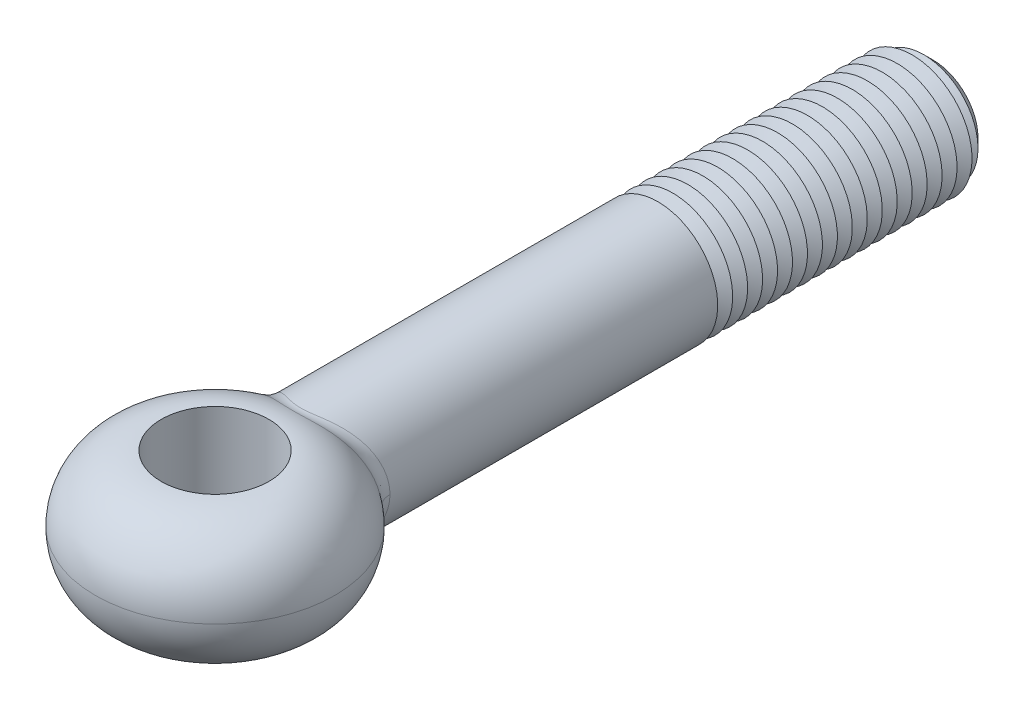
ISO-10303-21;
HEADER;
FILE_DESCRIPTION(('STEP AP214'),'2;1');
FILE_NAME('part.step','',(''),(''),'','','');
FILE_SCHEMA(('AUTOMOTIVE_DESIGN { 1 0 10303 214 1 1 1 1 }'));
ENDSEC;
DATA;
#1=APPLICATION_CONTEXT('core data for automotive mechanical design processes');
#2=APPLICATION_PROTOCOL_DEFINITION('international standard','automotive_design',2000,#1);
#3=PRODUCT_CONTEXT('',#1,'mechanical');
#4=PRODUCT('Part','Part','',(#3));
#5=PRODUCT_RELATED_PRODUCT_CATEGORY('part','',(#4));
#6=PRODUCT_DEFINITION_FORMATION('','',#4);
#7=PRODUCT_DEFINITION_CONTEXT('part definition',#1,'design');
#8=PRODUCT_DEFINITION('design','',#6,#7);
#9=PRODUCT_DEFINITION_SHAPE('','',#8);
#10=(LENGTH_UNIT() NAMED_UNIT(*) SI_UNIT(.MILLI.,.METRE.));
#11=(NAMED_UNIT(*) PLANE_ANGLE_UNIT() SI_UNIT($,.RADIAN.));
#12=(NAMED_UNIT(*) SI_UNIT($,.STERADIAN.) SOLID_ANGLE_UNIT());
#13=UNCERTAINTY_MEASURE_WITH_UNIT(LENGTH_MEASURE(1.E-05),#10,'distance_accuracy_value','');
#14=(GEOMETRIC_REPRESENTATION_CONTEXT(3) GLOBAL_UNCERTAINTY_ASSIGNED_CONTEXT((#13)) GLOBAL_UNIT_ASSIGNED_CONTEXT((#10,
#11,#12)) REPRESENTATION_CONTEXT('',''));
#15=CARTESIAN_POINT('',(0.,0.,0.));
#16=DIRECTION('',(0.,0.,1.));
#17=DIRECTION('',(1.,0.,0.));
#18=AXIS2_PLACEMENT_3D('',#15,#16,#17);
#19=CARTESIAN_POINT('',(0.,0.,-120.));
#20=DIRECTION('',(0.,0.,1.));
#21=DIRECTION('',(1.,0.,0.));
#22=AXIS2_PLACEMENT_3D('',#19,#20,#21);
#23=CYLINDRICAL_SURFACE('',#22,10.);
#24=CARTESIAN_POINT('',(0.,0.,-74.));
#25=DIRECTION('',(0.,0.,-1.));
#26=DIRECTION('',(-1.,0.,0.));
#27=AXIS2_PLACEMENT_3D('',#24,#25,#26);
#28=CIRCLE('',#27,10.);
#29=CARTESIAN_POINT('',(-10.,0.,-74.));
#30=VERTEX_POINT('',#29);
#31=EDGE_CURVE('E78',#30,#30,#28,.T.);
#32=ORIENTED_EDGE('',*,*,#31,.F.);
#33=EDGE_LOOP('',(#32));
#34=FACE_BOUND('',#33,.T.);
#35=CARTESIAN_POINT('',(9.43452897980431,-5.9855471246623,-15.5975544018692));
#36=CARTESIAN_POINT('',(8.34423805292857,-5.52525611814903,-16.6059320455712));
#37=CARTESIAN_POINT('',(8.11431624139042,-5.84447362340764,-18.1101473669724));
#38=CARTESIAN_POINT('',(9.60050520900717,-5.77068079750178,-15.6600678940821));
#39=CARTESIAN_POINT('',(8.48250308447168,-5.3158455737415,-16.6734523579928));
#40=CARTESIAN_POINT('',(8.26546699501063,-5.63467148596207,-18.2014690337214));
#41=CARTESIAN_POINT('',(9.7577841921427,-5.54896856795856,-15.7193267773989));
#42=CARTESIAN_POINT('',(8.61224377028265,-5.10213898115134,-16.7368596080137));
#43=CARTESIAN_POINT('',(8.40899835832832,-5.41818479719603,-18.2879579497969));
#44=CARTESIAN_POINT('',(10.053869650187,-5.09311935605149,-15.8308850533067));
#45=CARTESIAN_POINT('',(8.85513381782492,-4.66620933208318,-16.8556211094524));
#46=CARTESIAN_POINT('',(8.6796419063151,-4.9730795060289,-18.4506608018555));
#47=CARTESIAN_POINT('',(10.1926707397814,-4.85897877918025,-15.8831824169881));
#48=CARTESIAN_POINT('',(8.96815881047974,-4.44404031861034,-16.9109148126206));
#49=CARTESIAN_POINT('',(8.80674930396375,-4.74445739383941,-18.5268717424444));
#50=CARTESIAN_POINT('',(10.4506831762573,-4.37955751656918,-15.9803525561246));
#51=CARTESIAN_POINT('',(9.17718300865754,-3.99242395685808,-17.0131862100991));
#52=CARTESIAN_POINT('',(9.04332894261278,-4.27633562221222,-18.6683874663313));
#53=CARTESIAN_POINT('',(10.5698855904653,-4.13427181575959,-16.0252219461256));
#54=CARTESIAN_POINT('',(9.27305982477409,-3.76305815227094,-17.0601040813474));
#55=CARTESIAN_POINT('',(9.15279314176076,-4.03683106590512,-18.7336872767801));
#56=CARTESIAN_POINT('',(10.7875880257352,-3.634260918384,-16.1071213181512));
#57=CARTESIAN_POINT('',(9.44739138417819,-3.29841554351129,-17.1454161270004));
#58=CARTESIAN_POINT('',(9.35291302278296,-3.54860493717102,-18.8528181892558));
#59=CARTESIAN_POINT('',(10.8860907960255,-3.37953698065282,-16.1441523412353));
#60=CARTESIAN_POINT('',(9.52574461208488,-3.063249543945,-17.183760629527));
#61=CARTESIAN_POINT('',(9.4435712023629,-3.29988459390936,-18.906650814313));
#62=CARTESIAN_POINT('',(11.0586995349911,-2.87065864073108,-16.2090049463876));
#63=CARTESIAN_POINT('',(9.66255871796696,-2.5958661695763,-17.2507122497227));
#64=CARTESIAN_POINT('',(9.60255363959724,-2.80300001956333,-19.0008915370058));
#65=CARTESIAN_POINT('',(11.1334873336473,-2.61674859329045,-16.237084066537));
#66=CARTESIAN_POINT('',(9.72150133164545,-2.36390013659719,-17.2795551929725));
#67=CARTESIAN_POINT('',(9.67150157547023,-2.555074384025,-19.041675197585));
#68=CARTESIAN_POINT('',(11.2622086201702,-2.10328461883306,-16.2853899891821));
#69=CARTESIAN_POINT('',(9.82270778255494,-1.89657583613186,-17.3290774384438));
#70=CARTESIAN_POINT('',(9.79023230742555,-2.05371225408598,-19.1118184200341));
#71=CARTESIAN_POINT('',(11.3161352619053,-1.84372886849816,-16.3056142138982));
#72=CARTESIAN_POINT('',(9.8649025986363,-1.66135361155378,-17.349722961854));
#73=CARTESIAN_POINT('',(9.84000881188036,-1.80027397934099,-19.1411742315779));
#74=CARTESIAN_POINT('',(11.4025652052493,-1.32109132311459,-16.338018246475));
#75=CARTESIAN_POINT('',(9.93244623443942,-1.18887816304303,-17.3827703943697));
#76=CARTESIAN_POINT('',(9.91981122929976,-1.28995449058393,-19.1882016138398));
#77=CARTESIAN_POINT('',(11.435087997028,-1.05801295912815,-16.3502053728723));
#78=CARTESIAN_POINT('',(9.95776661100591,-0.951775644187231,-17.3951583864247));
#79=CARTESIAN_POINT('',(9.94985511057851,-1.0330766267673,-19.2058838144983));
#80=CARTESIAN_POINT('',(11.4784864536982,-0.529957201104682,-16.3664661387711));
#81=CARTESIAN_POINT('',(9.99155479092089,-0.476371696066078,-17.4116890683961));
#82=CARTESIAN_POINT('',(9.98994969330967,-0.517466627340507,-19.2294751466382));
#83=CARTESIAN_POINT('',(11.4893618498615,-0.264979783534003,-16.3705396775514));
#84=CARTESIAN_POINT('',(10.0000000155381,-0.238226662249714,-17.415820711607));
#85=CARTESIAN_POINT('',(10.0000001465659,-0.258734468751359,-19.2353841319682));
#86=CARTESIAN_POINT('',(11.4893615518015,0.269629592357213,-16.3705395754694));
#87=CARTESIAN_POINT('',(9.99999998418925,0.242407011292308,-17.4158206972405));
#88=CARTESIAN_POINT('',(9.99999985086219,0.263274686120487,-19.2353839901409));
#89=CARTESIAN_POINT('',(11.4781008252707,0.53926163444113,-16.3663217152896));
#90=CARTESIAN_POINT('',(9.9912557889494,0.48473250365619,-17.4115427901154));
#91=CARTESIAN_POINT('',(9.98959327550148,0.526551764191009,-19.2292656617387));
#92=CARTESIAN_POINT('',(11.4331665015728,1.07653539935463,-16.3494853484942));
#93=CARTESIAN_POINT('',(9.9562701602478,0.968459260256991,-17.3944262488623));
#94=CARTESIAN_POINT('',(9.94808005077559,1.05116251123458,-19.2048391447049));
#95=CARTESIAN_POINT('',(11.3994921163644,1.3441770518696,-16.3368665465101));
#96=CARTESIAN_POINT('',(9.9300520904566,1.20969577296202,-17.3815990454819));
#97=CARTESIAN_POINT('',(9.91697267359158,1.31249611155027,-19.1865305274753));
#98=CARTESIAN_POINT('',(11.3100467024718,1.8755498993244,-16.3033310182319));
#99=CARTESIAN_POINT('',(9.86013961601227,1.69016143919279,-17.347392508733));
#100=CARTESIAN_POINT('',(9.83438836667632,1.83134501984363,-19.1378602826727));
#101=CARTESIAN_POINT('',(11.254271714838,2.13928038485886,-16.2824128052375));
#102=CARTESIAN_POINT('',(9.81648899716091,1.9292337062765,-17.3260346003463));
#103=CARTESIAN_POINT('',(9.78290778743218,2.08885963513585,-19.1074964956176));
#104=CARTESIAN_POINT('',(11.1211278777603,2.66099186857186,-16.2324443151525));
#105=CARTESIAN_POINT('',(9.71176614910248,2.40426315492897,-17.2747914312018));
#106=CARTESIAN_POINT('',(9.66010560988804,2.59827488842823,-19.0349366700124));
#107=CARTESIAN_POINT('',(11.043751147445,2.91897073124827,-16.2033910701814));
#108=CARTESIAN_POINT('',(9.65075538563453,2.64007593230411,-17.2449362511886));
#109=CARTESIAN_POINT('',(9.58877677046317,2.85017344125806,-18.9927363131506));
#110=CARTESIAN_POINT('',(10.8683072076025,3.42676440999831,-16.1374676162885));
#111=CARTESIAN_POINT('',(9.51159962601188,3.10681781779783,-17.1768385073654));
#112=CARTESIAN_POINT('',(9.42720199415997,3.34599891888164,-18.8969337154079));
#113=CARTESIAN_POINT('',(10.7702839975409,3.67659530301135,-16.1006140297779));
#114=CARTESIAN_POINT('',(9.43357674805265,3.33762998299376,-17.1386557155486));
#115=CARTESIAN_POINT('',(9.33699628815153,3.58994154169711,-18.8433557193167));
#116=CARTESIAN_POINT('',(10.5542593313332,4.1671394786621,-16.0193404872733));
#117=CARTESIAN_POINT('',(9.26049301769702,3.79376863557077,-17.0539542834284));
#118=CARTESIAN_POINT('',(9.13844085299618,4.06892407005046,-18.7251285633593));
#119=CARTESIAN_POINT('',(10.4362490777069,4.40784868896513,-15.9749171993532));
#120=CARTESIAN_POINT('',(9.1655238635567,4.01898948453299,-17.0074805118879));
#121=CARTESIAN_POINT('',(9.0300831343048,4.30395999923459,-18.6604745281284));
#122=CARTESIAN_POINT('',(10.1813021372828,4.87847620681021,-15.8789002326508));
#123=CARTESIAN_POINT('',(8.95890120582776,4.4625267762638,-16.9063865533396));
#124=CARTESIAN_POINT('',(8.7963369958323,4.76349528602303,-18.5206320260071));
#125=CARTESIAN_POINT('',(10.0443720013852,5.10839821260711,-15.8273090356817));
#126=CARTESIAN_POINT('',(8.84736248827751,4.68076606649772,-16.8518224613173));
#127=CARTESIAN_POINT('',(8.67095447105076,4.98799825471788,-18.4454472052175));
#128=CARTESIAN_POINT('',(9.75260585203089,5.55625016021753,-15.7173729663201));
#129=CARTESIAN_POINT('',(8.60795982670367,5.10918973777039,-16.7347636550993));
#130=CARTESIAN_POINT('',(8.40427110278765,5.42529476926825,-18.2851064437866));
#131=CARTESIAN_POINT('',(9.59776873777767,5.77417936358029,-15.6590276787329));
#132=CARTESIAN_POINT('',(8.48020856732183,5.31932036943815,-16.6723238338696));
#133=CARTESIAN_POINT('',(8.26296928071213,5.63808759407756,-18.1999498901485));
#134=CARTESIAN_POINT('',(9.26615260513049,6.20356593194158,-15.534146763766));
#135=CARTESIAN_POINT('',(8.20461231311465,5.73672793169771,-16.5377554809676));
#136=CARTESIAN_POINT('',(7.96098558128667,6.0573539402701,-18.0175190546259));
#137=CARTESIAN_POINT('',(9.08883645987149,6.4146038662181,-15.4674111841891));
#138=CARTESIAN_POINT('',(8.05636478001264,5.94370774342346,-16.4654337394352));
#139=CARTESIAN_POINT('',(7.7998337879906,6.26341791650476,-17.9199477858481));
#140=CARTESIAN_POINT('',(8.71758429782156,6.82162435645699,-15.3279355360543));
#141=CARTESIAN_POINT('',(7.74367757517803,6.34640999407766,-16.3131822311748));
#142=CARTESIAN_POINT('',(7.4633054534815,6.66084533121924,-17.7158184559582));
#143=CARTESIAN_POINT('',(8.52365283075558,7.01761100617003,-15.2551971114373));
#144=CARTESIAN_POINT('',(7.57936139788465,6.54213539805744,-16.2333112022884));
#145=CARTESIAN_POINT('',(7.28793280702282,6.85221276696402,-17.6092628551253));
#146=CARTESIAN_POINT('',(8.12016404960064,7.39386400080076,-15.1043942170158));
#147=CARTESIAN_POINT('',(7.23510051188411,6.92124197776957,-16.0665300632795));
#148=CARTESIAN_POINT('',(6.92417984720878,7.21959784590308,-17.3881065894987));
#149=CARTESIAN_POINT('',(7.91059883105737,7.57412229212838,-15.0263270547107));
#150=CARTESIAN_POINT('',(7.05525523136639,7.10464535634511,-15.9796657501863));
#151=CARTESIAN_POINT('',(6.735792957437,7.39560762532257,-17.2735018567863));
#152=CARTESIAN_POINT('',(7.47700680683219,7.91811936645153,-14.8657958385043));
#153=CARTESIAN_POINT('',(6.6807721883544,7.45778289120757,-15.7997990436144));
#154=CARTESIAN_POINT('',(6.34742931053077,7.73149702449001,-17.037563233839));
#155=CARTESIAN_POINT('',(7.2529835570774,8.08186218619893,-14.7833328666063));
#156=CARTESIAN_POINT('',(6.48622962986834,7.62757357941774,-15.7068372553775));
#157=CARTESIAN_POINT('',(6.14745540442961,7.89138058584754,-16.9162309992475));
#158=CARTESIAN_POINT('',(6.77134336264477,8.40579390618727,-14.6078016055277));
#159=CARTESIAN_POINT('',(6.06569707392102,7.96638984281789,-15.507686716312));
#160=CARTESIAN_POINT('',(5.71933908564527,8.20767755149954,-16.6576501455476));
#161=CARTESIAN_POINT('',(6.512495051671,8.56446092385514,-14.5144317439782));
#162=CARTESIAN_POINT('',(5.83842837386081,8.13426205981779,-15.4010317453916));
#163=CARTESIAN_POINT('',(5.49025421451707,8.36260494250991,-16.5199309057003));
#164=CARTESIAN_POINT('',(5.97928293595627,8.8614010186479,-14.3254807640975));
#165=CARTESIAN_POINT('',(5.36786976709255,8.45139804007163,-15.1837485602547));
#166=CARTESIAN_POINT('',(5.02091237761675,8.65254644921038,-16.240859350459));
#167=CARTESIAN_POINT('',(5.70491599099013,8.99966994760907,-14.2298992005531));
#168=CARTESIAN_POINT('',(5.12463036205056,8.60077991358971,-15.07312594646));
#169=CARTESIAN_POINT('',(4.78065315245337,8.78755651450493,-16.0995063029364));
#170=CARTESIAN_POINT('',(5.1405320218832,9.25561084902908,-14.0388519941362));
#171=CARTESIAN_POINT('',(4.62232310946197,8.87981959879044,-14.8506895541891));
#172=CARTESIAN_POINT('',(4.28955099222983,9.03746513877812,-15.8166039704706));
#173=CARTESIAN_POINT('',(4.85049666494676,9.37325797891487,-13.9433866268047));
#174=CARTESIAN_POINT('',(4.36324512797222,9.00959558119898,-14.7388483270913));
#175=CARTESIAN_POINT('',(4.03869573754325,9.15233944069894,-15.6750546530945));
#176=CARTESIAN_POINT('',(4.25463017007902,9.58739445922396,-13.7561899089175));
#177=CARTESIAN_POINT('',(3.82959253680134,9.24785728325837,-14.5184109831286));
#178=CARTESIAN_POINT('',(3.52704154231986,9.36142893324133,-15.3971561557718));
#179=CARTESIAN_POINT('',(3.94880498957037,9.68389171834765,-13.6644571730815));
#180=CARTESIAN_POINT('',(3.55497971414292,9.35650417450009,-14.4097498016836));
#181=CARTESIAN_POINT('',(3.26624636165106,9.45565184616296,-15.2608050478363));
#182=CARTESIAN_POINT('',(3.43589915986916,9.82367399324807,-13.5221298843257));
#183=CARTESIAN_POINT('',(3.09349956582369,9.5152325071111,-14.2403576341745));
#184=CARTESIAN_POINT('',(2.83229257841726,9.59213958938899,-15.0490317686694));
#185=CARTESIAN_POINT('',(3.23387124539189,9.87347664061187,-13.4688140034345));
#186=CARTESIAN_POINT('',(2.91169341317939,9.57213232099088,-14.1767435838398));
#187=CARTESIAN_POINT('',(2.66218071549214,9.64076843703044,-14.9696450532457));
#188=CARTESIAN_POINT('',(2.82276410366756,9.96416789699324,-13.3676828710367));
#189=CARTESIAN_POINT('',(2.54161663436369,9.67624211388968,-14.05582083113));
#190=CARTESIAN_POINT('',(2.31773787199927,9.72932218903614,-14.8189766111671));
#191=CARTESIAN_POINT('',(2.61368516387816,10.0050568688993,-13.319867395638));
#192=CARTESIAN_POINT('',(2.35330062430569,9.72349213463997,-13.9984773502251));
#193=CARTESIAN_POINT('',(2.14340706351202,9.76924744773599,-14.7476945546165));
#194=CARTESIAN_POINT('',(2.18934081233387,10.0774084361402,-13.232234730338));
#195=CARTESIAN_POINT('',(1.97112322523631,9.80743490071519,-13.8932151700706));
#196=CARTESIAN_POINT('',(1.79125705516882,9.83989375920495,-14.6169946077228));
#197=CARTESIAN_POINT('',(1.97410477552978,10.1089095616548,-13.1923850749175));
#198=CARTESIAN_POINT('',(1.77722521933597,9.84420740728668,-13.8452196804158));
#199=CARTESIAN_POINT('',(1.61345539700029,9.87065243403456,-14.5575285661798));
#200=CARTESIAN_POINT('',(1.53721646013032,10.1622357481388,-13.1231108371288));
#201=CARTESIAN_POINT('',(1.38378639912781,9.90663622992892,-13.7617076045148));
#202=CARTESIAN_POINT('',(1.25400645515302,9.92272177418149,-14.4541203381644));
#203=CARTESIAN_POINT('',(1.31556607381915,10.1840636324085,-13.0936832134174));
#204=CARTESIAN_POINT('',(1.18416025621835,9.93232760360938,-13.7261484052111));
#205=CARTESIAN_POINT('',(1.07236030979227,9.94403519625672,-14.4101736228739));
#206=CARTESIAN_POINT('',(0.901086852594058,10.2150338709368,-13.0512803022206));
#207=CARTESIAN_POINT('',(0.811010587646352,9.96883413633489,-13.6748948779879));
#208=CARTESIAN_POINT('',(0.733646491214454,9.97427549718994,-14.3468387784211));
#209=CARTESIAN_POINT('',(0.708925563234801,10.225588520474,-13.0364985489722));
#210=CARTESIAN_POINT('',(0.638016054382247,9.9813164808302,-13.6570022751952));
#211=CARTESIAN_POINT('',(0.576981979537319,9.98458138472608,-14.3247545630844));
#212=CARTESIAN_POINT('',(0.32280480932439,10.239115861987,-13.0174775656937));
#213=CARTESIAN_POINT('',(0.290519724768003,9.99731568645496,-13.6339840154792));
#214=CARTESIAN_POINT('',(0.2625642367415,9.99778989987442,-14.2963356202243));
#215=CARTESIAN_POINT('',(0.128845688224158,10.2420899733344,-13.0132363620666));
#216=CARTESIAN_POINT('',(0.11594169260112,10.0008413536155,-13.6288457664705));
#217=CARTESIAN_POINT('',(0.104811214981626,10.0006939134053,-14.2899979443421));
#218=CARTESIAN_POINT('',(-0.258903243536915,10.2403820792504,-13.0156565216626));
#219=CARTESIAN_POINT('',(-0.232987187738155,9.99881931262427,-13.6317755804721));
#220=CARTESIAN_POINT('',(-0.210605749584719,9.9990262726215,-14.2936141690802));
#221=CARTESIAN_POINT('',(-0.452692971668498,10.235697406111,-13.0223216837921));
#222=CARTESIAN_POINT('',(-0.407417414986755,9.99326752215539,-13.6398495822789));
#223=CARTESIAN_POINT('',(-0.368269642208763,9.99445201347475,-14.3035737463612));
#224=CARTESIAN_POINT('',(-0.838056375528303,10.2187856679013,-13.0459971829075));
#225=CARTESIAN_POINT('',(-0.754249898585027,9.97327695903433,-13.6684946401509));
#226=CARTESIAN_POINT('',(-0.682255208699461,9.97793886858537,-14.3389452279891));
#227=CARTESIAN_POINT('',(-1.02962955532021,10.2065569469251,-13.0630097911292));
#228=CARTESIAN_POINT('',(-0.926726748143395,9.95882742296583,-13.6890809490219));
#229=CARTESIAN_POINT('',(-0.838576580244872,9.96599836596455,-14.3643605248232));
#230=CARTESIAN_POINT('',(-1.47709063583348,10.1691133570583,-13.113849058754));
#231=CARTESIAN_POINT('',(-1.32963595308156,9.91473356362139,-13.7505127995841));
#232=CARTESIAN_POINT('',(-1.20464773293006,9.92943728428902,-14.4402891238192));
#233=CARTESIAN_POINT('',(-1.73139053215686,10.140813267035,-13.151518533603));
#234=CARTESIAN_POINT('',(-1.5587089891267,9.88147336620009,-13.7960088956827));
#235=CARTESIAN_POINT('',(-1.41344202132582,9.90180420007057,-14.4965358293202));
#236=CARTESIAN_POINT('',(-2.23104582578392,10.0715291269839,-13.239514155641));
#237=CARTESIAN_POINT('',(-2.00870802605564,9.80059822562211,-13.9019685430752));
#238=CARTESIAN_POINT('',(-1.8256925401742,9.83415301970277,-14.6278545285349));
#239=CARTESIAN_POINT('',(-2.47639580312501,10.0305375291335,-13.2898478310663));
#240=CARTESIAN_POINT('',(-2.22975057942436,9.75292233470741,-13.9625022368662));
#241=CARTESIAN_POINT('',(-2.02914551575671,9.79412755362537,-14.7029377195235));
#242=CARTESIAN_POINT('',(-2.9588911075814,9.93629512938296,-13.3995119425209));
#243=CARTESIAN_POINT('',(-2.66423463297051,9.64414242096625,-14.0939421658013));
#244=CARTESIAN_POINT('',(-2.43144462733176,9.70210635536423,-14.8664118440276));
#245=CARTESIAN_POINT('',(-3.19598869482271,9.88298340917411,-13.4588865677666));
#246=CARTESIAN_POINT('',(-2.87771399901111,9.58291258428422,-14.1649560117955));
#247=CARTESIAN_POINT('',(-2.63026227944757,9.65005114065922,-14.9548681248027));
#248=CARTESIAN_POINT('',(-3.66094239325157,9.76467554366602,-13.5832721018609));
#249=CARTESIAN_POINT('',(-3.29595689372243,9.44812095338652,-14.3131723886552));
#250=CARTESIAN_POINT('',(-3.02232846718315,9.53453167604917,-15.1400304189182));
#251=CARTESIAN_POINT('',(-3.88879902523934,9.69968005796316,-13.648282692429));
#252=CARTESIAN_POINT('',(-3.50077505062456,9.37449775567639,-14.3904211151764));
#253=CARTESIAN_POINT('',(-3.21557731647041,9.47106807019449,-15.2367359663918));
#254=CARTESIAN_POINT('',(-4.44320756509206,9.52429263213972,-13.813552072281));
#255=CARTESIAN_POINT('',(-3.99876446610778,9.17730333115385,-14.5861617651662));
#256=CARTESIAN_POINT('',(-3.68829661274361,9.29981435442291,-15.4823644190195));
#257=CARTESIAN_POINT('',(-4.76458779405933,9.40709204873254,-13.9157408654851));
#258=CARTESIAN_POINT('',(-4.28661274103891,9.04678997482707,-14.7065021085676));
#259=CARTESIAN_POINT('',(-3.96458981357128,9.18537607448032,-15.6340547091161));
#260=CARTESIAN_POINT('',(-5.38930158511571,9.14816852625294,-14.12183146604));
#261=CARTESIAN_POINT('',(-4.84418122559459,8.76215134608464,-14.9475940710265));
#262=CARTESIAN_POINT('',(-4.50539064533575,8.93255512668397,-15.9395491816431));
#263=CARTESIAN_POINT('',(-5.69262932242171,9.00643772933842,-14.2257338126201));
#264=CARTESIAN_POINT('',(-5.11390788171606,8.60783261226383,-15.0683962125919));
#265=CARTESIAN_POINT('',(-4.76989446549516,8.79416478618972,-16.0933540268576));
#266=CARTESIAN_POINT('',(-6.2807517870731,8.69911934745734,-14.4315862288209));
#267=CARTESIAN_POINT('',(-5.63445612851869,8.27743175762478,-15.306083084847));
#268=CARTESIAN_POINT('',(-5.28576367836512,8.49408959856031,-16.3976428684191));
#269=CARTESIAN_POINT('',(-6.56557804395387,8.53357398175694,-14.5335393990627));
#270=CARTESIAN_POINT('',(-5.8852609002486,8.1012237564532,-15.4229792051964));
#271=CARTESIAN_POINT('',(-5.53715127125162,8.33244597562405,-16.5481322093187));
#272=CARTESIAN_POINT('',(-7.11655081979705,8.17895147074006,-14.7332405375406));
#273=CARTESIAN_POINT('',(-6.36771692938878,7.72839278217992,-15.6503344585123));
#274=CARTESIAN_POINT('',(-6.02582390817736,7.98618157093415,-16.8424988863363));
#275=CARTESIAN_POINT('',(-7.38269879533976,7.98987616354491,-14.8309888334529));
#276=CARTESIAN_POINT('',(-6.5992657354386,7.53164079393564,-15.7607606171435));
#277=CARTESIAN_POINT('',(-6.26311005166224,7.80156258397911,-16.9863767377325));
#278=CARTESIAN_POINT('',(-7.89448355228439,7.58937034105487,-15.0202729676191));
#279=CARTESIAN_POINT('',(-7.04171419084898,7.11984304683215,-15.9730734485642));
#280=CARTESIAN_POINT('',(-6.72123688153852,7.41049629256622,-17.2646275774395));
#281=CARTESIAN_POINT('',(-8.14016591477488,7.37799201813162,-15.1118225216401));
#282=CARTESIAN_POINT('',(-7.25251801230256,6.9047481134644,-16.0749191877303));
#283=CARTESIAN_POINT('',(-6.9421139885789,7.20409995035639,-17.3990215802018));
#284=CARTESIAN_POINT('',(-8.61006535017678,6.93354564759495,-15.2875527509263));
#285=CARTESIAN_POINT('',(-7.65299610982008,6.45765789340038,-16.2690458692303));
#286=CARTESIAN_POINT('',(-7.36595828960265,6.77012874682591,-17.656686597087));
#287=CARTESIAN_POINT('',(-8.83428130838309,6.70047647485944,-15.371733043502));
#288=CARTESIAN_POINT('',(-7.8424935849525,6.22562042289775,-16.361245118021));
#289=CARTESIAN_POINT('',(-7.56892455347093,6.5425527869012,-17.7799570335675));
#290=CARTESIAN_POINT('',(-9.25940881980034,6.21400101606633,-15.5315844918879));
#291=CARTESIAN_POINT('',(-8.19932512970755,5.74654163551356,-16.5351494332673));
#292=CARTESIAN_POINT('',(-7.95478255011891,6.06754307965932,-18.0137900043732));
#293=CARTESIAN_POINT('',(-9.46031551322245,5.96059050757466,-15.6072538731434));
#294=CARTESIAN_POINT('',(-8.36645913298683,5.49950956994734,-16.6167587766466));
#295=CARTESIAN_POINT('',(-8.13767009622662,5.82010520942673,-18.1243498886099));
#296=CARTESIAN_POINT('',(-9.83679553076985,5.43527222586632,-15.7490893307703));
#297=CARTESIAN_POINT('',(-8.67756159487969,4.99254792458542,-16.7687780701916));
#298=CARTESIAN_POINT('',(-8.48110805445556,5.3071681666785,-18.3313946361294));
#299=CARTESIAN_POINT('',(-10.0123724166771,5.16336706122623,-15.8152567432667));
#300=CARTESIAN_POINT('',(-8.82133112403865,4.7326884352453,-16.8390914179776));
#301=CARTESIAN_POINT('',(-8.64166160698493,5.04167154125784,-18.4278814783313));
#302=CARTESIAN_POINT('',(-10.3212633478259,4.62921939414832,-15.9316192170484));
#303=CARTESIAN_POINT('',(-9.07266333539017,4.22688436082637,-16.9620419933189));
#304=CARTESIAN_POINT('',(-8.92458732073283,4.52011321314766,-18.5974339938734));
#305=CARTESIAN_POINT('',(-10.4569869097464,4.36841996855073,-15.9827265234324));
#306=CARTESIAN_POINT('',(-9.18224116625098,3.98188546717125,-17.0156619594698));
#307=CARTESIAN_POINT('',(-9.04911967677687,4.26546057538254,-18.671841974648));
#308=CARTESIAN_POINT('',(-10.7046952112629,3.83526953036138,-16.0759469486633));
#309=CARTESIAN_POINT('',(-9.3812489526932,3.48456856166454,-17.1130474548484));
#310=CARTESIAN_POINT('',(-9.27666839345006,3.74487597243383,-18.8074855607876));
#311=CARTESIAN_POINT('',(-10.8166824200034,3.5629197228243,-16.1180610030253));
#312=CARTESIAN_POINT('',(-9.47054625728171,3.23238025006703,-17.156748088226));
#313=CARTESIAN_POINT('',(-9.37968699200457,3.47894518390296,-18.8687225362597));
#314=CARTESIAN_POINT('',(-11.0155728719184,3.00929549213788,-16.1928087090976));
#315=CARTESIAN_POINT('',(-9.62851946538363,2.72270494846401,-17.2340550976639));
#316=CARTESIAN_POINT('',(-9.56280689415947,2.93836933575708,-18.977363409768));
#317=CARTESIAN_POINT('',(-11.1025230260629,2.72803886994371,-16.2254600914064));
#318=CARTESIAN_POINT('',(-9.69711918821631,2.46538774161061,-17.2676241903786));
#319=CARTESIAN_POINT('',(-9.64295105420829,2.66374165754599,-19.0247931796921));
#320=CARTESIAN_POINT('',(-11.2506400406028,2.15853827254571,-16.2810514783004));
#321=CARTESIAN_POINT('',(-9.81366746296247,1.94660748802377,-17.324654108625));
#322=CARTESIAN_POINT('',(-9.77955371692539,2.10766363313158,-19.1055210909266));
#323=CARTESIAN_POINT('',(-11.3118190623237,1.87029766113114,-16.3039960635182));
#324=CARTESIAN_POINT('',(-9.86153588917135,1.68533214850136,-17.3480757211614));
#325=CARTESIAN_POINT('',(-9.83602339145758,1.82621657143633,-19.1388258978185));
#326=CARTESIAN_POINT('',(-11.4028551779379,1.31891290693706,-16.3381269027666));
#327=CARTESIAN_POINT('',(-9.93267162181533,1.18691316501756,-17.3828806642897));
#328=CARTESIAN_POINT('',(-9.92007913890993,1.28782741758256,-19.1883592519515));
#329=CARTESIAN_POINT('',(-11.4352749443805,1.05621556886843,-16.350275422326));
#330=CARTESIAN_POINT('',(-9.95791206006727,0.95015650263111,-17.3952295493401));
#331=CARTESIAN_POINT('',(-9.95002783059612,1.03132159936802,-19.2059854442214));
#332=CARTESIAN_POINT('',(-11.4785246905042,0.529012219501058,-16.3664804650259));
#333=CARTESIAN_POINT('',(-9.99158458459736,0.475522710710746,-17.4117036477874));
#334=CARTESIAN_POINT('',(-9.9899850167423,0.516543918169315,-19.2294959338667));
#335=CARTESIAN_POINT('',(-11.4893616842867,0.264506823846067,-16.3705396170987));
#336=CARTESIAN_POINT('',(-9.99999992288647,0.23780149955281,-17.4158206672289));
#337=CARTESIAN_POINT('',(-9.99999998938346,0.258272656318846,-19.2353840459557));
#338=CARTESIAN_POINT('',(-11.4893617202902,-0.269274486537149,-16.3705396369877));
#339=CARTESIAN_POINT('',(-10.0000000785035,-0.242087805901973,-17.4158207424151));
#340=CARTESIAN_POINT('',(-10.0000000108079,-0.262927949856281,-19.2353840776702));
#341=CARTESIAN_POINT('',(-11.4781305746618,-0.538550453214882,-16.3663328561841));
#342=CARTESIAN_POINT('',(-9.99127884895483,-0.484093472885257,-17.41155407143));
#343=CARTESIAN_POINT('',(-9.98962077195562,-0.525857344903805,-19.2292818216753));
#344=CARTESIAN_POINT('',(-11.4333067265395,-1.07521295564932,-16.3495378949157));
#345=CARTESIAN_POINT('',(-9.95637938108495,-0.967267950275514,-17.3944796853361));
#346=CARTESIAN_POINT('',(-9.94820958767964,-1.04987123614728,-19.2049153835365));
#347=CARTESIAN_POINT('',(-11.3997055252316,-1.34259873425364,-16.3369465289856));
#348=CARTESIAN_POINT('',(-9.93021837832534,-1.2082722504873,-17.3816804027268));
#349=CARTESIAN_POINT('',(-9.91716979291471,-1.31095499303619,-19.1866465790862));
#350=CARTESIAN_POINT('',(-11.310346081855,-1.87408052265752,-16.303443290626));
#351=CARTESIAN_POINT('',(-9.86037403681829,-1.68882951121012,-17.3475072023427));
#352=CARTESIAN_POINT('',(-9.83466469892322,-1.82991027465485,-19.1380232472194));
#353=CARTESIAN_POINT('',(-11.2545333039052,-2.13816677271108,-16.2825109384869));
#354=CARTESIAN_POINT('',(-9.81669446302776,-1.92822118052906,-17.3261351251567));
#355=CARTESIAN_POINT('',(-9.78314912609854,-2.0877722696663,-19.1076389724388));
#356=CARTESIAN_POINT('',(-11.1212790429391,-2.66048788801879,-16.2325010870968));
#357=CARTESIAN_POINT('',(-9.71188550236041,-2.40380188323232,-17.2748498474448));
#358=CARTESIAN_POINT('',(-9.66024496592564,-2.59778278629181,-19.0350191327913));
#359=CARTESIAN_POINT('',(-11.0438369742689,-2.91872259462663,-16.2034233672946));
#360=CARTESIAN_POINT('',(-9.65082369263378,-2.63984697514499,-17.2449697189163));
#361=CARTESIAN_POINT('',(-9.58885584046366,-2.84993115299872,-18.9927832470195));
#362=CARTESIAN_POINT('',(-10.8681953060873,-3.42708801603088,-16.1374255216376));
#363=CARTESIAN_POINT('',(-9.51151104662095,-3.10711477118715,-17.1767951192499));
#364=CARTESIAN_POINT('',(-9.42709891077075,-3.34631489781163,-18.8968725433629));
#365=CARTESIAN_POINT('',(-10.7700335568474,-3.67723256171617,-16.1005196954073));
#366=CARTESIAN_POINT('',(-9.43337750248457,-3.33821895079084,-17.1385580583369));
#367=CARTESIAN_POINT('',(-9.33676571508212,-3.59056378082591,-18.8432185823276));
#368=CARTESIAN_POINT('',(-10.5537166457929,-4.16830295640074,-16.0191364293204));
#369=CARTESIAN_POINT('',(-9.26005752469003,-3.79485238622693,-17.0537413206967));
#370=CARTESIAN_POINT('',(-9.13794243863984,-4.07006012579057,-18.7248316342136));
#371=CARTESIAN_POINT('',(-10.4355590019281,-4.4092276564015,-15.9746580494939));
#372=CARTESIAN_POINT('',(-9.16496856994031,-4.02027727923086,-17.0072093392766));
#373=CARTESIAN_POINT('',(-9.02945010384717,-4.30530646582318,-18.6600972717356));
#374=CARTESIAN_POINT('',(-10.1805249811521,-4.87980527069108,-15.8786068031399));
#375=CARTESIAN_POINT('',(-8.9582676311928,-4.46379094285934,-16.9060760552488));
#376=CARTESIAN_POINT('',(-8.79562481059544,-4.76479302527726,-18.5202044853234));
#377=CARTESIAN_POINT('',(-10.0436912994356,-5.10948231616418,-15.8270501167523));
#378=CARTESIAN_POINT('',(-8.84680285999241,-4.68181416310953,-16.8515466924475));
#379=CARTESIAN_POINT('',(-8.67033027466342,-4.98905680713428,-18.4450698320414));
#380=CARTESIAN_POINT('',(-9.75220852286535,-5.55682061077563,-15.7172256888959));
#381=CARTESIAN_POINT('',(-8.60763391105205,-5.10972638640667,-16.7346064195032));
#382=CARTESIAN_POINT('',(-8.40390994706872,-5.42585177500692,-18.2848913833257));
#383=CARTESIAN_POINT('',(-9.59756440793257,-5.77448519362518,-15.6589598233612));
#384=CARTESIAN_POINT('',(-8.48004754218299,-5.31956459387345,-16.672252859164));
#385=CARTESIAN_POINT('',(-8.2627885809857,-5.63838621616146,-18.1998503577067));
#386=CARTESIAN_POINT('',(-9.43452897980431,-5.9855471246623,-15.5975544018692));
#387=CARTESIAN_POINT('',(-8.34423805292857,-5.52525611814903,-16.6059320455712));
#388=CARTESIAN_POINT('',(-8.11431624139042,-5.84447362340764,-18.1101473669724));
#389=(BOUNDED_SURFACE() B_SPLINE_SURFACE(3,2,((#35,#36,#37),(#38,#39,#40),(#41,#42,#43),(#44,
#45,#46),(#47,#48,#49),(#50,#51,#52),(#53,#54,#55),(#56,#57,#58),(#59,#60,#61),(#62,#63,#64),
(#65,#66,#67),(#68,#69,#70),(#71,#72,#73),(#74,#75,#76),(#77,#78,#79),(#80,#81,#82),(#83,#84,
#85),(#86,#87,#88),(#89,#90,#91),(#92,#93,#94),(#95,#96,#97),(#98,#99,#100),(#101,#102,#103),
(#104,#105,#106),(#107,#108,#109),(#110,#111,#112),(#113,#114,#115),(#116,#117,#118),(#119,#120,
#121),(#122,#123,#124),(#125,#126,#127),(#128,#129,#130),(#131,#132,#133),(#134,#135,#136),
(#137,#138,#139),(#140,#141,#142),(#143,#144,#145),(#146,#147,#148),(#149,#150,#151),(#152,#153,
#154),(#155,#156,#157),(#158,#159,#160),(#161,#162,#163),(#164,#165,#166),(#167,#168,#169),
(#170,#171,#172),(#173,#174,#175),(#176,#177,#178),(#179,#180,#181),(#182,#183,#184),(#185,#186,
#187),(#188,#189,#190),(#191,#192,#193),(#194,#195,#196),(#197,#198,#199),(#200,#201,#202),
(#203,#204,#205),(#206,#207,#208),(#209,#210,#211),(#212,#213,#214),(#215,#216,#217),(#218,#219,
#220),(#221,#222,#223),(#224,#225,#226),(#227,#228,#229),(#230,#231,#232),(#233,#234,#235),
(#236,#237,#238),(#239,#240,#241),(#242,#243,#244),(#245,#246,#247),(#248,#249,#250),(#251,#252,
#253),(#254,#255,#256),(#257,#258,#259),(#260,#261,#262),(#263,#264,#265),(#266,#267,#268),
(#269,#270,#271),(#272,#273,#274),(#275,#276,#277),(#278,#279,#280),(#281,#282,#283),(#284,#285,
#286),(#287,#288,#289),(#290,#291,#292),(#293,#294,#295),(#296,#297,#298),(#299,#300,#301),
(#302,#303,#304),(#305,#306,#307),(#308,#309,#310),(#311,#312,#313),(#314,#315,#316),(#317,#318,
#319),(#320,#321,#322),(#323,#324,#325),(#326,#327,#328),(#329,#330,#331),(#332,#333,#334),
(#335,#336,#337),(#338,#339,#340),(#341,#342,#343),(#344,#345,#346),(#347,#348,#349),(#350,#351,
#352),(#353,#354,#355),(#356,#357,#358),(#359,#360,#361),(#362,#363,#364),(#365,#366,#367),
(#368,#369,#370),(#371,#372,#373),(#374,#375,#376),(#377,#378,#379),(#380,#381,#382),(#383,#384,
#385),(#386,#387,#388)),.UNSPECIFIED.,.F.,.F.,.F.) B_SPLINE_SURFACE_WITH_KNOTS((4,2,2,2,2,2,2,2,
2,2,2,2,2,2,2,2,2,2,2,2,2,2,2,2,2,2,2,2,2,2,2,2,2,2,2,2,2,2,2,2,2,2,2,2,2,2,2,2,2,2,2,2,2,2,2,2,
2,2,4),(3,3),(0.,1.08226690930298,2.16484855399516,3.24792225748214,4.33085202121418,
5.37900830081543,6.42750826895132,7.47505215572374,8.52260904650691,9.58854824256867,
10.6545249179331,11.7206926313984,12.7872498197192,13.8515566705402,14.9163332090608,
15.9807419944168,17.0452162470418,18.1431859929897,19.2408560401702,20.339084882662,
21.4370446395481,22.6296089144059,23.8224153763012,25.0166490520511,26.2104353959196,
26.9651479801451,27.7198298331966,28.4713702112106,29.2226910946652,29.861241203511,
30.4996717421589,31.1383247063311,31.77711790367,32.6451230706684,33.5136454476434,
34.3865578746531,35.2594210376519,36.5516017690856,37.8441971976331,39.1345286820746,
40.4247594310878,41.7120351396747,42.999377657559,44.2869880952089,45.5744172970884,
46.7424308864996,47.9103229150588,49.0760122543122,50.2411508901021,51.2871766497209,
52.3328624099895,53.3973963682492,54.4623349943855,55.5299046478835,56.597503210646,
57.6631681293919,58.7289654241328,59.7923657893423,60.8554695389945),(0.,1.),
.UNSPECIFIED.) GEOMETRIC_REPRESENTATION_ITEM() RATIONAL_B_SPLINE_SURFACE(((1.,0.913883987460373,
1.),(1.,0.911846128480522,1.),(1.,0.909886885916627,1.),(1.,0.906156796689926,1.),(1.,
0.904386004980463,1.),(1.,0.901064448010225,1.),(1.,0.899513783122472,1.),(1.,0.896661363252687,
1.),(1.,0.895359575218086,1.),(1.,0.893066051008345,1.),(1.,0.892065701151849,1.),(1.,
0.890337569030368,1.),(1.,0.889609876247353,1.),(1.,0.88844102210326,1.),(1.,0.887999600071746,
1.),(1.,0.887410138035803,1.),(1.,0.887262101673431,1.),(1.,0.887262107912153,1.),(1.,
0.88741539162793,1.),(1.,0.888025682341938,1.),(1.,0.888482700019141,1.),(1.,0.889692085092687,
1.),(1.,0.890444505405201,1.),(1.,0.892231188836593,1.),(1.,0.893265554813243,1.),(1.,
0.895594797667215,1.),(1.,0.896889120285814,1.),(1.,0.899717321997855,1.),(1.,0.90125130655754,
1.),(1.,0.904531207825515,1.),(1.,0.906277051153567,1.),(1.,0.909951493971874,1.),(1.,
0.911880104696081,1.),(1.,0.915950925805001,1.),(1.,0.918097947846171,1.),(1.,0.92251383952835,
1.),(1.,0.924782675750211,1.),(1.,0.929404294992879,1.),(1.,0.931757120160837,1.),(1.,
0.936503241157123,1.),(1.,0.93889652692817,1.),(1.,0.943886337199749,1.),(1.,0.946482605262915,
1.),(1.,0.951611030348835,1.),(1.,0.954143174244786,1.),(1.,0.959076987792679,1.),(1.,
0.961478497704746,1.),(1.,0.966065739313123,1.),(1.,0.968251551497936,1.),(1.,0.9715584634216,
1.),(1.,0.972775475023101,1.),(1.,0.975049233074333,1.),(1.,0.976105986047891,1.),(1.,
0.978017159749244,1.),(1.,0.978872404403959,1.),(1.,0.980344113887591,1.),(1.,0.980960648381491,
1.),(1.,0.981843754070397,1.),(1.,0.98214896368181,1.),(1.,0.982541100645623,1.),(1.,
0.982628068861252,1.),(1.,0.98257832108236,1.),(1.,0.98244152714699,1.),(1.,0.98195261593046,
1.),(1.,0.981600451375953,1.),(1.,0.98053826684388,1.),(1.,0.979745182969,1.),(1.,
0.977859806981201,1.),(1.,0.976767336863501,1.),(1.,0.974339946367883,1.),(1.,0.973003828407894,
1.),(1.,0.97014690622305,1.),(1.,0.968626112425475,1.),(1.,0.964679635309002,1.),(1.,
0.96217021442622,1.),(1.,0.956958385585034,1.),(1.,0.954255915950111,1.),(1.,0.948755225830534,
1.),(1.,0.945957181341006,1.),(1.,0.940340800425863,1.),(1.,0.937522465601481,1.),(1.,
0.931944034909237,1.),(1.,0.92918382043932,1.),(1.,0.923782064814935,1.),(1.,0.921140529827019,
1.),(1.,0.916039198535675,1.),(1.,0.913579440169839,1.),(1.,0.908902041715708,1.),(1.,
0.906684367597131,1.),(1.,0.902737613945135,1.),(1.,0.900982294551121,1.),(1.,0.897752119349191,
1.),(1.,0.896277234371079,1.),(1.,0.893641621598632,1.),(1.,0.892480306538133,1.),(1.,
0.890493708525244,1.),(1.,0.889668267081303,1.),(1.,0.888437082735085,1.),(1.,0.887997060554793,
1.),(1.,0.88740961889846,1.),(1.,0.887262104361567,1.),(1.,0.88726210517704,1.),(1.,
0.887414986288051,1.),(1.,0.888023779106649,1.),(1.,0.888479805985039,1.),(1.,0.889688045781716,
1.),(1.,0.890440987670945,1.),(1.,0.89222916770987,1.),(1.,0.893264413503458,1.),(1.,
0.895596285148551,1.),(1.,0.896892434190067,1.),(1.,0.899724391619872,1.),(1.,0.901260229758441,
1.),(1.,0.904541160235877,1.),(1.,0.906285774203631,1.),(1.,0.909956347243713,1.),(1.,
0.911882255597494,1.),(1.,0.913883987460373,1.))) REPRESENTATION_ITEM('') SURFACE());
#390=CARTESIAN_POINT('',(-8.11431624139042,-5.84447362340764,-18.1101473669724));
#391=CARTESIAN_POINT('',(-8.2627885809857,-5.63838621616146,-18.1998503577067));
#392=CARTESIAN_POINT('',(-8.40390994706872,-5.42585177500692,-18.2848913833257));
#393=CARTESIAN_POINT('',(-8.67033027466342,-4.98905680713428,-18.4450698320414));
#394=CARTESIAN_POINT('',(-8.79562481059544,-4.76479302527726,-18.5202044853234));
#395=CARTESIAN_POINT('',(-9.02945010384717,-4.30530646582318,-18.6600972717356));
#396=CARTESIAN_POINT('',(-9.13794243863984,-4.07006012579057,-18.7248316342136));
#397=CARTESIAN_POINT('',(-9.33676571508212,-3.59056378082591,-18.8432185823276));
#398=CARTESIAN_POINT('',(-9.42709891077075,-3.34631489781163,-18.8968725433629));
#399=CARTESIAN_POINT('',(-9.58885584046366,-2.84993115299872,-18.9927832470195));
#400=CARTESIAN_POINT('',(-9.66024496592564,-2.59778278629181,-19.0350191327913));
#401=CARTESIAN_POINT('',(-9.78314912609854,-2.0877722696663,-19.1076389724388));
#402=CARTESIAN_POINT('',(-9.83466469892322,-1.82991027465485,-19.1380232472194));
#403=CARTESIAN_POINT('',(-9.91716979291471,-1.31095499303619,-19.1866465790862));
#404=CARTESIAN_POINT('',(-9.94820958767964,-1.04987123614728,-19.2049153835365));
#405=CARTESIAN_POINT('',(-9.98962077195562,-0.525857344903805,-19.2292818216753));
#406=CARTESIAN_POINT('',(-10.0000000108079,-0.262927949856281,-19.2353840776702));
#407=CARTESIAN_POINT('',(-9.99999998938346,0.258272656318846,-19.2353840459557));
#408=CARTESIAN_POINT('',(-9.9899850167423,0.516543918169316,-19.2294959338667));
#409=CARTESIAN_POINT('',(-9.95002783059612,1.03132159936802,-19.2059854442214));
#410=CARTESIAN_POINT('',(-9.92007913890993,1.28782741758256,-19.1883592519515));
#411=CARTESIAN_POINT('',(-9.83602339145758,1.82621657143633,-19.1388258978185));
#412=CARTESIAN_POINT('',(-9.77955371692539,2.10766363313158,-19.1055210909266));
#413=CARTESIAN_POINT('',(-9.6429510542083,2.66374165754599,-19.0247931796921));
#414=CARTESIAN_POINT('',(-9.56280689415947,2.93836933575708,-18.977363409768));
#415=CARTESIAN_POINT('',(-9.37968699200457,3.47894518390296,-18.8687225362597));
#416=CARTESIAN_POINT('',(-9.27666839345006,3.74487597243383,-18.8074855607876));
#417=CARTESIAN_POINT('',(-9.04911967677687,4.26546057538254,-18.671841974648));
#418=CARTESIAN_POINT('',(-8.92458732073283,4.52011321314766,-18.5974339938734));
#419=CARTESIAN_POINT('',(-8.64166160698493,5.04167154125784,-18.4278814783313));
#420=CARTESIAN_POINT('',(-8.48110805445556,5.3071681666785,-18.3313946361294));
#421=CARTESIAN_POINT('',(-8.13767009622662,5.82010520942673,-18.1243498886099));
#422=CARTESIAN_POINT('',(-7.95478255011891,6.06754307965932,-18.0137900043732));
#423=CARTESIAN_POINT('',(-7.56892455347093,6.5425527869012,-17.7799570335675));
#424=CARTESIAN_POINT('',(-7.36595828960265,6.7701287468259,-17.656686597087));
#425=CARTESIAN_POINT('',(-6.9421139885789,7.20409995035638,-17.3990215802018));
#426=CARTESIAN_POINT('',(-6.72123688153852,7.41049629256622,-17.2646275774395));
#427=CARTESIAN_POINT('',(-6.26311005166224,7.80156258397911,-16.9863767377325));
#428=CARTESIAN_POINT('',(-6.02582390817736,7.98618157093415,-16.8424988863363));
#429=CARTESIAN_POINT('',(-5.53715127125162,8.33244597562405,-16.5481322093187));
#430=CARTESIAN_POINT('',(-5.28576367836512,8.49408959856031,-16.3976428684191));
#431=CARTESIAN_POINT('',(-4.76989446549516,8.79416478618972,-16.0933540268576));
#432=CARTESIAN_POINT('',(-4.50539064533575,8.93255512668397,-15.9395491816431));
#433=CARTESIAN_POINT('',(-3.96458981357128,9.18537607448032,-15.6340547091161));
#434=CARTESIAN_POINT('',(-3.68829661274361,9.29981435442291,-15.4823644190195));
#435=CARTESIAN_POINT('',(-3.21557731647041,9.47106807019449,-15.2367359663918));
#436=CARTESIAN_POINT('',(-3.02232846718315,9.53453167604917,-15.1400304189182));
#437=CARTESIAN_POINT('',(-2.63026227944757,9.65005114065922,-14.9548681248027));
#438=CARTESIAN_POINT('',(-2.43144462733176,9.70210635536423,-14.8664118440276));
#439=CARTESIAN_POINT('',(-2.02914551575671,9.79412755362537,-14.7029377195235));
#440=CARTESIAN_POINT('',(-1.8256925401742,9.83415301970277,-14.6278545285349));
#441=CARTESIAN_POINT('',(-1.41344202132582,9.90180420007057,-14.4965358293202));
#442=CARTESIAN_POINT('',(-1.20464773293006,9.92943728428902,-14.4402891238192));
#443=CARTESIAN_POINT('',(-0.838576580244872,9.96599836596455,-14.3643605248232));
#444=CARTESIAN_POINT('',(-0.682255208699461,9.97793886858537,-14.3389452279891));
#445=CARTESIAN_POINT('',(-0.368269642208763,9.99445201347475,-14.3035737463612));
#446=CARTESIAN_POINT('',(-0.210605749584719,9.9990262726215,-14.2936141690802));
#447=CARTESIAN_POINT('',(0.104811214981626,10.0006939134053,-14.2899979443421));
#448=CARTESIAN_POINT('',(0.262564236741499,9.99778989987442,-14.2963356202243));
#449=CARTESIAN_POINT('',(0.576981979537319,9.98458138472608,-14.3247545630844));
#450=CARTESIAN_POINT('',(0.733646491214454,9.97427549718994,-14.3468387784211));
#451=CARTESIAN_POINT('',(1.07236030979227,9.94403519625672,-14.4101736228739));
#452=CARTESIAN_POINT('',(1.25400645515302,9.92272177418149,-14.4541203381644));
#453=CARTESIAN_POINT('',(1.61345539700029,9.87065243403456,-14.5575285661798));
#454=CARTESIAN_POINT('',(1.79125705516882,9.83989375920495,-14.6169946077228));
#455=CARTESIAN_POINT('',(2.14340706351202,9.76924744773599,-14.7476945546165));
#456=CARTESIAN_POINT('',(2.31773787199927,9.72932218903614,-14.8189766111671));
#457=CARTESIAN_POINT('',(2.66218071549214,9.64076843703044,-14.9696450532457));
#458=CARTESIAN_POINT('',(2.83229257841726,9.59213958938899,-15.0490317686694));
#459=CARTESIAN_POINT('',(3.26624636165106,9.45565184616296,-15.2608050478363));
#460=CARTESIAN_POINT('',(3.52704154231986,9.36142893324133,-15.3971561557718));
#461=CARTESIAN_POINT('',(4.03869573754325,9.15233944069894,-15.6750546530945));
#462=CARTESIAN_POINT('',(4.28955099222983,9.03746513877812,-15.8166039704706));
#463=CARTESIAN_POINT('',(4.78065315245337,8.78755651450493,-16.0995063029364));
#464=CARTESIAN_POINT('',(5.02091237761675,8.65254644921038,-16.240859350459));
#465=CARTESIAN_POINT('',(5.49025421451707,8.36260494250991,-16.5199309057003));
#466=CARTESIAN_POINT('',(5.71933908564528,8.20767755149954,-16.6576501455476));
#467=CARTESIAN_POINT('',(6.14745540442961,7.89138058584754,-16.9162309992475));
#468=CARTESIAN_POINT('',(6.34742931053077,7.73149702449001,-17.037563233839));
#469=CARTESIAN_POINT('',(6.735792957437,7.39560762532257,-17.2735018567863));
#470=CARTESIAN_POINT('',(6.92417984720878,7.21959784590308,-17.3881065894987));
#471=CARTESIAN_POINT('',(7.28793280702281,6.85221276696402,-17.6092628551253));
#472=CARTESIAN_POINT('',(7.4633054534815,6.66084533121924,-17.7158184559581));
#473=CARTESIAN_POINT('',(7.7998337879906,6.26341791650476,-17.9199477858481));
#474=CARTESIAN_POINT('',(7.96098558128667,6.0573539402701,-18.0175190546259));
#475=CARTESIAN_POINT('',(8.26296928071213,5.63808759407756,-18.1999498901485));
#476=CARTESIAN_POINT('',(8.40427110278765,5.42529476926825,-18.2851064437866));
#477=CARTESIAN_POINT('',(8.67095447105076,4.98799825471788,-18.4454472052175));
#478=CARTESIAN_POINT('',(8.7963369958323,4.76349528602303,-18.5206320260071));
#479=CARTESIAN_POINT('',(9.0300831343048,4.30395999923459,-18.6604745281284));
#480=CARTESIAN_POINT('',(9.13844085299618,4.06892407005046,-18.7251285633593));
#481=CARTESIAN_POINT('',(9.33699628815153,3.58994154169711,-18.8433557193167));
#482=CARTESIAN_POINT('',(9.42720199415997,3.34599891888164,-18.8969337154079));
#483=CARTESIAN_POINT('',(9.58877677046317,2.85017344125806,-18.9927363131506));
#484=CARTESIAN_POINT('',(9.66010560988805,2.59827488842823,-19.0349366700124));
#485=CARTESIAN_POINT('',(9.78290778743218,2.08885963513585,-19.1074964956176));
#486=CARTESIAN_POINT('',(9.83438836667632,1.83134501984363,-19.1378602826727));
#487=CARTESIAN_POINT('',(9.91697267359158,1.31249611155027,-19.1865305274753));
#488=CARTESIAN_POINT('',(9.94808005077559,1.05116251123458,-19.2048391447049));
#489=CARTESIAN_POINT('',(9.98959327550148,0.526551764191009,-19.2292656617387));
#490=CARTESIAN_POINT('',(9.99999985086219,0.263274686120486,-19.2353839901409));
#491=CARTESIAN_POINT('',(10.0000001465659,-0.258734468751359,-19.2353841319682));
#492=CARTESIAN_POINT('',(9.98994969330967,-0.517466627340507,-19.2294751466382));
#493=CARTESIAN_POINT('',(9.94985511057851,-1.03307662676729,-19.2058838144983));
#494=CARTESIAN_POINT('',(9.91981122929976,-1.28995449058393,-19.1882016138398));
#495=CARTESIAN_POINT('',(9.84000881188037,-1.80027397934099,-19.1411742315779));
#496=CARTESIAN_POINT('',(9.79023230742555,-2.05371225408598,-19.1118184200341));
#497=CARTESIAN_POINT('',(9.67150157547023,-2.555074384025,-19.041675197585));
#498=CARTESIAN_POINT('',(9.60255363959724,-2.80300001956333,-19.0008915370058));
#499=CARTESIAN_POINT('',(9.4435712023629,-3.29988459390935,-18.906650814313));
#500=CARTESIAN_POINT('',(9.35291302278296,-3.54860493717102,-18.8528181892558));
#501=CARTESIAN_POINT('',(9.15279314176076,-4.03683106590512,-18.7336872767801));
#502=CARTESIAN_POINT('',(9.04332894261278,-4.27633562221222,-18.6683874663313));
#503=CARTESIAN_POINT('',(8.80674930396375,-4.74445739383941,-18.5268717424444));
#504=CARTESIAN_POINT('',(8.6796419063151,-4.9730795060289,-18.4506608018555));
#505=CARTESIAN_POINT('',(8.40899835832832,-5.41818479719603,-18.2879579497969));
#506=CARTESIAN_POINT('',(8.26546699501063,-5.63467148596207,-18.2014690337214));
#507=CARTESIAN_POINT('',(8.11431624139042,-5.84447362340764,-18.1101473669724));
#508=B_SPLINE_CURVE_WITH_KNOTS('',3,(#390,#391,#392,#393,#394,#395,#396,#397,#398,#399,#400,
#401,#402,#403,#404,#405,#406,#407,#408,#409,#410,#411,#412,#413,#414,#415,#416,#417,#418,#419,
#420,#421,#422,#423,#424,#425,#426,#427,#428,#429,#430,#431,#432,#433,#434,#435,#436,#437,#438,
#439,#440,#441,#442,#443,#444,#445,#446,#447,#448,#449,#450,#451,#452,#453,#454,#455,#456,#457,
#458,#459,#460,#461,#462,#463,#464,#465,#466,#467,#468,#469,#470,#471,#472,#473,#474,#475,#476,
#477,#478,#479,#480,#481,#482,#483,#484,#485,#486,#487,#488,#489,#490,#491,#492,#493,#494,#495,
#496,#497,#498,#499,#500,#501,#502,#503,#504,#505,#506,#507),.UNSPECIFIED.,.F.,.F.,(4,2,2,2,2,2,
2,2,2,2,2,2,2,2,2,2,2,2,2,2,2,2,2,2,2,2,2,2,2,2,2,2,2,2,2,2,2,2,2,2,2,2,2,2,2,2,2,2,2,2,2,2,2,2,
2,2,2,2,4),(0.,1.06310374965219,2.12650411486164,3.19230140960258,4.25796632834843,
5.32556489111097,6.39313454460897,7.4580731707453,8.52260712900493,9.56829288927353,
10.6143186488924,11.7794572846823,12.9451466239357,14.1130386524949,15.2810522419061,
16.5684814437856,17.8560918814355,19.1434343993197,20.4307101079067,21.7209408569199,
23.0112723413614,24.3038677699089,25.5960485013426,26.4689116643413,27.3418240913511,
28.210346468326,29.0783516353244,29.7171448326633,30.3557977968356,30.9942283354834,
31.6327784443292,32.3840993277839,33.1356397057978,33.8903215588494,34.6450341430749,
35.8388204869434,37.0330541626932,38.2258606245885,39.4184248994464,40.5163846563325,
41.6146134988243,42.7122835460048,43.8102532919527,44.8747275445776,45.9391363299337,
47.0039128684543,48.0682197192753,49.1347769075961,50.2009446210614,51.2669212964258,
52.3328604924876,53.3804173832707,54.4279612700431,55.476461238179,56.5246175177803,
57.6075472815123,58.6906209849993,59.7732026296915,60.8554695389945),.UNSPECIFIED.);
#509=CARTESIAN_POINT('',(-10.,0.,-19.2353840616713));
#510=VERTEX_POINT('',#509);
#511=CARTESIAN_POINT('',(10.,0.,-19.2353840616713));
#512=VERTEX_POINT('',#511);
#513=EDGE_CURVE('E80',#510,#512,#508,.T.);
#514=ORIENTED_EDGE('',*,*,#513,.T.);
#515=CARTESIAN_POINT('',(-9.43452897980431,5.9855471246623,-15.5975544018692));
#516=CARTESIAN_POINT('',(-8.34423805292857,5.52525611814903,-16.6059320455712));
#517=CARTESIAN_POINT('',(-8.11431624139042,5.84447362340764,-18.1101473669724));
#518=CARTESIAN_POINT('',(-9.60050520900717,5.77068079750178,-15.6600678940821));
#519=CARTESIAN_POINT('',(-8.48250308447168,5.3158455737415,-16.6734523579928));
#520=CARTESIAN_POINT('',(-8.26546699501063,5.63467148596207,-18.2014690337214));
#521=CARTESIAN_POINT('',(-9.7577841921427,5.54896856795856,-15.7193267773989));
#522=CARTESIAN_POINT('',(-8.61224377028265,5.10213898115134,-16.7368596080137));
#523=CARTESIAN_POINT('',(-8.40899835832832,5.41818479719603,-18.2879579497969));
#524=CARTESIAN_POINT('',(-10.053869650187,5.09311935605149,-15.8308850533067));
#525=CARTESIAN_POINT('',(-8.85513381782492,4.66620933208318,-16.8556211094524));
#526=CARTESIAN_POINT('',(-8.6796419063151,4.9730795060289,-18.4506608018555));
#527=CARTESIAN_POINT('',(-10.1926707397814,4.85897877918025,-15.8831824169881));
#528=CARTESIAN_POINT('',(-8.96815881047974,4.44404031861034,-16.9109148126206));
#529=CARTESIAN_POINT('',(-8.80674930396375,4.74445739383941,-18.5268717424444));
#530=CARTESIAN_POINT('',(-10.4506831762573,4.37955751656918,-15.9803525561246));
#531=CARTESIAN_POINT('',(-9.17718300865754,3.99242395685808,-17.0131862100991));
#532=CARTESIAN_POINT('',(-9.04332894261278,4.27633562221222,-18.6683874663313));
#533=CARTESIAN_POINT('',(-10.5698855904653,4.13427181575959,-16.0252219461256));
#534=CARTESIAN_POINT('',(-9.27305982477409,3.76305815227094,-17.0601040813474));
#535=CARTESIAN_POINT('',(-9.15279314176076,4.03683106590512,-18.7336872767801));
#536=CARTESIAN_POINT('',(-10.7875880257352,3.634260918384,-16.1071213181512));
#537=CARTESIAN_POINT('',(-9.44739138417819,3.29841554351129,-17.1454161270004));
#538=CARTESIAN_POINT('',(-9.35291302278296,3.54860493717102,-18.8528181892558));
#539=CARTESIAN_POINT('',(-10.8860907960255,3.37953698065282,-16.1441523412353));
#540=CARTESIAN_POINT('',(-9.52574461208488,3.063249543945,-17.183760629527));
#541=CARTESIAN_POINT('',(-9.4435712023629,3.29988459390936,-18.906650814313));
#542=CARTESIAN_POINT('',(-11.0586995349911,2.87065864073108,-16.2090049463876));
#543=CARTESIAN_POINT('',(-9.66255871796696,2.5958661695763,-17.2507122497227));
#544=CARTESIAN_POINT('',(-9.60255363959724,2.80300001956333,-19.0008915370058));
#545=CARTESIAN_POINT('',(-11.1334873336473,2.61674859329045,-16.237084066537));
#546=CARTESIAN_POINT('',(-9.72150133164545,2.36390013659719,-17.2795551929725));
#547=CARTESIAN_POINT('',(-9.67150157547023,2.555074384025,-19.041675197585));
#548=CARTESIAN_POINT('',(-11.2622086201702,2.10328461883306,-16.2853899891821));
#549=CARTESIAN_POINT('',(-9.82270778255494,1.89657583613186,-17.3290774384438));
#550=CARTESIAN_POINT('',(-9.79023230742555,2.05371225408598,-19.1118184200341));
#551=CARTESIAN_POINT('',(-11.3161352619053,1.84372886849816,-16.3056142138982));
#552=CARTESIAN_POINT('',(-9.8649025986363,1.66135361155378,-17.349722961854));
#553=CARTESIAN_POINT('',(-9.84000881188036,1.80027397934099,-19.1411742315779));
#554=CARTESIAN_POINT('',(-11.4025652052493,1.32109132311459,-16.338018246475));
#555=CARTESIAN_POINT('',(-9.93244623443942,1.18887816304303,-17.3827703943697));
#556=CARTESIAN_POINT('',(-9.91981122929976,1.28995449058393,-19.1882016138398));
#557=CARTESIAN_POINT('',(-11.435087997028,1.05801295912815,-16.3502053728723));
#558=CARTESIAN_POINT('',(-9.95776661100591,0.951775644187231,-17.3951583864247));
#559=CARTESIAN_POINT('',(-9.94985511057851,1.0330766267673,-19.2058838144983));
#560=CARTESIAN_POINT('',(-11.4784864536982,0.529957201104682,-16.3664661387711));
#561=CARTESIAN_POINT('',(-9.99155479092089,0.476371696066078,-17.4116890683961));
#562=CARTESIAN_POINT('',(-9.98994969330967,0.517466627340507,-19.2294751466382));
#563=CARTESIAN_POINT('',(-11.4893618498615,0.264979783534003,-16.3705396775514));
#564=CARTESIAN_POINT('',(-10.0000000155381,0.238226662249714,-17.415820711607));
#565=CARTESIAN_POINT('',(-10.0000001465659,0.258734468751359,-19.2353841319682));
#566=CARTESIAN_POINT('',(-11.4893615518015,-0.269629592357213,-16.3705395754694));
#567=CARTESIAN_POINT('',(-9.99999998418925,-0.242407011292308,-17.4158206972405));
#568=CARTESIAN_POINT('',(-9.99999985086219,-0.263274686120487,-19.2353839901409));
#569=CARTESIAN_POINT('',(-11.4781008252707,-0.53926163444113,-16.3663217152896));
#570=CARTESIAN_POINT('',(-9.9912557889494,-0.48473250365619,-17.4115427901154));
#571=CARTESIAN_POINT('',(-9.98959327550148,-0.526551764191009,-19.2292656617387));
#572=CARTESIAN_POINT('',(-11.4331665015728,-1.07653539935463,-16.3494853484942));
#573=CARTESIAN_POINT('',(-9.9562701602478,-0.968459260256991,-17.3944262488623));
#574=CARTESIAN_POINT('',(-9.94808005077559,-1.05116251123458,-19.2048391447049));
#575=CARTESIAN_POINT('',(-11.3994921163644,-1.3441770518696,-16.3368665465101));
#576=CARTESIAN_POINT('',(-9.9300520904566,-1.20969577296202,-17.3815990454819));
#577=CARTESIAN_POINT('',(-9.91697267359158,-1.31249611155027,-19.1865305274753));
#578=CARTESIAN_POINT('',(-11.3100467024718,-1.8755498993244,-16.3033310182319));
#579=CARTESIAN_POINT('',(-9.86013961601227,-1.69016143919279,-17.347392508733));
#580=CARTESIAN_POINT('',(-9.83438836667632,-1.83134501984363,-19.1378602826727));
#581=CARTESIAN_POINT('',(-11.254271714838,-2.13928038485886,-16.2824128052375));
#582=CARTESIAN_POINT('',(-9.81648899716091,-1.9292337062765,-17.3260346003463));
#583=CARTESIAN_POINT('',(-9.78290778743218,-2.08885963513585,-19.1074964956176));
#584=CARTESIAN_POINT('',(-11.1211278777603,-2.66099186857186,-16.2324443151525));
#585=CARTESIAN_POINT('',(-9.71176614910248,-2.40426315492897,-17.2747914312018));
#586=CARTESIAN_POINT('',(-9.66010560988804,-2.59827488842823,-19.0349366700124));
#587=CARTESIAN_POINT('',(-11.043751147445,-2.91897073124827,-16.2033910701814));
#588=CARTESIAN_POINT('',(-9.65075538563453,-2.64007593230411,-17.2449362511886));
#589=CARTESIAN_POINT('',(-9.58877677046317,-2.85017344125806,-18.9927363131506));
#590=CARTESIAN_POINT('',(-10.8683072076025,-3.42676440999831,-16.1374676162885));
#591=CARTESIAN_POINT('',(-9.51159962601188,-3.10681781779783,-17.1768385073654));
#592=CARTESIAN_POINT('',(-9.42720199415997,-3.34599891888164,-18.8969337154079));
#593=CARTESIAN_POINT('',(-10.7702839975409,-3.67659530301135,-16.1006140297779));
#594=CARTESIAN_POINT('',(-9.43357674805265,-3.33762998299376,-17.1386557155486));
#595=CARTESIAN_POINT('',(-9.33699628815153,-3.58994154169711,-18.8433557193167));
#596=CARTESIAN_POINT('',(-10.5542593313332,-4.1671394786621,-16.0193404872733));
#597=CARTESIAN_POINT('',(-9.26049301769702,-3.79376863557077,-17.0539542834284));
#598=CARTESIAN_POINT('',(-9.13844085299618,-4.06892407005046,-18.7251285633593));
#599=CARTESIAN_POINT('',(-10.4362490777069,-4.40784868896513,-15.9749171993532));
#600=CARTESIAN_POINT('',(-9.1655238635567,-4.01898948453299,-17.0074805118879));
#601=CARTESIAN_POINT('',(-9.0300831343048,-4.30395999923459,-18.6604745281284));
#602=CARTESIAN_POINT('',(-10.1813021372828,-4.87847620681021,-15.8789002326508));
#603=CARTESIAN_POINT('',(-8.95890120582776,-4.4625267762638,-16.9063865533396));
#604=CARTESIAN_POINT('',(-8.7963369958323,-4.76349528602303,-18.5206320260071));
#605=CARTESIAN_POINT('',(-10.0443720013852,-5.10839821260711,-15.8273090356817));
#606=CARTESIAN_POINT('',(-8.84736248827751,-4.68076606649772,-16.8518224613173));
#607=CARTESIAN_POINT('',(-8.67095447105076,-4.98799825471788,-18.4454472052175));
#608=CARTESIAN_POINT('',(-9.75260585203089,-5.55625016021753,-15.7173729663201));
#609=CARTESIAN_POINT('',(-8.60795982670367,-5.10918973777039,-16.7347636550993));
#610=CARTESIAN_POINT('',(-8.40427110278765,-5.42529476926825,-18.2851064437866));
#611=CARTESIAN_POINT('',(-9.59776873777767,-5.77417936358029,-15.6590276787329));
#612=CARTESIAN_POINT('',(-8.48020856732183,-5.31932036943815,-16.6723238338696));
#613=CARTESIAN_POINT('',(-8.26296928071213,-5.63808759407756,-18.1999498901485));
#614=CARTESIAN_POINT('',(-9.26615260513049,-6.20356593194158,-15.534146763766));
#615=CARTESIAN_POINT('',(-8.20461231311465,-5.73672793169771,-16.5377554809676));
#616=CARTESIAN_POINT('',(-7.96098558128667,-6.0573539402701,-18.0175190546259));
#617=CARTESIAN_POINT('',(-9.08883645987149,-6.4146038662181,-15.4674111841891));
#618=CARTESIAN_POINT('',(-8.05636478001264,-5.94370774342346,-16.4654337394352));
#619=CARTESIAN_POINT('',(-7.7998337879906,-6.26341791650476,-17.9199477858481));
#620=CARTESIAN_POINT('',(-8.71758429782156,-6.82162435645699,-15.3279355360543));
#621=CARTESIAN_POINT('',(-7.74367757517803,-6.34640999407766,-16.3131822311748));
#622=CARTESIAN_POINT('',(-7.4633054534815,-6.66084533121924,-17.7158184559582));
#623=CARTESIAN_POINT('',(-8.52365283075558,-7.01761100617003,-15.2551971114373));
#624=CARTESIAN_POINT('',(-7.57936139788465,-6.54213539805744,-16.2333112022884));
#625=CARTESIAN_POINT('',(-7.28793280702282,-6.85221276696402,-17.6092628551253));
#626=CARTESIAN_POINT('',(-8.12016404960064,-7.39386400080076,-15.1043942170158));
#627=CARTESIAN_POINT('',(-7.23510051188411,-6.92124197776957,-16.0665300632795));
#628=CARTESIAN_POINT('',(-6.92417984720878,-7.21959784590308,-17.3881065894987));
#629=CARTESIAN_POINT('',(-7.91059883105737,-7.57412229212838,-15.0263270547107));
#630=CARTESIAN_POINT('',(-7.05525523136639,-7.10464535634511,-15.9796657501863));
#631=CARTESIAN_POINT('',(-6.735792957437,-7.39560762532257,-17.2735018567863));
#632=CARTESIAN_POINT('',(-7.47700680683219,-7.91811936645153,-14.8657958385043));
#633=CARTESIAN_POINT('',(-6.6807721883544,-7.45778289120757,-15.7997990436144));
#634=CARTESIAN_POINT('',(-6.34742931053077,-7.73149702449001,-17.037563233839));
#635=CARTESIAN_POINT('',(-7.2529835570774,-8.08186218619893,-14.7833328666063));
#636=CARTESIAN_POINT('',(-6.48622962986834,-7.62757357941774,-15.7068372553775));
#637=CARTESIAN_POINT('',(-6.14745540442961,-7.89138058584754,-16.9162309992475));
#638=CARTESIAN_POINT('',(-6.77134336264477,-8.40579390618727,-14.6078016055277));
#639=CARTESIAN_POINT('',(-6.06569707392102,-7.96638984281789,-15.507686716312));
#640=CARTESIAN_POINT('',(-5.71933908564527,-8.20767755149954,-16.6576501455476));
#641=CARTESIAN_POINT('',(-6.512495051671,-8.56446092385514,-14.5144317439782));
#642=CARTESIAN_POINT('',(-5.83842837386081,-8.13426205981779,-15.4010317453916));
#643=CARTESIAN_POINT('',(-5.49025421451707,-8.36260494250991,-16.5199309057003));
#644=CARTESIAN_POINT('',(-5.97928293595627,-8.8614010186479,-14.3254807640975));
#645=CARTESIAN_POINT('',(-5.36786976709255,-8.45139804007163,-15.1837485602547));
#646=CARTESIAN_POINT('',(-5.02091237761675,-8.65254644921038,-16.240859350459));
#647=CARTESIAN_POINT('',(-5.70491599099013,-8.99966994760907,-14.2298992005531));
#648=CARTESIAN_POINT('',(-5.12463036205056,-8.60077991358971,-15.07312594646));
#649=CARTESIAN_POINT('',(-4.78065315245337,-8.78755651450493,-16.0995063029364));
#650=CARTESIAN_POINT('',(-5.1405320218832,-9.25561084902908,-14.0388519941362));
#651=CARTESIAN_POINT('',(-4.62232310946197,-8.87981959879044,-14.8506895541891));
#652=CARTESIAN_POINT('',(-4.28955099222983,-9.03746513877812,-15.8166039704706));
#653=CARTESIAN_POINT('',(-4.85049666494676,-9.37325797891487,-13.9433866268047));
#654=CARTESIAN_POINT('',(-4.36324512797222,-9.00959558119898,-14.7388483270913));
#655=CARTESIAN_POINT('',(-4.03869573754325,-9.15233944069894,-15.6750546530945));
#656=CARTESIAN_POINT('',(-4.25463017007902,-9.58739445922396,-13.7561899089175));
#657=CARTESIAN_POINT('',(-3.82959253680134,-9.24785728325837,-14.5184109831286));
#658=CARTESIAN_POINT('',(-3.52704154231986,-9.36142893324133,-15.3971561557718));
#659=CARTESIAN_POINT('',(-3.94880498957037,-9.68389171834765,-13.6644571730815));
#660=CARTESIAN_POINT('',(-3.55497971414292,-9.35650417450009,-14.4097498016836));
#661=CARTESIAN_POINT('',(-3.26624636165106,-9.45565184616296,-15.2608050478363));
#662=CARTESIAN_POINT('',(-3.43589915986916,-9.82367399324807,-13.5221298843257));
#663=CARTESIAN_POINT('',(-3.09349956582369,-9.5152325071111,-14.2403576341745));
#664=CARTESIAN_POINT('',(-2.83229257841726,-9.59213958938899,-15.0490317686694));
#665=CARTESIAN_POINT('',(-3.23387124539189,-9.87347664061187,-13.4688140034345));
#666=CARTESIAN_POINT('',(-2.91169341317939,-9.57213232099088,-14.1767435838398));
#667=CARTESIAN_POINT('',(-2.66218071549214,-9.64076843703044,-14.9696450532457));
#668=CARTESIAN_POINT('',(-2.82276410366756,-9.96416789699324,-13.3676828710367));
#669=CARTESIAN_POINT('',(-2.54161663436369,-9.67624211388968,-14.05582083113));
#670=CARTESIAN_POINT('',(-2.31773787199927,-9.72932218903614,-14.8189766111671));
#671=CARTESIAN_POINT('',(-2.61368516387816,-10.0050568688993,-13.319867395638));
#672=CARTESIAN_POINT('',(-2.35330062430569,-9.72349213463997,-13.9984773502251));
#673=CARTESIAN_POINT('',(-2.14340706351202,-9.76924744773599,-14.7476945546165));
#674=CARTESIAN_POINT('',(-2.18934081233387,-10.0774084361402,-13.232234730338));
#675=CARTESIAN_POINT('',(-1.97112322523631,-9.80743490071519,-13.8932151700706));
#676=CARTESIAN_POINT('',(-1.79125705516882,-9.83989375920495,-14.6169946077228));
#677=CARTESIAN_POINT('',(-1.97410477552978,-10.1089095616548,-13.1923850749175));
#678=CARTESIAN_POINT('',(-1.77722521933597,-9.84420740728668,-13.8452196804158));
#679=CARTESIAN_POINT('',(-1.61345539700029,-9.87065243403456,-14.5575285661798));
#680=CARTESIAN_POINT('',(-1.53721646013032,-10.1622357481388,-13.1231108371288));
#681=CARTESIAN_POINT('',(-1.38378639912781,-9.90663622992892,-13.7617076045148));
#682=CARTESIAN_POINT('',(-1.25400645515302,-9.92272177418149,-14.4541203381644));
#683=CARTESIAN_POINT('',(-1.31556607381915,-10.1840636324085,-13.0936832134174));
#684=CARTESIAN_POINT('',(-1.18416025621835,-9.93232760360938,-13.7261484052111));
#685=CARTESIAN_POINT('',(-1.07236030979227,-9.94403519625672,-14.4101736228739));
#686=CARTESIAN_POINT('',(-0.901086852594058,-10.2150338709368,-13.0512803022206));
#687=CARTESIAN_POINT('',(-0.811010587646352,-9.96883413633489,-13.6748948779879));
#688=CARTESIAN_POINT('',(-0.733646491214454,-9.97427549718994,-14.3468387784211));
#689=CARTESIAN_POINT('',(-0.708925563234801,-10.225588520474,-13.0364985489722));
#690=CARTESIAN_POINT('',(-0.638016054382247,-9.9813164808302,-13.6570022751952));
#691=CARTESIAN_POINT('',(-0.576981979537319,-9.98458138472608,-14.3247545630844));
#692=CARTESIAN_POINT('',(-0.32280480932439,-10.239115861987,-13.0174775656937));
#693=CARTESIAN_POINT('',(-0.290519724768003,-9.99731568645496,-13.6339840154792));
#694=CARTESIAN_POINT('',(-0.2625642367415,-9.99778989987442,-14.2963356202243));
#695=CARTESIAN_POINT('',(-0.128845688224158,-10.2420899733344,-13.0132363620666));
#696=CARTESIAN_POINT('',(-0.11594169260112,-10.0008413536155,-13.6288457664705));
#697=CARTESIAN_POINT('',(-0.104811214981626,-10.0006939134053,-14.2899979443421));
#698=CARTESIAN_POINT('',(0.258903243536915,-10.2403820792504,-13.0156565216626));
#699=CARTESIAN_POINT('',(0.232987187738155,-9.99881931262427,-13.6317755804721));
#700=CARTESIAN_POINT('',(0.210605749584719,-9.9990262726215,-14.2936141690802));
#701=CARTESIAN_POINT('',(0.452692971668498,-10.235697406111,-13.0223216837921));
#702=CARTESIAN_POINT('',(0.407417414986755,-9.99326752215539,-13.6398495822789));
#703=CARTESIAN_POINT('',(0.368269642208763,-9.99445201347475,-14.3035737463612));
#704=CARTESIAN_POINT('',(0.838056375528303,-10.2187856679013,-13.0459971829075));
#705=CARTESIAN_POINT('',(0.754249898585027,-9.97327695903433,-13.6684946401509));
#706=CARTESIAN_POINT('',(0.682255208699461,-9.97793886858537,-14.3389452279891));
#707=CARTESIAN_POINT('',(1.02962955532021,-10.2065569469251,-13.0630097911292));
#708=CARTESIAN_POINT('',(0.926726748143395,-9.95882742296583,-13.6890809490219));
#709=CARTESIAN_POINT('',(0.838576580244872,-9.96599836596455,-14.3643605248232));
#710=CARTESIAN_POINT('',(1.47709063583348,-10.1691133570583,-13.113849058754));
#711=CARTESIAN_POINT('',(1.32963595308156,-9.91473356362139,-13.7505127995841));
#712=CARTESIAN_POINT('',(1.20464773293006,-9.92943728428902,-14.4402891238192));
#713=CARTESIAN_POINT('',(1.73139053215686,-10.140813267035,-13.151518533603));
#714=CARTESIAN_POINT('',(1.5587089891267,-9.88147336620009,-13.7960088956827));
#715=CARTESIAN_POINT('',(1.41344202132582,-9.90180420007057,-14.4965358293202));
#716=CARTESIAN_POINT('',(2.23104582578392,-10.0715291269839,-13.239514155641));
#717=CARTESIAN_POINT('',(2.00870802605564,-9.80059822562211,-13.9019685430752));
#718=CARTESIAN_POINT('',(1.8256925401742,-9.83415301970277,-14.6278545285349));
#719=CARTESIAN_POINT('',(2.47639580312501,-10.0305375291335,-13.2898478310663));
#720=CARTESIAN_POINT('',(2.22975057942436,-9.75292233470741,-13.9625022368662));
#721=CARTESIAN_POINT('',(2.02914551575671,-9.79412755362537,-14.7029377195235));
#722=CARTESIAN_POINT('',(2.9588911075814,-9.93629512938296,-13.3995119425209));
#723=CARTESIAN_POINT('',(2.66423463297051,-9.64414242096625,-14.0939421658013));
#724=CARTESIAN_POINT('',(2.43144462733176,-9.70210635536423,-14.8664118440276));
#725=CARTESIAN_POINT('',(3.19598869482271,-9.88298340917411,-13.4588865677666));
#726=CARTESIAN_POINT('',(2.87771399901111,-9.58291258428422,-14.1649560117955));
#727=CARTESIAN_POINT('',(2.63026227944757,-9.65005114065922,-14.9548681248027));
#728=CARTESIAN_POINT('',(3.66094239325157,-9.76467554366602,-13.5832721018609));
#729=CARTESIAN_POINT('',(3.29595689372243,-9.44812095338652,-14.3131723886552));
#730=CARTESIAN_POINT('',(3.02232846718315,-9.53453167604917,-15.1400304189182));
#731=CARTESIAN_POINT('',(3.88879902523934,-9.69968005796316,-13.648282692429));
#732=CARTESIAN_POINT('',(3.50077505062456,-9.37449775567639,-14.3904211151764));
#733=CARTESIAN_POINT('',(3.21557731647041,-9.47106807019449,-15.2367359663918));
#734=CARTESIAN_POINT('',(4.44320756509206,-9.52429263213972,-13.813552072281));
#735=CARTESIAN_POINT('',(3.99876446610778,-9.17730333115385,-14.5861617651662));
#736=CARTESIAN_POINT('',(3.68829661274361,-9.29981435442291,-15.4823644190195));
#737=CARTESIAN_POINT('',(4.76458779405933,-9.40709204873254,-13.9157408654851));
#738=CARTESIAN_POINT('',(4.28661274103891,-9.04678997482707,-14.7065021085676));
#739=CARTESIAN_POINT('',(3.96458981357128,-9.18537607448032,-15.6340547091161));
#740=CARTESIAN_POINT('',(5.38930158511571,-9.14816852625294,-14.12183146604));
#741=CARTESIAN_POINT('',(4.84418122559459,-8.76215134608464,-14.9475940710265));
#742=CARTESIAN_POINT('',(4.50539064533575,-8.93255512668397,-15.9395491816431));
#743=CARTESIAN_POINT('',(5.69262932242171,-9.00643772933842,-14.2257338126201));
#744=CARTESIAN_POINT('',(5.11390788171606,-8.60783261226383,-15.0683962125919));
#745=CARTESIAN_POINT('',(4.76989446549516,-8.79416478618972,-16.0933540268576));
#746=CARTESIAN_POINT('',(6.2807517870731,-8.69911934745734,-14.4315862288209));
#747=CARTESIAN_POINT('',(5.63445612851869,-8.27743175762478,-15.306083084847));
#748=CARTESIAN_POINT('',(5.28576367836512,-8.49408959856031,-16.3976428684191));
#749=CARTESIAN_POINT('',(6.56557804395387,-8.53357398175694,-14.5335393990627));
#750=CARTESIAN_POINT('',(5.8852609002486,-8.1012237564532,-15.4229792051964));
#751=CARTESIAN_POINT('',(5.53715127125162,-8.33244597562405,-16.5481322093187));
#752=CARTESIAN_POINT('',(7.11655081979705,-8.17895147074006,-14.7332405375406));
#753=CARTESIAN_POINT('',(6.36771692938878,-7.72839278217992,-15.6503344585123));
#754=CARTESIAN_POINT('',(6.02582390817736,-7.98618157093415,-16.8424988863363));
#755=CARTESIAN_POINT('',(7.38269879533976,-7.98987616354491,-14.8309888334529));
#756=CARTESIAN_POINT('',(6.5992657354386,-7.53164079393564,-15.7607606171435));
#757=CARTESIAN_POINT('',(6.26311005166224,-7.80156258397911,-16.9863767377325));
#758=CARTESIAN_POINT('',(7.89448355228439,-7.58937034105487,-15.0202729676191));
#759=CARTESIAN_POINT('',(7.04171419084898,-7.11984304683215,-15.9730734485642));
#760=CARTESIAN_POINT('',(6.72123688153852,-7.41049629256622,-17.2646275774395));
#761=CARTESIAN_POINT('',(8.14016591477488,-7.37799201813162,-15.1118225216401));
#762=CARTESIAN_POINT('',(7.25251801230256,-6.9047481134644,-16.0749191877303));
#763=CARTESIAN_POINT('',(6.9421139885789,-7.20409995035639,-17.3990215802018));
#764=CARTESIAN_POINT('',(8.61006535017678,-6.93354564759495,-15.2875527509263));
#765=CARTESIAN_POINT('',(7.65299610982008,-6.45765789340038,-16.2690458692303));
#766=CARTESIAN_POINT('',(7.36595828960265,-6.77012874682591,-17.656686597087));
#767=CARTESIAN_POINT('',(8.83428130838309,-6.70047647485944,-15.371733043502));
#768=CARTESIAN_POINT('',(7.8424935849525,-6.22562042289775,-16.361245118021));
#769=CARTESIAN_POINT('',(7.56892455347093,-6.5425527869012,-17.7799570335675));
#770=CARTESIAN_POINT('',(9.25940881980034,-6.21400101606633,-15.5315844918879));
#771=CARTESIAN_POINT('',(8.19932512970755,-5.74654163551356,-16.5351494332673));
#772=CARTESIAN_POINT('',(7.95478255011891,-6.06754307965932,-18.0137900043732));
#773=CARTESIAN_POINT('',(9.46031551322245,-5.96059050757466,-15.6072538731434));
#774=CARTESIAN_POINT('',(8.36645913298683,-5.49950956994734,-16.6167587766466));
#775=CARTESIAN_POINT('',(8.13767009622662,-5.82010520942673,-18.1243498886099));
#776=CARTESIAN_POINT('',(9.83679553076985,-5.43527222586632,-15.7490893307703));
#777=CARTESIAN_POINT('',(8.67756159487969,-4.99254792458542,-16.7687780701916));
#778=CARTESIAN_POINT('',(8.48110805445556,-5.3071681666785,-18.3313946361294));
#779=CARTESIAN_POINT('',(10.0123724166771,-5.16336706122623,-15.8152567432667));
#780=CARTESIAN_POINT('',(8.82133112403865,-4.7326884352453,-16.8390914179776));
#781=CARTESIAN_POINT('',(8.64166160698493,-5.04167154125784,-18.4278814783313));
#782=CARTESIAN_POINT('',(10.3212633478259,-4.62921939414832,-15.9316192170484));
#783=CARTESIAN_POINT('',(9.07266333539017,-4.22688436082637,-16.9620419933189));
#784=CARTESIAN_POINT('',(8.92458732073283,-4.52011321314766,-18.5974339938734));
#785=CARTESIAN_POINT('',(10.4569869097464,-4.36841996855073,-15.9827265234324));
#786=CARTESIAN_POINT('',(9.18224116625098,-3.98188546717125,-17.0156619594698));
#787=CARTESIAN_POINT('',(9.04911967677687,-4.26546057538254,-18.671841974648));
#788=CARTESIAN_POINT('',(10.7046952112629,-3.83526953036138,-16.0759469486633));
#789=CARTESIAN_POINT('',(9.3812489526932,-3.48456856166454,-17.1130474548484));
#790=CARTESIAN_POINT('',(9.27666839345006,-3.74487597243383,-18.8074855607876));
#791=CARTESIAN_POINT('',(10.8166824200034,-3.5629197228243,-16.1180610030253));
#792=CARTESIAN_POINT('',(9.47054625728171,-3.23238025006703,-17.156748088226));
#793=CARTESIAN_POINT('',(9.37968699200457,-3.47894518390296,-18.8687225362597));
#794=CARTESIAN_POINT('',(11.0155728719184,-3.00929549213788,-16.1928087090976));
#795=CARTESIAN_POINT('',(9.62851946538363,-2.72270494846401,-17.2340550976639));
#796=CARTESIAN_POINT('',(9.56280689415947,-2.93836933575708,-18.977363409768));
#797=CARTESIAN_POINT('',(11.1025230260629,-2.72803886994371,-16.2254600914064));
#798=CARTESIAN_POINT('',(9.69711918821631,-2.46538774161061,-17.2676241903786));
#799=CARTESIAN_POINT('',(9.64295105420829,-2.66374165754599,-19.0247931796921));
#800=CARTESIAN_POINT('',(11.2506400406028,-2.15853827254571,-16.2810514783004));
#801=CARTESIAN_POINT('',(9.81366746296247,-1.94660748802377,-17.324654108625));
#802=CARTESIAN_POINT('',(9.77955371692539,-2.10766363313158,-19.1055210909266));
#803=CARTESIAN_POINT('',(11.3118190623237,-1.87029766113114,-16.3039960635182));
#804=CARTESIAN_POINT('',(9.86153588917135,-1.68533214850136,-17.3480757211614));
#805=CARTESIAN_POINT('',(9.83602339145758,-1.82621657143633,-19.1388258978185));
#806=CARTESIAN_POINT('',(11.4028551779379,-1.31891290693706,-16.3381269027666));
#807=CARTESIAN_POINT('',(9.93267162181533,-1.18691316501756,-17.3828806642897));
#808=CARTESIAN_POINT('',(9.92007913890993,-1.28782741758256,-19.1883592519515));
#809=CARTESIAN_POINT('',(11.4352749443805,-1.05621556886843,-16.350275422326));
#810=CARTESIAN_POINT('',(9.95791206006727,-0.95015650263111,-17.3952295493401));
#811=CARTESIAN_POINT('',(9.95002783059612,-1.03132159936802,-19.2059854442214));
#812=CARTESIAN_POINT('',(11.4785246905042,-0.529012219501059,-16.3664804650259));
#813=CARTESIAN_POINT('',(9.99158458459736,-0.475522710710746,-17.4117036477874));
#814=CARTESIAN_POINT('',(9.9899850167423,-0.516543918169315,-19.2294959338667));
#815=CARTESIAN_POINT('',(11.4893616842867,-0.264506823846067,-16.3705396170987));
#816=CARTESIAN_POINT('',(9.99999992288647,-0.23780149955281,-17.4158206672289));
#817=CARTESIAN_POINT('',(9.99999998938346,-0.258272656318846,-19.2353840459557));
#818=CARTESIAN_POINT('',(11.4893617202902,0.269274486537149,-16.3705396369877));
#819=CARTESIAN_POINT('',(10.0000000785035,0.242087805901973,-17.4158207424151));
#820=CARTESIAN_POINT('',(10.0000000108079,0.262927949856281,-19.2353840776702));
#821=CARTESIAN_POINT('',(11.4781305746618,0.538550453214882,-16.3663328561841));
#822=CARTESIAN_POINT('',(9.99127884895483,0.484093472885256,-17.41155407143));
#823=CARTESIAN_POINT('',(9.98962077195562,0.525857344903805,-19.2292818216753));
#824=CARTESIAN_POINT('',(11.4333067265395,1.07521295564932,-16.3495378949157));
#825=CARTESIAN_POINT('',(9.95637938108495,0.967267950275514,-17.3944796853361));
#826=CARTESIAN_POINT('',(9.94820958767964,1.04987123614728,-19.2049153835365));
#827=CARTESIAN_POINT('',(11.3997055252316,1.34259873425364,-16.3369465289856));
#828=CARTESIAN_POINT('',(9.93021837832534,1.2082722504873,-17.3816804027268));
#829=CARTESIAN_POINT('',(9.91716979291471,1.31095499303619,-19.1866465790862));
#830=CARTESIAN_POINT('',(11.310346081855,1.87408052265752,-16.303443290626));
#831=CARTESIAN_POINT('',(9.86037403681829,1.68882951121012,-17.3475072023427));
#832=CARTESIAN_POINT('',(9.83466469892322,1.82991027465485,-19.1380232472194));
#833=CARTESIAN_POINT('',(11.2545333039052,2.13816677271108,-16.2825109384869));
#834=CARTESIAN_POINT('',(9.81669446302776,1.92822118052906,-17.3261351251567));
#835=CARTESIAN_POINT('',(9.78314912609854,2.0877722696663,-19.1076389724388));
#836=CARTESIAN_POINT('',(11.1212790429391,2.66048788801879,-16.2325010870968));
#837=CARTESIAN_POINT('',(9.71188550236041,2.40380188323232,-17.2748498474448));
#838=CARTESIAN_POINT('',(9.66024496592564,2.59778278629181,-19.0350191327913));
#839=CARTESIAN_POINT('',(11.0438369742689,2.91872259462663,-16.2034233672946));
#840=CARTESIAN_POINT('',(9.65082369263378,2.63984697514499,-17.2449697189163));
#841=CARTESIAN_POINT('',(9.58885584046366,2.84993115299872,-18.9927832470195));
#842=CARTESIAN_POINT('',(10.8681953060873,3.42708801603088,-16.1374255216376));
#843=CARTESIAN_POINT('',(9.51151104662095,3.10711477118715,-17.1767951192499));
#844=CARTESIAN_POINT('',(9.42709891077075,3.34631489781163,-18.8968725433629));
#845=CARTESIAN_POINT('',(10.7700335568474,3.67723256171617,-16.1005196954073));
#846=CARTESIAN_POINT('',(9.43337750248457,3.33821895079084,-17.1385580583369));
#847=CARTESIAN_POINT('',(9.33676571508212,3.59056378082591,-18.8432185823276));
#848=CARTESIAN_POINT('',(10.5537166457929,4.16830295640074,-16.0191364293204));
#849=CARTESIAN_POINT('',(9.26005752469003,3.79485238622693,-17.0537413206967));
#850=CARTESIAN_POINT('',(9.13794243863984,4.07006012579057,-18.7248316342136));
#851=CARTESIAN_POINT('',(10.4355590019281,4.4092276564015,-15.9746580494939));
#852=CARTESIAN_POINT('',(9.16496856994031,4.02027727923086,-17.0072093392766));
#853=CARTESIAN_POINT('',(9.02945010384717,4.30530646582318,-18.6600972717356));
#854=CARTESIAN_POINT('',(10.1805249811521,4.87980527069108,-15.8786068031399));
#855=CARTESIAN_POINT('',(8.9582676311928,4.46379094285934,-16.9060760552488));
#856=CARTESIAN_POINT('',(8.79562481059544,4.76479302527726,-18.5202044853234));
#857=CARTESIAN_POINT('',(10.0436912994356,5.10948231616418,-15.8270501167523));
#858=CARTESIAN_POINT('',(8.84680285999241,4.68181416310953,-16.8515466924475));
#859=CARTESIAN_POINT('',(8.67033027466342,4.98905680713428,-18.4450698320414));
#860=CARTESIAN_POINT('',(9.75220852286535,5.55682061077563,-15.7172256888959));
#861=CARTESIAN_POINT('',(8.60763391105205,5.10972638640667,-16.7346064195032));
#862=CARTESIAN_POINT('',(8.40390994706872,5.42585177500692,-18.2848913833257));
#863=CARTESIAN_POINT('',(9.59756440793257,5.77448519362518,-15.6589598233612));
#864=CARTESIAN_POINT('',(8.48004754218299,5.31956459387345,-16.672252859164));
#865=CARTESIAN_POINT('',(8.2627885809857,5.63838621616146,-18.1998503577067));
#866=CARTESIAN_POINT('',(9.43452897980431,5.9855471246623,-15.5975544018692));
#867=CARTESIAN_POINT('',(8.34423805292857,5.52525611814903,-16.6059320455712));
#868=CARTESIAN_POINT('',(8.11431624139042,5.84447362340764,-18.1101473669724));
#869=(BOUNDED_SURFACE() B_SPLINE_SURFACE(3,2,((#515,#516,#517),(#518,#519,#520),(#521,#522,
#523),(#524,#525,#526),(#527,#528,#529),(#530,#531,#532),(#533,#534,#535),(#536,#537,#538),
(#539,#540,#541),(#542,#543,#544),(#545,#546,#547),(#548,#549,#550),(#551,#552,#553),(#554,#555,
#556),(#557,#558,#559),(#560,#561,#562),(#563,#564,#565),(#566,#567,#568),(#569,#570,#571),
(#572,#573,#574),(#575,#576,#577),(#578,#579,#580),(#581,#582,#583),(#584,#585,#586),(#587,#588,
#589),(#590,#591,#592),(#593,#594,#595),(#596,#597,#598),(#599,#600,#601),(#602,#603,#604),
(#605,#606,#607),(#608,#609,#610),(#611,#612,#613),(#614,#615,#616),(#617,#618,#619),(#620,#621,
#622),(#623,#624,#625),(#626,#627,#628),(#629,#630,#631),(#632,#633,#634),(#635,#636,#637),
(#638,#639,#640),(#641,#642,#643),(#644,#645,#646),(#647,#648,#649),(#650,#651,#652),(#653,#654,
#655),(#656,#657,#658),(#659,#660,#661),(#662,#663,#664),(#665,#666,#667),(#668,#669,#670),
(#671,#672,#673),(#674,#675,#676),(#677,#678,#679),(#680,#681,#682),(#683,#684,#685),(#686,#687,
#688),(#689,#690,#691),(#692,#693,#694),(#695,#696,#697),(#698,#699,#700),(#701,#702,#703),
(#704,#705,#706),(#707,#708,#709),(#710,#711,#712),(#713,#714,#715),(#716,#717,#718),(#719,#720,
#721),(#722,#723,#724),(#725,#726,#727),(#728,#729,#730),(#731,#732,#733),(#734,#735,#736),
(#737,#738,#739),(#740,#741,#742),(#743,#744,#745),(#746,#747,#748),(#749,#750,#751),(#752,#753,
#754),(#755,#756,#757),(#758,#759,#760),(#761,#762,#763),(#764,#765,#766),(#767,#768,#769),
(#770,#771,#772),(#773,#774,#775),(#776,#777,#778),(#779,#780,#781),(#782,#783,#784),(#785,#786,
#787),(#788,#789,#790),(#791,#792,#793),(#794,#795,#796),(#797,#798,#799),(#800,#801,#802),
(#803,#804,#805),(#806,#807,#808),(#809,#810,#811),(#812,#813,#814),(#815,#816,#817),(#818,#819,
#820),(#821,#822,#823),(#824,#825,#826),(#827,#828,#829),(#830,#831,#832),(#833,#834,#835),
(#836,#837,#838),(#839,#840,#841),(#842,#843,#844),(#845,#846,#847),(#848,#849,#850),(#851,#852,
#853),(#854,#855,#856),(#857,#858,#859),(#860,#861,#862),(#863,#864,#865),(#866,#867,#868)),
.UNSPECIFIED.,.F.,.F.,.F.) B_SPLINE_SURFACE_WITH_KNOTS((4,2,2,2,2,2,2,2,2,2,2,2,2,2,2,2,2,2,2,2,
2,2,2,2,2,2,2,2,2,2,2,2,2,2,2,2,2,2,2,2,2,2,2,2,2,2,2,2,2,2,2,2,2,2,2,2,2,2,4),(3,3),(0.,
1.08226690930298,2.16484855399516,3.24792225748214,4.33085202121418,5.37900830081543,
6.42750826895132,7.47505215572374,8.52260904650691,9.58854824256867,10.6545249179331,
11.7206926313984,12.7872498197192,13.8515566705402,14.9163332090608,15.9807419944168,
17.0452162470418,18.1431859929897,19.2408560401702,20.339084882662,21.4370446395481,
22.6296089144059,23.8224153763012,25.0166490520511,26.2104353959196,26.9651479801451,
27.7198298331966,28.4713702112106,29.2226910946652,29.861241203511,30.4996717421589,
31.1383247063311,31.77711790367,32.6451230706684,33.5136454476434,34.3865578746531,
35.2594210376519,36.5516017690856,37.8441971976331,39.1345286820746,40.4247594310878,
41.7120351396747,42.999377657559,44.2869880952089,45.5744172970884,46.7424308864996,
47.9103229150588,49.0760122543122,50.2411508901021,51.2871766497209,52.3328624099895,
53.3973963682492,54.4623349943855,55.5299046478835,56.597503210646,57.6631681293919,
58.7289654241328,59.7923657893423,60.8554695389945),(0.,1.),
.UNSPECIFIED.) GEOMETRIC_REPRESENTATION_ITEM() RATIONAL_B_SPLINE_SURFACE(((1.,0.913883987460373,
1.),(1.,0.911846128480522,1.),(1.,0.909886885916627,1.),(1.,0.906156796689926,1.),(1.,
0.904386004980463,1.),(1.,0.901064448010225,1.),(1.,0.899513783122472,1.),(1.,0.896661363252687,
1.),(1.,0.895359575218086,1.),(1.,0.893066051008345,1.),(1.,0.892065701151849,1.),(1.,
0.890337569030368,1.),(1.,0.889609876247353,1.),(1.,0.88844102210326,1.),(1.,0.887999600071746,
1.),(1.,0.887410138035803,1.),(1.,0.887262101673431,1.),(1.,0.887262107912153,1.),(1.,
0.88741539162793,1.),(1.,0.888025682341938,1.),(1.,0.888482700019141,1.),(1.,0.889692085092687,
1.),(1.,0.890444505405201,1.),(1.,0.892231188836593,1.),(1.,0.893265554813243,1.),(1.,
0.895594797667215,1.),(1.,0.896889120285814,1.),(1.,0.899717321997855,1.),(1.,0.90125130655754,
1.),(1.,0.904531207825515,1.),(1.,0.906277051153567,1.),(1.,0.909951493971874,1.),(1.,
0.911880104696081,1.),(1.,0.915950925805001,1.),(1.,0.918097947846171,1.),(1.,0.92251383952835,
1.),(1.,0.924782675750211,1.),(1.,0.929404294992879,1.),(1.,0.931757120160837,1.),(1.,
0.936503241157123,1.),(1.,0.93889652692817,1.),(1.,0.943886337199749,1.),(1.,0.946482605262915,
1.),(1.,0.951611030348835,1.),(1.,0.954143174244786,1.),(1.,0.959076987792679,1.),(1.,
0.961478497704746,1.),(1.,0.966065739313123,1.),(1.,0.968251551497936,1.),(1.,0.9715584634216,
1.),(1.,0.972775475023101,1.),(1.,0.975049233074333,1.),(1.,0.976105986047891,1.),(1.,
0.978017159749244,1.),(1.,0.978872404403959,1.),(1.,0.980344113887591,1.),(1.,0.980960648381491,
1.),(1.,0.981843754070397,1.),(1.,0.98214896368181,1.),(1.,0.982541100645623,1.),(1.,
0.982628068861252,1.),(1.,0.98257832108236,1.),(1.,0.98244152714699,1.),(1.,0.98195261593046,
1.),(1.,0.981600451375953,1.),(1.,0.98053826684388,1.),(1.,0.979745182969,1.),(1.,
0.977859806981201,1.),(1.,0.976767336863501,1.),(1.,0.974339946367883,1.),(1.,0.973003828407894,
1.),(1.,0.97014690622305,1.),(1.,0.968626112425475,1.),(1.,0.964679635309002,1.),(1.,
0.96217021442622,1.),(1.,0.956958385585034,1.),(1.,0.954255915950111,1.),(1.,0.948755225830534,
1.),(1.,0.945957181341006,1.),(1.,0.940340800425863,1.),(1.,0.937522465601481,1.),(1.,
0.931944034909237,1.),(1.,0.92918382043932,1.),(1.,0.923782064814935,1.),(1.,0.921140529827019,
1.),(1.,0.916039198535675,1.),(1.,0.913579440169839,1.),(1.,0.908902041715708,1.),(1.,
0.906684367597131,1.),(1.,0.902737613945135,1.),(1.,0.900982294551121,1.),(1.,0.897752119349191,
1.),(1.,0.896277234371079,1.),(1.,0.893641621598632,1.),(1.,0.892480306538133,1.),(1.,
0.890493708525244,1.),(1.,0.889668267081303,1.),(1.,0.888437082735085,1.),(1.,0.887997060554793,
1.),(1.,0.88740961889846,1.),(1.,0.887262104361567,1.),(1.,0.88726210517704,1.),(1.,
0.887414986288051,1.),(1.,0.888023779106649,1.),(1.,0.888479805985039,1.),(1.,0.889688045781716,
1.),(1.,0.890440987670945,1.),(1.,0.89222916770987,1.),(1.,0.893264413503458,1.),(1.,
0.895596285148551,1.),(1.,0.896892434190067,1.),(1.,0.899724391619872,1.),(1.,0.901260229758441,
1.),(1.,0.904541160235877,1.),(1.,0.906285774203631,1.),(1.,0.909956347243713,1.),(1.,
0.911882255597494,1.),(1.,0.913883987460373,1.))) REPRESENTATION_ITEM('') SURFACE());
#870=CARTESIAN_POINT('',(8.11431624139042,5.84447362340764,-18.1101473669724));
#871=CARTESIAN_POINT('',(8.2627885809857,5.63838621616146,-18.1998503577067));
#872=CARTESIAN_POINT('',(8.40390994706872,5.42585177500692,-18.2848913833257));
#873=CARTESIAN_POINT('',(8.67033027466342,4.98905680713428,-18.4450698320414));
#874=CARTESIAN_POINT('',(8.79562481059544,4.76479302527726,-18.5202044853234));
#875=CARTESIAN_POINT('',(9.02945010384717,4.30530646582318,-18.6600972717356));
#876=CARTESIAN_POINT('',(9.13794243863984,4.07006012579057,-18.7248316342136));
#877=CARTESIAN_POINT('',(9.33676571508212,3.59056378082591,-18.8432185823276));
#878=CARTESIAN_POINT('',(9.42709891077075,3.34631489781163,-18.8968725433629));
#879=CARTESIAN_POINT('',(9.58885584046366,2.84993115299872,-18.9927832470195));
#880=CARTESIAN_POINT('',(9.66024496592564,2.59778278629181,-19.0350191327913));
#881=CARTESIAN_POINT('',(9.78314912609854,2.0877722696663,-19.1076389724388));
#882=CARTESIAN_POINT('',(9.83466469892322,1.82991027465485,-19.1380232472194));
#883=CARTESIAN_POINT('',(9.91716979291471,1.31095499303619,-19.1866465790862));
#884=CARTESIAN_POINT('',(9.94820958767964,1.04987123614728,-19.2049153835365));
#885=CARTESIAN_POINT('',(9.98962077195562,0.525857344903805,-19.2292818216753));
#886=CARTESIAN_POINT('',(10.0000000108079,0.262927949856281,-19.2353840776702));
#887=CARTESIAN_POINT('',(9.99999998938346,-0.258272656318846,-19.2353840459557));
#888=CARTESIAN_POINT('',(9.9899850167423,-0.516543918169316,-19.2294959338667));
#889=CARTESIAN_POINT('',(9.95002783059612,-1.03132159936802,-19.2059854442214));
#890=CARTESIAN_POINT('',(9.92007913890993,-1.28782741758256,-19.1883592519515));
#891=CARTESIAN_POINT('',(9.83602339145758,-1.82621657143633,-19.1388258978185));
#892=CARTESIAN_POINT('',(9.77955371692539,-2.10766363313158,-19.1055210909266));
#893=CARTESIAN_POINT('',(9.6429510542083,-2.66374165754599,-19.0247931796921));
#894=CARTESIAN_POINT('',(9.56280689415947,-2.93836933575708,-18.977363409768));
#895=CARTESIAN_POINT('',(9.37968699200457,-3.47894518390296,-18.8687225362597));
#896=CARTESIAN_POINT('',(9.27666839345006,-3.74487597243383,-18.8074855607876));
#897=CARTESIAN_POINT('',(9.04911967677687,-4.26546057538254,-18.671841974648));
#898=CARTESIAN_POINT('',(8.92458732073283,-4.52011321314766,-18.5974339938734));
#899=CARTESIAN_POINT('',(8.64166160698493,-5.04167154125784,-18.4278814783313));
#900=CARTESIAN_POINT('',(8.48110805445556,-5.3071681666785,-18.3313946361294));
#901=CARTESIAN_POINT('',(8.13767009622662,-5.82010520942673,-18.1243498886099));
#902=CARTESIAN_POINT('',(7.95478255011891,-6.06754307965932,-18.0137900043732));
#903=CARTESIAN_POINT('',(7.56892455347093,-6.5425527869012,-17.7799570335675));
#904=CARTESIAN_POINT('',(7.36595828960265,-6.7701287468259,-17.656686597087));
#905=CARTESIAN_POINT('',(6.9421139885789,-7.20409995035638,-17.3990215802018));
#906=CARTESIAN_POINT('',(6.72123688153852,-7.41049629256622,-17.2646275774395));
#907=CARTESIAN_POINT('',(6.26311005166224,-7.80156258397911,-16.9863767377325));
#908=CARTESIAN_POINT('',(6.02582390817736,-7.98618157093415,-16.8424988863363));
#909=CARTESIAN_POINT('',(5.53715127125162,-8.33244597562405,-16.5481322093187));
#910=CARTESIAN_POINT('',(5.28576367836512,-8.49408959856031,-16.3976428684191));
#911=CARTESIAN_POINT('',(4.76989446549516,-8.79416478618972,-16.0933540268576));
#912=CARTESIAN_POINT('',(4.50539064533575,-8.93255512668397,-15.9395491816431));
#913=CARTESIAN_POINT('',(3.96458981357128,-9.18537607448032,-15.6340547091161));
#914=CARTESIAN_POINT('',(3.68829661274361,-9.29981435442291,-15.4823644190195));
#915=CARTESIAN_POINT('',(3.21557731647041,-9.47106807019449,-15.2367359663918));
#916=CARTESIAN_POINT('',(3.02232846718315,-9.53453167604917,-15.1400304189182));
#917=CARTESIAN_POINT('',(2.63026227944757,-9.65005114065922,-14.9548681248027));
#918=CARTESIAN_POINT('',(2.43144462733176,-9.70210635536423,-14.8664118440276));
#919=CARTESIAN_POINT('',(2.02914551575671,-9.79412755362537,-14.7029377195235));
#920=CARTESIAN_POINT('',(1.8256925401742,-9.83415301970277,-14.6278545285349));
#921=CARTESIAN_POINT('',(1.41344202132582,-9.90180420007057,-14.4965358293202));
#922=CARTESIAN_POINT('',(1.20464773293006,-9.92943728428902,-14.4402891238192));
#923=CARTESIAN_POINT('',(0.838576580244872,-9.96599836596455,-14.3643605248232));
#924=CARTESIAN_POINT('',(0.682255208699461,-9.97793886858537,-14.3389452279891));
#925=CARTESIAN_POINT('',(0.368269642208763,-9.99445201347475,-14.3035737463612));
#926=CARTESIAN_POINT('',(0.210605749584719,-9.9990262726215,-14.2936141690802));
#927=CARTESIAN_POINT('',(-0.104811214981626,-10.0006939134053,-14.2899979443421));
#928=CARTESIAN_POINT('',(-0.262564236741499,-9.99778989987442,-14.2963356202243));
#929=CARTESIAN_POINT('',(-0.576981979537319,-9.98458138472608,-14.3247545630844));
#930=CARTESIAN_POINT('',(-0.733646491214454,-9.97427549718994,-14.3468387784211));
#931=CARTESIAN_POINT('',(-1.07236030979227,-9.94403519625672,-14.4101736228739));
#932=CARTESIAN_POINT('',(-1.25400645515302,-9.92272177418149,-14.4541203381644));
#933=CARTESIAN_POINT('',(-1.61345539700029,-9.87065243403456,-14.5575285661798));
#934=CARTESIAN_POINT('',(-1.79125705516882,-9.83989375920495,-14.6169946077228));
#935=CARTESIAN_POINT('',(-2.14340706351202,-9.76924744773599,-14.7476945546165));
#936=CARTESIAN_POINT('',(-2.31773787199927,-9.72932218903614,-14.8189766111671));
#937=CARTESIAN_POINT('',(-2.66218071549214,-9.64076843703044,-14.9696450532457));
#938=CARTESIAN_POINT('',(-2.83229257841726,-9.59213958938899,-15.0490317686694));
#939=CARTESIAN_POINT('',(-3.26624636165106,-9.45565184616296,-15.2608050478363));
#940=CARTESIAN_POINT('',(-3.52704154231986,-9.36142893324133,-15.3971561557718));
#941=CARTESIAN_POINT('',(-4.03869573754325,-9.15233944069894,-15.6750546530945));
#942=CARTESIAN_POINT('',(-4.28955099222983,-9.03746513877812,-15.8166039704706));
#943=CARTESIAN_POINT('',(-4.78065315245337,-8.78755651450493,-16.0995063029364));
#944=CARTESIAN_POINT('',(-5.02091237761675,-8.65254644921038,-16.240859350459));
#945=CARTESIAN_POINT('',(-5.49025421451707,-8.36260494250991,-16.5199309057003));
#946=CARTESIAN_POINT('',(-5.71933908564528,-8.20767755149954,-16.6576501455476));
#947=CARTESIAN_POINT('',(-6.14745540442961,-7.89138058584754,-16.9162309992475));
#948=CARTESIAN_POINT('',(-6.34742931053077,-7.73149702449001,-17.037563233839));
#949=CARTESIAN_POINT('',(-6.735792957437,-7.39560762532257,-17.2735018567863));
#950=CARTESIAN_POINT('',(-6.92417984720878,-7.21959784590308,-17.3881065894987));
#951=CARTESIAN_POINT('',(-7.28793280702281,-6.85221276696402,-17.6092628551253));
#952=CARTESIAN_POINT('',(-7.4633054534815,-6.66084533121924,-17.7158184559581));
#953=CARTESIAN_POINT('',(-7.7998337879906,-6.26341791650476,-17.9199477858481));
#954=CARTESIAN_POINT('',(-7.96098558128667,-6.0573539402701,-18.0175190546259));
#955=CARTESIAN_POINT('',(-8.26296928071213,-5.63808759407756,-18.1999498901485));
#956=CARTESIAN_POINT('',(-8.40427110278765,-5.42529476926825,-18.2851064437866));
#957=CARTESIAN_POINT('',(-8.67095447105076,-4.98799825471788,-18.4454472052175));
#958=CARTESIAN_POINT('',(-8.7963369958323,-4.76349528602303,-18.5206320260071));
#959=CARTESIAN_POINT('',(-9.0300831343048,-4.30395999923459,-18.6604745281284));
#960=CARTESIAN_POINT('',(-9.13844085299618,-4.06892407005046,-18.7251285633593));
#961=CARTESIAN_POINT('',(-9.33699628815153,-3.58994154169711,-18.8433557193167));
#962=CARTESIAN_POINT('',(-9.42720199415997,-3.34599891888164,-18.8969337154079));
#963=CARTESIAN_POINT('',(-9.58877677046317,-2.85017344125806,-18.9927363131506));
#964=CARTESIAN_POINT('',(-9.66010560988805,-2.59827488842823,-19.0349366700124));
#965=CARTESIAN_POINT('',(-9.78290778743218,-2.08885963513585,-19.1074964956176));
#966=CARTESIAN_POINT('',(-9.83438836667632,-1.83134501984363,-19.1378602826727));
#967=CARTESIAN_POINT('',(-9.91697267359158,-1.31249611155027,-19.1865305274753));
#968=CARTESIAN_POINT('',(-9.94808005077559,-1.05116251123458,-19.2048391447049));
#969=CARTESIAN_POINT('',(-9.98959327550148,-0.526551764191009,-19.2292656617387));
#970=CARTESIAN_POINT('',(-9.99999985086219,-0.263274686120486,-19.2353839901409));
#971=CARTESIAN_POINT('',(-10.0000001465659,0.258734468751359,-19.2353841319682));
#972=CARTESIAN_POINT('',(-9.98994969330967,0.517466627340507,-19.2294751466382));
#973=CARTESIAN_POINT('',(-9.94985511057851,1.03307662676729,-19.2058838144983));
#974=CARTESIAN_POINT('',(-9.91981122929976,1.28995449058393,-19.1882016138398));
#975=CARTESIAN_POINT('',(-9.84000881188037,1.80027397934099,-19.1411742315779));
#976=CARTESIAN_POINT('',(-9.79023230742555,2.05371225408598,-19.1118184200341));
#977=CARTESIAN_POINT('',(-9.67150157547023,2.555074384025,-19.041675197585));
#978=CARTESIAN_POINT('',(-9.60255363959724,2.80300001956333,-19.0008915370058));
#979=CARTESIAN_POINT('',(-9.4435712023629,3.29988459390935,-18.906650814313));
#980=CARTESIAN_POINT('',(-9.35291302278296,3.54860493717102,-18.8528181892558));
#981=CARTESIAN_POINT('',(-9.15279314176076,4.03683106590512,-18.7336872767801));
#982=CARTESIAN_POINT('',(-9.04332894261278,4.27633562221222,-18.6683874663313));
#983=CARTESIAN_POINT('',(-8.80674930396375,4.74445739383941,-18.5268717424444));
#984=CARTESIAN_POINT('',(-8.6796419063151,4.9730795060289,-18.4506608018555));
#985=CARTESIAN_POINT('',(-8.40899835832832,5.41818479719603,-18.2879579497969));
#986=CARTESIAN_POINT('',(-8.26546699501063,5.63467148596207,-18.2014690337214));
#987=CARTESIAN_POINT('',(-8.11431624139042,5.84447362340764,-18.1101473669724));
#988=B_SPLINE_CURVE_WITH_KNOTS('',3,(#870,#871,#872,#873,#874,#875,#876,#877,#878,#879,#880,
#881,#882,#883,#884,#885,#886,#887,#888,#889,#890,#891,#892,#893,#894,#895,#896,#897,#898,#899,
#900,#901,#902,#903,#904,#905,#906,#907,#908,#909,#910,#911,#912,#913,#914,#915,#916,#917,#918,
#919,#920,#921,#922,#923,#924,#925,#926,#927,#928,#929,#930,#931,#932,#933,#934,#935,#936,#937,
#938,#939,#940,#941,#942,#943,#944,#945,#946,#947,#948,#949,#950,#951,#952,#953,#954,#955,#956,
#957,#958,#959,#960,#961,#962,#963,#964,#965,#966,#967,#968,#969,#970,#971,#972,#973,#974,#975,
#976,#977,#978,#979,#980,#981,#982,#983,#984,#985,#986,#987),.UNSPECIFIED.,.F.,.F.,(4,2,2,2,2,2,
2,2,2,2,2,2,2,2,2,2,2,2,2,2,2,2,2,2,2,2,2,2,2,2,2,2,2,2,2,2,2,2,2,2,2,2,2,2,2,2,2,2,2,2,2,2,2,2,
2,2,2,2,4),(0.,1.06310374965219,2.12650411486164,3.19230140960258,4.25796632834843,
5.32556489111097,6.39313454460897,7.4580731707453,8.52260712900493,9.56829288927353,
10.6143186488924,11.7794572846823,12.9451466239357,14.1130386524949,15.2810522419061,
16.5684814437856,17.8560918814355,19.1434343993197,20.4307101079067,21.7209408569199,
23.0112723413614,24.3038677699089,25.5960485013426,26.4689116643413,27.3418240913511,
28.210346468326,29.0783516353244,29.7171448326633,30.3557977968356,30.9942283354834,
31.6327784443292,32.3840993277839,33.1356397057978,33.8903215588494,34.6450341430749,
35.8388204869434,37.0330541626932,38.2258606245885,39.4184248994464,40.5163846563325,
41.6146134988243,42.7122835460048,43.8102532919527,44.8747275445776,45.9391363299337,
47.0039128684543,48.0682197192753,49.1347769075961,50.2009446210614,51.2669212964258,
52.3328604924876,53.3804173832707,54.4279612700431,55.476461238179,56.5246175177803,
57.6075472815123,58.6906209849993,59.7732026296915,60.8554695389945),.UNSPECIFIED.);
#989=EDGE_CURVE('E73',#512,#510,#988,.T.);
#990=ORIENTED_EDGE('',*,*,#989,.T.);
#991=EDGE_LOOP('',(#514,#990));
#992=FACE_BOUND('',#991,.T.);
#993=ADVANCED_FACE('F39',(#34,#992),#23,.T.);
#994=CARTESIAN_POINT('',(0.,0.,0.));
#995=DIRECTION('',(0.,1.,0.));
#996=DIRECTION('',(0.,0.,1.));
#997=AXIS2_PLACEMENT_3D('',#994,#995,#996);
#998=DEGENERATE_TOROIDAL_SURFACE('',#997,9.,11.,.T.);
#999=CARTESIAN_POINT('',(0.,11.,0.));
#1000=DIRECTION('',(0.,1.,0.));
#1001=DIRECTION('',(0.,0.,1.));
#1002=AXIS2_PLACEMENT_3D('',#999,#1000,#1001);
#1003=CIRCLE('',#1002,9.);
#1004=CARTESIAN_POINT('',(0.,11.,9.));
#1005=VERTEX_POINT('',#1004);
#1006=EDGE_CURVE('E282',#1005,#1005,#1003,.T.);
#1007=ORIENTED_EDGE('',*,*,#1006,.F.);
#1008=EDGE_LOOP('',(#1007));
#1009=FACE_BOUND('',#1008,.T.);
#1010=CARTESIAN_POINT('',(0.,0.,0.));
#1011=DIRECTION('',(0.,1.,0.));
#1012=DIRECTION('',(0.,0.,1.));
#1013=AXIS2_PLACEMENT_3D('',#1010,#1011,#1012);
#1014=CIRCLE('',#1013,20.);
#1015=CARTESIAN_POINT('',(11.4893617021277,0.,-16.3705396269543));
#1016=VERTEX_POINT('',#1015);
#1017=CARTESIAN_POINT('',(-11.4893617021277,0.,-16.3705396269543));
#1018=VERTEX_POINT('',#1017);
#1019=EDGE_CURVE('E84',#1016,#1018,#1014,.F.);
#1020=ORIENTED_EDGE('',*,*,#1019,.F.);
#1021=CARTESIAN_POINT('',(9.43452897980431,-5.9855471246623,-15.5975544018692));
#1022=CARTESIAN_POINT('',(9.60050520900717,-5.77068079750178,-15.6600678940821));
#1023=CARTESIAN_POINT('',(9.7577841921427,-5.54896856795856,-15.7193267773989));
#1024=CARTESIAN_POINT('',(10.053869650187,-5.09311935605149,-15.8308850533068));
#1025=CARTESIAN_POINT('',(10.1926707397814,-4.85897877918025,-15.8831824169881));
#1026=CARTESIAN_POINT('',(10.4506831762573,-4.37955751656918,-15.9803525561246));
#1027=CARTESIAN_POINT('',(10.5698855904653,-4.13427181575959,-16.0252219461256));
#1028=CARTESIAN_POINT('',(10.7875880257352,-3.634260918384,-16.1071213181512));
#1029=CARTESIAN_POINT('',(10.8860907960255,-3.37953698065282,-16.1441523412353));
#1030=CARTESIAN_POINT('',(11.0586995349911,-2.87065864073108,-16.2090049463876));
#1031=CARTESIAN_POINT('',(11.1334873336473,-2.61674859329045,-16.237084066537));
#1032=CARTESIAN_POINT('',(11.2622086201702,-2.10328461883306,-16.2853899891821));
#1033=CARTESIAN_POINT('',(11.3161352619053,-1.84372886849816,-16.3056142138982));
#1034=CARTESIAN_POINT('',(11.4025652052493,-1.32109132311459,-16.338018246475));
#1035=CARTESIAN_POINT('',(11.435087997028,-1.05801295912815,-16.3502053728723));
#1036=CARTESIAN_POINT('',(11.4784864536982,-0.529957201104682,-16.3664661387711));
#1037=CARTESIAN_POINT('',(11.4893618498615,-0.264979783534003,-16.3705396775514));
#1038=CARTESIAN_POINT('',(11.4893615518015,0.269629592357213,-16.3705395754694));
#1039=CARTESIAN_POINT('',(11.4781008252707,0.53926163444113,-16.3663217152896));
#1040=CARTESIAN_POINT('',(11.4331665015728,1.07653539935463,-16.3494853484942));
#1041=CARTESIAN_POINT('',(11.3994921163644,1.3441770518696,-16.3368665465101));
#1042=CARTESIAN_POINT('',(11.3100467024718,1.8755498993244,-16.3033310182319));
#1043=CARTESIAN_POINT('',(11.254271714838,2.13928038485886,-16.2824128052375));
#1044=CARTESIAN_POINT('',(11.1211278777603,2.66099186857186,-16.2324443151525));
#1045=CARTESIAN_POINT('',(11.043751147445,2.91897073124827,-16.2033910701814));
#1046=CARTESIAN_POINT('',(10.8683072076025,3.42676440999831,-16.1374676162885));
#1047=CARTESIAN_POINT('',(10.7702839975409,3.67659530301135,-16.1006140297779));
#1048=CARTESIAN_POINT('',(10.5542593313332,4.1671394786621,-16.0193404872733));
#1049=CARTESIAN_POINT('',(10.4362490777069,4.40784868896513,-15.9749171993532));
#1050=CARTESIAN_POINT('',(10.1813021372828,4.87847620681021,-15.8789002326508));
#1051=CARTESIAN_POINT('',(10.0443720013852,5.10839821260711,-15.8273090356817));
#1052=CARTESIAN_POINT('',(9.75260585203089,5.55625016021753,-15.7173729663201));
#1053=CARTESIAN_POINT('',(9.59776873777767,5.77417936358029,-15.6590276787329));
#1054=CARTESIAN_POINT('',(9.26615260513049,6.20356593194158,-15.534146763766));
#1055=CARTESIAN_POINT('',(9.08883645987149,6.4146038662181,-15.4674111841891));
#1056=CARTESIAN_POINT('',(8.71758429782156,6.82162435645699,-15.3279355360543));
#1057=CARTESIAN_POINT('',(8.52365283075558,7.01761100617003,-15.2551971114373));
#1058=CARTESIAN_POINT('',(8.12016404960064,7.39386400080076,-15.1043942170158));
#1059=CARTESIAN_POINT('',(7.91059883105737,7.57412229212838,-15.0263270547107));
#1060=CARTESIAN_POINT('',(7.47700680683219,7.91811936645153,-14.8657958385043));
#1061=CARTESIAN_POINT('',(7.2529835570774,8.08186218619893,-14.7833328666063));
#1062=CARTESIAN_POINT('',(6.77134336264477,8.40579390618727,-14.6078016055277));
#1063=CARTESIAN_POINT('',(6.512495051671,8.56446092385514,-14.5144317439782));
#1064=CARTESIAN_POINT('',(5.97928293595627,8.86140101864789,-14.3254807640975));
#1065=CARTESIAN_POINT('',(5.70491599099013,8.99966994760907,-14.2298992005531));
#1066=CARTESIAN_POINT('',(5.1405320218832,9.25561084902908,-14.0388519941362));
#1067=CARTESIAN_POINT('',(4.85049666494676,9.37325797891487,-13.9433866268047));
#1068=CARTESIAN_POINT('',(4.25463017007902,9.58739445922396,-13.7561899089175));
#1069=CARTESIAN_POINT('',(3.94880498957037,9.68389171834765,-13.6644571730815));
#1070=CARTESIAN_POINT('',(3.43589915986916,9.82367399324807,-13.5221298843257));
#1071=CARTESIAN_POINT('',(3.23387124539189,9.87347664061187,-13.4688140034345));
#1072=CARTESIAN_POINT('',(2.82276410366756,9.96416789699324,-13.3676828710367));
#1073=CARTESIAN_POINT('',(2.61368516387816,10.0050568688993,-13.319867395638));
#1074=CARTESIAN_POINT('',(2.18934081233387,10.0774084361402,-13.232234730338));
#1075=CARTESIAN_POINT('',(1.97410477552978,10.1089095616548,-13.1923850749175));
#1076=CARTESIAN_POINT('',(1.53721646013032,10.1622357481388,-13.1231108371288));
#1077=CARTESIAN_POINT('',(1.31556607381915,10.1840636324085,-13.0936832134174));
#1078=CARTESIAN_POINT('',(0.901086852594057,10.2150338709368,-13.0512803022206));
#1079=CARTESIAN_POINT('',(0.7089255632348,10.225588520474,-13.0364985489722));
#1080=CARTESIAN_POINT('',(0.32280480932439,10.239115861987,-13.0174775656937));
#1081=CARTESIAN_POINT('',(0.128845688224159,10.2420899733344,-13.0132363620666));
#1082=CARTESIAN_POINT('',(-0.258903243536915,10.2403820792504,-13.0156565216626));
#1083=CARTESIAN_POINT('',(-0.452692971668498,10.235697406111,-13.0223216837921));
#1084=CARTESIAN_POINT('',(-0.838056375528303,10.2187856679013,-13.0459971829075));
#1085=CARTESIAN_POINT('',(-1.02962955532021,10.2065569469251,-13.0630097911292));
#1086=CARTESIAN_POINT('',(-1.47709063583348,10.1691133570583,-13.113849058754));
#1087=CARTESIAN_POINT('',(-1.73139053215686,10.140813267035,-13.151518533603));
#1088=CARTESIAN_POINT('',(-2.23104582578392,10.0715291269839,-13.239514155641));
#1089=CARTESIAN_POINT('',(-2.47639580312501,10.0305375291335,-13.2898478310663));
#1090=CARTESIAN_POINT('',(-2.9588911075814,9.93629512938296,-13.3995119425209));
#1091=CARTESIAN_POINT('',(-3.19598869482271,9.88298340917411,-13.4588865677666));
#1092=CARTESIAN_POINT('',(-3.66094239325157,9.76467554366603,-13.5832721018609));
#1093=CARTESIAN_POINT('',(-3.88879902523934,9.69968005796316,-13.648282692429));
#1094=CARTESIAN_POINT('',(-4.44320756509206,9.52429263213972,-13.813552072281));
#1095=CARTESIAN_POINT('',(-4.76458779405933,9.40709204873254,-13.9157408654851));
#1096=CARTESIAN_POINT('',(-5.38930158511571,9.14816852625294,-14.12183146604));
#1097=CARTESIAN_POINT('',(-5.69262932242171,9.00643772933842,-14.2257338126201));
#1098=CARTESIAN_POINT('',(-6.2807517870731,8.69911934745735,-14.4315862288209));
#1099=CARTESIAN_POINT('',(-6.56557804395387,8.53357398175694,-14.5335393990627));
#1100=CARTESIAN_POINT('',(-7.11655081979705,8.17895147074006,-14.7332405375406));
#1101=CARTESIAN_POINT('',(-7.38269879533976,7.98987616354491,-14.8309888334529));
#1102=CARTESIAN_POINT('',(-7.89448355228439,7.58937034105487,-15.0202729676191));
#1103=CARTESIAN_POINT('',(-8.14016591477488,7.37799201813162,-15.1118225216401));
#1104=CARTESIAN_POINT('',(-8.61006535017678,6.93354564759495,-15.2875527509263));
#1105=CARTESIAN_POINT('',(-8.83428130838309,6.70047647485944,-15.371733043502));
#1106=CARTESIAN_POINT('',(-9.25940881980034,6.21400101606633,-15.5315844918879));
#1107=CARTESIAN_POINT('',(-9.46031551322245,5.96059050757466,-15.6072538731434));
#1108=CARTESIAN_POINT('',(-9.83679553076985,5.43527222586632,-15.7490893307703));
#1109=CARTESIAN_POINT('',(-10.0123724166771,5.16336706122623,-15.8152567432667));
#1110=CARTESIAN_POINT('',(-10.3212633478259,4.62921939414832,-15.9316192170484));
#1111=CARTESIAN_POINT('',(-10.4569869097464,4.36841996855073,-15.9827265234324));
#1112=CARTESIAN_POINT('',(-10.7046952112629,3.83526953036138,-16.0759469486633));
#1113=CARTESIAN_POINT('',(-10.8166824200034,3.5629197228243,-16.1180610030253));
#1114=CARTESIAN_POINT('',(-11.0155728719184,3.00929549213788,-16.1928087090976));
#1115=CARTESIAN_POINT('',(-11.1025230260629,2.72803886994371,-16.2254600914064));
#1116=CARTESIAN_POINT('',(-11.2506400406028,2.15853827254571,-16.2810514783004));
#1117=CARTESIAN_POINT('',(-11.3118190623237,1.87029766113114,-16.3039960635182));
#1118=CARTESIAN_POINT('',(-11.4028551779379,1.31891290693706,-16.3381269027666));
#1119=CARTESIAN_POINT('',(-11.4352749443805,1.05621556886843,-16.350275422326));
#1120=CARTESIAN_POINT('',(-11.4785246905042,0.529012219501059,-16.3664804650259));
#1121=CARTESIAN_POINT('',(-11.4893616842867,0.264506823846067,-16.3705396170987));
#1122=CARTESIAN_POINT('',(-11.4893617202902,-0.26927448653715,-16.3705396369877));
#1123=CARTESIAN_POINT('',(-11.4781305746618,-0.538550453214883,-16.3663328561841));
#1124=CARTESIAN_POINT('',(-11.4333067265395,-1.07521295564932,-16.3495378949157));
#1125=CARTESIAN_POINT('',(-11.3997055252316,-1.34259873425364,-16.3369465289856));
#1126=CARTESIAN_POINT('',(-11.310346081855,-1.87408052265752,-16.303443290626));
#1127=CARTESIAN_POINT('',(-11.2545333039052,-2.13816677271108,-16.2825109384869));
#1128=CARTESIAN_POINT('',(-11.1212790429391,-2.66048788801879,-16.2325010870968));
#1129=CARTESIAN_POINT('',(-11.0438369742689,-2.91872259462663,-16.2034233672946));
#1130=CARTESIAN_POINT('',(-10.8681953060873,-3.42708801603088,-16.1374255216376));
#1131=CARTESIAN_POINT('',(-10.7700335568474,-3.67723256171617,-16.1005196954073));
#1132=CARTESIAN_POINT('',(-10.5537166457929,-4.16830295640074,-16.0191364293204));
#1133=CARTESIAN_POINT('',(-10.4355590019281,-4.40922765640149,-15.9746580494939));
#1134=CARTESIAN_POINT('',(-10.1805249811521,-4.87980527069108,-15.8786068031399));
#1135=CARTESIAN_POINT('',(-10.0436912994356,-5.10948231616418,-15.8270501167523));
#1136=CARTESIAN_POINT('',(-9.75220852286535,-5.55682061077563,-15.7172256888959));
#1137=CARTESIAN_POINT('',(-9.59756440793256,-5.77448519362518,-15.6589598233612));
#1138=CARTESIAN_POINT('',(-9.43452897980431,-5.9855471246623,-15.5975544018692));
#1139=B_SPLINE_CURVE_WITH_KNOTS('',3,(#1021,#1022,#1023,#1024,#1025,#1026,#1027,#1028,#1029,
#1030,#1031,#1032,#1033,#1034,#1035,#1036,#1037,#1038,#1039,#1040,#1041,#1042,#1043,#1044,#1045,
#1046,#1047,#1048,#1049,#1050,#1051,#1052,#1053,#1054,#1055,#1056,#1057,#1058,#1059,#1060,#1061,
#1062,#1063,#1064,#1065,#1066,#1067,#1068,#1069,#1070,#1071,#1072,#1073,#1074,#1075,#1076,#1077,
#1078,#1079,#1080,#1081,#1082,#1083,#1084,#1085,#1086,#1087,#1088,#1089,#1090,#1091,#1092,#1093,
#1094,#1095,#1096,#1097,#1098,#1099,#1100,#1101,#1102,#1103,#1104,#1105,#1106,#1107,#1108,#1109,
#1110,#1111,#1112,#1113,#1114,#1115,#1116,#1117,#1118,#1119,#1120,#1121,#1122,#1123,#1124,#1125,
#1126,#1127,#1128,#1129,#1130,#1131,#1132,#1133,#1134,#1135,#1136,#1137,#1138),.UNSPECIFIED.,
.F.,.F.,(4,2,2,2,2,2,2,2,2,2,2,2,2,2,2,2,2,2,2,2,2,2,2,2,2,2,2,2,2,2,2,2,2,2,2,2,2,2,2,2,2,2,2,
2,2,2,2,2,2,2,2,2,2,2,2,2,2,2,4),(0.,1.08226690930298,2.16484855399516,3.24792225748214,
4.33085202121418,5.37900830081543,6.42750826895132,7.47505215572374,8.52260904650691,
9.58854824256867,10.6545249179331,11.7206926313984,12.7872498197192,13.8515566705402,
14.9163332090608,15.9807419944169,17.0452162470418,18.1431859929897,19.2408560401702,
20.339084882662,21.4370446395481,22.6296089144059,23.8224153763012,25.0166490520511,
26.2104353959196,26.9651479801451,27.7198298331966,28.4713702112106,29.2226910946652,
29.861241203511,30.4996717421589,31.1383247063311,31.77711790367,32.6451230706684,
33.5136454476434,34.3865578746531,35.2594210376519,36.5516017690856,37.8441971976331,
39.1345286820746,40.4247594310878,41.7120351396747,42.999377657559,44.2869880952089,
45.5744172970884,46.7424308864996,47.9103229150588,49.0760122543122,50.2411508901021,
51.2871766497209,52.3328624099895,53.3973963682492,54.4623349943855,55.5299046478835,
56.597503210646,57.6631681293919,58.7289654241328,59.7923657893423,60.8554695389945),.UNSPECIFIED.);
#1140=EDGE_CURVE('E49',#1016,#1018,#1139,.T.);
#1141=ORIENTED_EDGE('',*,*,#1140,.T.);
#1142=EDGE_LOOP('',(#1020,#1141));
#1143=FACE_BOUND('',#1142,.T.);
#1144=ADVANCED_FACE('F113',(#1009,#1143),#998,.T.);
#1145=CARTESIAN_POINT('',(0.,0.,0.));
#1146=DIRECTION('',(0.,1.,0.));
#1147=DIRECTION('',(0.,0.,1.));
#1148=AXIS2_PLACEMENT_3D('',#1145,#1146,#1147);
#1149=DEGENERATE_TOROIDAL_SURFACE('',#1148,9.,11.,.T.);
#1150=CARTESIAN_POINT('',(0.,-11.,0.));
#1151=DIRECTION('',(0.,1.,0.));
#1152=DIRECTION('',(0.,0.,1.));
#1153=AXIS2_PLACEMENT_3D('',#1150,#1151,#1152);
#1154=CIRCLE('',#1153,9.);
#1155=CARTESIAN_POINT('',(0.,-11.,9.));
#1156=VERTEX_POINT('',#1155);
#1157=EDGE_CURVE('E285',#1156,#1156,#1154,.T.);
#1158=ORIENTED_EDGE('',*,*,#1157,.T.);
#1159=EDGE_LOOP('',(#1158));
#1160=FACE_BOUND('',#1159,.T.);
#1161=ORIENTED_EDGE('',*,*,#1019,.T.);
#1162=CARTESIAN_POINT('',(-9.43452897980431,5.9855471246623,-15.5975544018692));
#1163=CARTESIAN_POINT('',(-9.60050520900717,5.77068079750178,-15.6600678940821));
#1164=CARTESIAN_POINT('',(-9.7577841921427,5.54896856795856,-15.7193267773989));
#1165=CARTESIAN_POINT('',(-10.053869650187,5.09311935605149,-15.8308850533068));
#1166=CARTESIAN_POINT('',(-10.1926707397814,4.85897877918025,-15.8831824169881));
#1167=CARTESIAN_POINT('',(-10.4506831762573,4.37955751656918,-15.9803525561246));
#1168=CARTESIAN_POINT('',(-10.5698855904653,4.13427181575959,-16.0252219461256));
#1169=CARTESIAN_POINT('',(-10.7875880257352,3.634260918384,-16.1071213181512));
#1170=CARTESIAN_POINT('',(-10.8860907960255,3.37953698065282,-16.1441523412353));
#1171=CARTESIAN_POINT('',(-11.0586995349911,2.87065864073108,-16.2090049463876));
#1172=CARTESIAN_POINT('',(-11.1334873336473,2.61674859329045,-16.237084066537));
#1173=CARTESIAN_POINT('',(-11.2622086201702,2.10328461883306,-16.2853899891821));
#1174=CARTESIAN_POINT('',(-11.3161352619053,1.84372886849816,-16.3056142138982));
#1175=CARTESIAN_POINT('',(-11.4025652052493,1.32109132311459,-16.338018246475));
#1176=CARTESIAN_POINT('',(-11.435087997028,1.05801295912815,-16.3502053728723));
#1177=CARTESIAN_POINT('',(-11.4784864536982,0.529957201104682,-16.3664661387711));
#1178=CARTESIAN_POINT('',(-11.4893618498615,0.264979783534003,-16.3705396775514));
#1179=CARTESIAN_POINT('',(-11.4893615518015,-0.269629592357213,-16.3705395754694));
#1180=CARTESIAN_POINT('',(-11.4781008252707,-0.53926163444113,-16.3663217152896));
#1181=CARTESIAN_POINT('',(-11.4331665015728,-1.07653539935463,-16.3494853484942));
#1182=CARTESIAN_POINT('',(-11.3994921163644,-1.3441770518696,-16.3368665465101));
#1183=CARTESIAN_POINT('',(-11.3100467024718,-1.8755498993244,-16.3033310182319));
#1184=CARTESIAN_POINT('',(-11.254271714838,-2.13928038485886,-16.2824128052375));
#1185=CARTESIAN_POINT('',(-11.1211278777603,-2.66099186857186,-16.2324443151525));
#1186=CARTESIAN_POINT('',(-11.043751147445,-2.91897073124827,-16.2033910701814));
#1187=CARTESIAN_POINT('',(-10.8683072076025,-3.42676440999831,-16.1374676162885));
#1188=CARTESIAN_POINT('',(-10.7702839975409,-3.67659530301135,-16.1006140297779));
#1189=CARTESIAN_POINT('',(-10.5542593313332,-4.1671394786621,-16.0193404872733));
#1190=CARTESIAN_POINT('',(-10.4362490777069,-4.40784868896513,-15.9749171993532));
#1191=CARTESIAN_POINT('',(-10.1813021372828,-4.87847620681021,-15.8789002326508));
#1192=CARTESIAN_POINT('',(-10.0443720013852,-5.10839821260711,-15.8273090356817));
#1193=CARTESIAN_POINT('',(-9.75260585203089,-5.55625016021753,-15.7173729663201));
#1194=CARTESIAN_POINT('',(-9.59776873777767,-5.77417936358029,-15.6590276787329));
#1195=CARTESIAN_POINT('',(-9.26615260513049,-6.20356593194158,-15.534146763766));
#1196=CARTESIAN_POINT('',(-9.08883645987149,-6.4146038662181,-15.4674111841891));
#1197=CARTESIAN_POINT('',(-8.71758429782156,-6.82162435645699,-15.3279355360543));
#1198=CARTESIAN_POINT('',(-8.52365283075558,-7.01761100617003,-15.2551971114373));
#1199=CARTESIAN_POINT('',(-8.12016404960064,-7.39386400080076,-15.1043942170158));
#1200=CARTESIAN_POINT('',(-7.91059883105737,-7.57412229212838,-15.0263270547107));
#1201=CARTESIAN_POINT('',(-7.47700680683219,-7.91811936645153,-14.8657958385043));
#1202=CARTESIAN_POINT('',(-7.2529835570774,-8.08186218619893,-14.7833328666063));
#1203=CARTESIAN_POINT('',(-6.77134336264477,-8.40579390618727,-14.6078016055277));
#1204=CARTESIAN_POINT('',(-6.512495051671,-8.56446092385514,-14.5144317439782));
#1205=CARTESIAN_POINT('',(-5.97928293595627,-8.86140101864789,-14.3254807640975));
#1206=CARTESIAN_POINT('',(-5.70491599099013,-8.99966994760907,-14.2298992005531));
#1207=CARTESIAN_POINT('',(-5.1405320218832,-9.25561084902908,-14.0388519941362));
#1208=CARTESIAN_POINT('',(-4.85049666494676,-9.37325797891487,-13.9433866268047));
#1209=CARTESIAN_POINT('',(-4.25463017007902,-9.58739445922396,-13.7561899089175));
#1210=CARTESIAN_POINT('',(-3.94880498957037,-9.68389171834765,-13.6644571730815));
#1211=CARTESIAN_POINT('',(-3.43589915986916,-9.82367399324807,-13.5221298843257));
#1212=CARTESIAN_POINT('',(-3.23387124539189,-9.87347664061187,-13.4688140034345));
#1213=CARTESIAN_POINT('',(-2.82276410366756,-9.96416789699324,-13.3676828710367));
#1214=CARTESIAN_POINT('',(-2.61368516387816,-10.0050568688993,-13.319867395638));
#1215=CARTESIAN_POINT('',(-2.18934081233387,-10.0774084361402,-13.232234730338));
#1216=CARTESIAN_POINT('',(-1.97410477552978,-10.1089095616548,-13.1923850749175));
#1217=CARTESIAN_POINT('',(-1.53721646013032,-10.1622357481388,-13.1231108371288));
#1218=CARTESIAN_POINT('',(-1.31556607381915,-10.1840636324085,-13.0936832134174));
#1219=CARTESIAN_POINT('',(-0.901086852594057,-10.2150338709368,-13.0512803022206));
#1220=CARTESIAN_POINT('',(-0.7089255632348,-10.225588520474,-13.0364985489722));
#1221=CARTESIAN_POINT('',(-0.32280480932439,-10.239115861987,-13.0174775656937));
#1222=CARTESIAN_POINT('',(-0.128845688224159,-10.2420899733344,-13.0132363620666));
#1223=CARTESIAN_POINT('',(0.258903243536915,-10.2403820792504,-13.0156565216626));
#1224=CARTESIAN_POINT('',(0.452692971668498,-10.235697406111,-13.0223216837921));
#1225=CARTESIAN_POINT('',(0.838056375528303,-10.2187856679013,-13.0459971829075));
#1226=CARTESIAN_POINT('',(1.02962955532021,-10.2065569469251,-13.0630097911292));
#1227=CARTESIAN_POINT('',(1.47709063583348,-10.1691133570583,-13.113849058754));
#1228=CARTESIAN_POINT('',(1.73139053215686,-10.140813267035,-13.151518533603));
#1229=CARTESIAN_POINT('',(2.23104582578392,-10.0715291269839,-13.239514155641));
#1230=CARTESIAN_POINT('',(2.47639580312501,-10.0305375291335,-13.2898478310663));
#1231=CARTESIAN_POINT('',(2.9588911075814,-9.93629512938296,-13.3995119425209));
#1232=CARTESIAN_POINT('',(3.19598869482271,-9.88298340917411,-13.4588865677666));
#1233=CARTESIAN_POINT('',(3.66094239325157,-9.76467554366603,-13.5832721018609));
#1234=CARTESIAN_POINT('',(3.88879902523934,-9.69968005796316,-13.648282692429));
#1235=CARTESIAN_POINT('',(4.44320756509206,-9.52429263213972,-13.813552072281));
#1236=CARTESIAN_POINT('',(4.76458779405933,-9.40709204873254,-13.9157408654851));
#1237=CARTESIAN_POINT('',(5.38930158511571,-9.14816852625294,-14.12183146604));
#1238=CARTESIAN_POINT('',(5.69262932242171,-9.00643772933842,-14.2257338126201));
#1239=CARTESIAN_POINT('',(6.2807517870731,-8.69911934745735,-14.4315862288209));
#1240=CARTESIAN_POINT('',(6.56557804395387,-8.53357398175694,-14.5335393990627));
#1241=CARTESIAN_POINT('',(7.11655081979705,-8.17895147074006,-14.7332405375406));
#1242=CARTESIAN_POINT('',(7.38269879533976,-7.98987616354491,-14.8309888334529));
#1243=CARTESIAN_POINT('',(7.89448355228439,-7.58937034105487,-15.0202729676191));
#1244=CARTESIAN_POINT('',(8.14016591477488,-7.37799201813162,-15.1118225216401));
#1245=CARTESIAN_POINT('',(8.61006535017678,-6.93354564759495,-15.2875527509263));
#1246=CARTESIAN_POINT('',(8.83428130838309,-6.70047647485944,-15.371733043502));
#1247=CARTESIAN_POINT('',(9.25940881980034,-6.21400101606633,-15.5315844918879));
#1248=CARTESIAN_POINT('',(9.46031551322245,-5.96059050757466,-15.6072538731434));
#1249=CARTESIAN_POINT('',(9.83679553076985,-5.43527222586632,-15.7490893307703));
#1250=CARTESIAN_POINT('',(10.0123724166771,-5.16336706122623,-15.8152567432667));
#1251=CARTESIAN_POINT('',(10.3212633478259,-4.62921939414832,-15.9316192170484));
#1252=CARTESIAN_POINT('',(10.4569869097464,-4.36841996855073,-15.9827265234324));
#1253=CARTESIAN_POINT('',(10.7046952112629,-3.83526953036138,-16.0759469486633));
#1254=CARTESIAN_POINT('',(10.8166824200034,-3.5629197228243,-16.1180610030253));
#1255=CARTESIAN_POINT('',(11.0155728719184,-3.00929549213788,-16.1928087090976));
#1256=CARTESIAN_POINT('',(11.1025230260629,-2.72803886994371,-16.2254600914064));
#1257=CARTESIAN_POINT('',(11.2506400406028,-2.15853827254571,-16.2810514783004));
#1258=CARTESIAN_POINT('',(11.3118190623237,-1.87029766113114,-16.3039960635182));
#1259=CARTESIAN_POINT('',(11.4028551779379,-1.31891290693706,-16.3381269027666));
#1260=CARTESIAN_POINT('',(11.4352749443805,-1.05621556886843,-16.350275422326));
#1261=CARTESIAN_POINT('',(11.4785246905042,-0.529012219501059,-16.3664804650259));
#1262=CARTESIAN_POINT('',(11.4893616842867,-0.264506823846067,-16.3705396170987));
#1263=CARTESIAN_POINT('',(11.4893617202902,0.269274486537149,-16.3705396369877));
#1264=CARTESIAN_POINT('',(11.4781305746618,0.538550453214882,-16.3663328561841));
#1265=CARTESIAN_POINT('',(11.4333067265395,1.07521295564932,-16.3495378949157));
#1266=CARTESIAN_POINT('',(11.3997055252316,1.34259873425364,-16.3369465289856));
#1267=CARTESIAN_POINT('',(11.310346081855,1.87408052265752,-16.303443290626));
#1268=CARTESIAN_POINT('',(11.2545333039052,2.13816677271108,-16.2825109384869));
#1269=CARTESIAN_POINT('',(11.1212790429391,2.66048788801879,-16.2325010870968));
#1270=CARTESIAN_POINT('',(11.0438369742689,2.91872259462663,-16.2034233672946));
#1271=CARTESIAN_POINT('',(10.8681953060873,3.42708801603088,-16.1374255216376));
#1272=CARTESIAN_POINT('',(10.7700335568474,3.67723256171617,-16.1005196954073));
#1273=CARTESIAN_POINT('',(10.5537166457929,4.16830295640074,-16.0191364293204));
#1274=CARTESIAN_POINT('',(10.4355590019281,4.40922765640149,-15.9746580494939));
#1275=CARTESIAN_POINT('',(10.1805249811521,4.87980527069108,-15.8786068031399));
#1276=CARTESIAN_POINT('',(10.0436912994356,5.10948231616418,-15.8270501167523));
#1277=CARTESIAN_POINT('',(9.75220852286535,5.55682061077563,-15.7172256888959));
#1278=CARTESIAN_POINT('',(9.59756440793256,5.77448519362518,-15.6589598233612));
#1279=CARTESIAN_POINT('',(9.43452897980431,5.9855471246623,-15.5975544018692));
#1280=B_SPLINE_CURVE_WITH_KNOTS('',3,(#1162,#1163,#1164,#1165,#1166,#1167,#1168,#1169,#1170,
#1171,#1172,#1173,#1174,#1175,#1176,#1177,#1178,#1179,#1180,#1181,#1182,#1183,#1184,#1185,#1186,
#1187,#1188,#1189,#1190,#1191,#1192,#1193,#1194,#1195,#1196,#1197,#1198,#1199,#1200,#1201,#1202,
#1203,#1204,#1205,#1206,#1207,#1208,#1209,#1210,#1211,#1212,#1213,#1214,#1215,#1216,#1217,#1218,
#1219,#1220,#1221,#1222,#1223,#1224,#1225,#1226,#1227,#1228,#1229,#1230,#1231,#1232,#1233,#1234,
#1235,#1236,#1237,#1238,#1239,#1240,#1241,#1242,#1243,#1244,#1245,#1246,#1247,#1248,#1249,#1250,
#1251,#1252,#1253,#1254,#1255,#1256,#1257,#1258,#1259,#1260,#1261,#1262,#1263,#1264,#1265,#1266,
#1267,#1268,#1269,#1270,#1271,#1272,#1273,#1274,#1275,#1276,#1277,#1278,#1279),.UNSPECIFIED.,
.F.,.F.,(4,2,2,2,2,2,2,2,2,2,2,2,2,2,2,2,2,2,2,2,2,2,2,2,2,2,2,2,2,2,2,2,2,2,2,2,2,2,2,2,2,2,2,
2,2,2,2,2,2,2,2,2,2,2,2,2,2,2,4),(0.,1.08226690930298,2.16484855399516,3.24792225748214,
4.33085202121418,5.37900830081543,6.42750826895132,7.47505215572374,8.52260904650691,
9.58854824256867,10.6545249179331,11.7206926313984,12.7872498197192,13.8515566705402,
14.9163332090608,15.9807419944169,17.0452162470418,18.1431859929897,19.2408560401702,
20.339084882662,21.4370446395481,22.6296089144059,23.8224153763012,25.0166490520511,
26.2104353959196,26.9651479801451,27.7198298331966,28.4713702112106,29.2226910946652,
29.861241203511,30.4996717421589,31.1383247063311,31.77711790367,32.6451230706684,
33.5136454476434,34.3865578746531,35.2594210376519,36.5516017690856,37.8441971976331,
39.1345286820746,40.4247594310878,41.7120351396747,42.999377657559,44.2869880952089,
45.5744172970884,46.7424308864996,47.9103229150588,49.0760122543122,50.2411508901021,
51.2871766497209,52.3328624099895,53.3973963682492,54.4623349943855,55.5299046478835,
56.597503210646,57.6631681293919,58.7289654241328,59.7923657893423,60.8554695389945),.UNSPECIFIED.);
#1281=EDGE_CURVE('E75',#1018,#1016,#1280,.T.);
#1282=ORIENTED_EDGE('',*,*,#1281,.T.);
#1283=EDGE_LOOP('',(#1161,#1282));
#1284=FACE_BOUND('',#1283,.T.);
#1285=ADVANCED_FACE('F117',(#1160,#1284),#1149,.T.);
#1286=CARTESIAN_POINT('',(-13.5,0.,-19.2353840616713));
#1287=DIRECTION('',(0.,1.,0.));
#1288=DIRECTION('',(0.,0.,1.));
#1289=AXIS2_PLACEMENT_3D('',#1286,#1287,#1288);
#1290=CIRCLE('',#1289,3.5);
#1291=EDGE_CURVE('E69',#1018,#510,#1290,.T.);
#1292=ORIENTED_EDGE('',*,*,#1291,.F.);
#1293=ORIENTED_EDGE('',*,*,#1140,.F.);
#1294=CARTESIAN_POINT('',(13.5,0.,-19.2353840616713));
#1295=DIRECTION('',(0.,1.,0.));
#1296=DIRECTION('',(0.,0.,1.));
#1297=AXIS2_PLACEMENT_3D('',#1294,#1295,#1296);
#1298=CIRCLE('',#1297,3.5);
#1299=EDGE_CURVE('E62',#512,#1016,#1298,.T.);
#1300=ORIENTED_EDGE('',*,*,#1299,.F.);
#1301=ORIENTED_EDGE('',*,*,#513,.F.);
#1302=EDGE_LOOP('',(#1292,#1293,#1300,#1301));
#1303=FACE_BOUND('',#1302,.T.);
#1304=ADVANCED_FACE('F81',(#1303),#389,.F.);
#1305=ORIENTED_EDGE('',*,*,#1299,.T.);
#1306=ORIENTED_EDGE('',*,*,#1281,.F.);
#1307=ORIENTED_EDGE('',*,*,#1291,.T.);
#1308=ORIENTED_EDGE('',*,*,#989,.F.);
#1309=EDGE_LOOP('',(#1305,#1306,#1307,#1308));
#1310=FACE_BOUND('',#1309,.T.);
#1311=ADVANCED_FACE('F71',(#1310),#869,.F.);
#1312=CARTESIAN_POINT('',(0.,0.,-74.));
#1313=DIRECTION('',(0.,0.,1.));
#1314=DIRECTION('',(1.,0.,0.));
#1315=AXIS2_PLACEMENT_3D('',#1312,#1313,#1314);
#1316=CONICAL_SURFACE('',#1315,10.,1.04719755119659);
#1317=CARTESIAN_POINT('',(0.,0.,-75.25));
#1318=DIRECTION('',(0.,0.,-1.));
#1319=DIRECTION('',(-1.,0.,0.));
#1320=AXIS2_PLACEMENT_3D('',#1317,#1318,#1319);
#1321=CIRCLE('',#1320,7.83493649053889);
#1322=CARTESIAN_POINT('',(-7.83493649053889,0.,-75.25));
#1323=VERTEX_POINT('',#1322);
#1324=EDGE_CURVE('E265',#1323,#1323,#1321,.T.);
#1325=ORIENTED_EDGE('',*,*,#1324,.F.);
#1326=EDGE_LOOP('',(#1325));
#1327=FACE_BOUND('',#1326,.T.);
#1328=ORIENTED_EDGE('',*,*,#31,.T.);
#1329=EDGE_LOOP('',(#1328));
#1330=FACE_BOUND('',#1329,.T.);
#1331=ADVANCED_FACE('F411',(#1327,#1330),#1316,.T.);
#1332=CARTESIAN_POINT('',(0.,0.,-75.25));
#1333=DIRECTION('',(0.,0.,-1.));
#1334=DIRECTION('',(-1.,0.,0.));
#1335=AXIS2_PLACEMENT_3D('',#1332,#1333,#1334);
#1336=CONICAL_SURFACE('',#1335,7.83493649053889,1.0471975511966);
#1337=CARTESIAN_POINT('',(0.,0.,-76.5));
#1338=DIRECTION('',(0.,0.,-1.));
#1339=DIRECTION('',(-1.,0.,0.));
#1340=AXIS2_PLACEMENT_3D('',#1337,#1338,#1339);
#1341=CIRCLE('',#1340,10.);
#1342=CARTESIAN_POINT('',(-10.,0.,-76.5));
#1343=VERTEX_POINT('',#1342);
#1344=EDGE_CURVE('E179',#1343,#1343,#1341,.T.);
#1345=ORIENTED_EDGE('',*,*,#1344,.F.);
#1346=EDGE_LOOP('',(#1345));
#1347=FACE_BOUND('',#1346,.T.);
#1348=ORIENTED_EDGE('',*,*,#1324,.T.);
#1349=EDGE_LOOP('',(#1348));
#1350=FACE_BOUND('',#1349,.T.);
#1351=ADVANCED_FACE('F408',(#1347,#1350),#1336,.T.);
#1352=CARTESIAN_POINT('',(0.,0.,-76.5));
#1353=DIRECTION('',(0.,0.,1.));
#1354=DIRECTION('',(1.,0.,0.));
#1355=AXIS2_PLACEMENT_3D('',#1352,#1353,#1354);
#1356=CONICAL_SURFACE('',#1355,10.,1.04719755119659);
#1357=CARTESIAN_POINT('',(0.,0.,-77.75));
#1358=DIRECTION('',(0.,0.,-1.));
#1359=DIRECTION('',(-1.,0.,0.));
#1360=AXIS2_PLACEMENT_3D('',#1357,#1358,#1359);
#1361=CIRCLE('',#1360,7.83493649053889);
#1362=CARTESIAN_POINT('',(-7.83493649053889,0.,-77.75));
#1363=VERTEX_POINT('',#1362);
#1364=EDGE_CURVE('E177',#1363,#1363,#1361,.T.);
#1365=ORIENTED_EDGE('',*,*,#1364,.F.);
#1366=EDGE_LOOP('',(#1365));
#1367=FACE_BOUND('',#1366,.T.);
#1368=ORIENTED_EDGE('',*,*,#1344,.T.);
#1369=EDGE_LOOP('',(#1368));
#1370=FACE_BOUND('',#1369,.T.);
#1371=ADVANCED_FACE('F404',(#1367,#1370),#1356,.T.);
#1372=CARTESIAN_POINT('',(0.,0.,-77.75));
#1373=DIRECTION('',(0.,0.,-1.));
#1374=DIRECTION('',(-1.,0.,0.));
#1375=AXIS2_PLACEMENT_3D('',#1372,#1373,#1374);
#1376=CONICAL_SURFACE('',#1375,7.83493649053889,1.0471975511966);
#1377=CARTESIAN_POINT('',(0.,0.,-79.));
#1378=DIRECTION('',(0.,0.,-1.));
#1379=DIRECTION('',(-1.,0.,0.));
#1380=AXIS2_PLACEMENT_3D('',#1377,#1378,#1379);
#1381=CIRCLE('',#1380,10.);
#1382=CARTESIAN_POINT('',(-10.,0.,-79.));
#1383=VERTEX_POINT('',#1382);
#1384=EDGE_CURVE('E180',#1383,#1383,#1381,.T.);
#1385=ORIENTED_EDGE('',*,*,#1384,.F.);
#1386=EDGE_LOOP('',(#1385));
#1387=FACE_BOUND('',#1386,.T.);
#1388=ORIENTED_EDGE('',*,*,#1364,.T.);
#1389=EDGE_LOOP('',(#1388));
#1390=FACE_BOUND('',#1389,.T.);
#1391=ADVANCED_FACE('F400',(#1387,#1390),#1376,.T.);
#1392=CARTESIAN_POINT('',(0.,0.,-79.));
#1393=DIRECTION('',(0.,0.,1.));
#1394=DIRECTION('',(1.,0.,0.));
#1395=AXIS2_PLACEMENT_3D('',#1392,#1393,#1394);
#1396=CONICAL_SURFACE('',#1395,10.,1.04719755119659);
#1397=CARTESIAN_POINT('',(0.,0.,-80.25));
#1398=DIRECTION('',(0.,0.,-1.));
#1399=DIRECTION('',(-1.,0.,0.));
#1400=AXIS2_PLACEMENT_3D('',#1397,#1398,#1399);
#1401=CIRCLE('',#1400,7.83493649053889);
#1402=CARTESIAN_POINT('',(-7.83493649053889,0.,-80.25));
#1403=VERTEX_POINT('',#1402);
#1404=EDGE_CURVE('E255',#1403,#1403,#1401,.T.);
#1405=ORIENTED_EDGE('',*,*,#1404,.F.);
#1406=EDGE_LOOP('',(#1405));
#1407=FACE_BOUND('',#1406,.T.);
#1408=ORIENTED_EDGE('',*,*,#1384,.T.);
#1409=EDGE_LOOP('',(#1408));
#1410=FACE_BOUND('',#1409,.T.);
#1411=ADVANCED_FACE('F396',(#1407,#1410),#1396,.T.);
#1412=CARTESIAN_POINT('',(0.,0.,-80.25));
#1413=DIRECTION('',(0.,0.,-1.));
#1414=DIRECTION('',(-1.,0.,0.));
#1415=AXIS2_PLACEMENT_3D('',#1412,#1413,#1414);
#1416=CONICAL_SURFACE('',#1415,7.83493649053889,1.0471975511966);
#1417=CARTESIAN_POINT('',(0.,0.,-81.5));
#1418=DIRECTION('',(0.,0.,-1.));
#1419=DIRECTION('',(-1.,0.,0.));
#1420=AXIS2_PLACEMENT_3D('',#1417,#1418,#1419);
#1421=CIRCLE('',#1420,10.);
#1422=CARTESIAN_POINT('',(-10.,0.,-81.5));
#1423=VERTEX_POINT('',#1422);
#1424=EDGE_CURVE('E251',#1423,#1423,#1421,.T.);
#1425=ORIENTED_EDGE('',*,*,#1424,.F.);
#1426=EDGE_LOOP('',(#1425));
#1427=FACE_BOUND('',#1426,.T.);
#1428=ORIENTED_EDGE('',*,*,#1404,.T.);
#1429=EDGE_LOOP('',(#1428));
#1430=FACE_BOUND('',#1429,.T.);
#1431=ADVANCED_FACE('F392',(#1427,#1430),#1416,.T.);
#1432=CARTESIAN_POINT('',(0.,0.,-81.5));
#1433=DIRECTION('',(0.,0.,1.));
#1434=DIRECTION('',(1.,0.,0.));
#1435=AXIS2_PLACEMENT_3D('',#1432,#1433,#1434);
#1436=CONICAL_SURFACE('',#1435,10.,1.04719755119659);
#1437=CARTESIAN_POINT('',(0.,0.,-82.75));
#1438=DIRECTION('',(0.,0.,-1.));
#1439=DIRECTION('',(-1.,0.,0.));
#1440=AXIS2_PLACEMENT_3D('',#1437,#1438,#1439);
#1441=CIRCLE('',#1440,7.83493649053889);
#1442=CARTESIAN_POINT('',(-7.83493649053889,0.,-82.75));
#1443=VERTEX_POINT('',#1442);
#1444=EDGE_CURVE('E247',#1443,#1443,#1441,.T.);
#1445=ORIENTED_EDGE('',*,*,#1444,.F.);
#1446=EDGE_LOOP('',(#1445));
#1447=FACE_BOUND('',#1446,.T.);
#1448=ORIENTED_EDGE('',*,*,#1424,.T.);
#1449=EDGE_LOOP('',(#1448));
#1450=FACE_BOUND('',#1449,.T.);
#1451=ADVANCED_FACE('F388',(#1447,#1450),#1436,.T.);
#1452=CARTESIAN_POINT('',(0.,0.,-82.75));
#1453=DIRECTION('',(0.,0.,-1.));
#1454=DIRECTION('',(-1.,0.,0.));
#1455=AXIS2_PLACEMENT_3D('',#1452,#1453,#1454);
#1456=CONICAL_SURFACE('',#1455,7.83493649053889,1.0471975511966);
#1457=CARTESIAN_POINT('',(0.,0.,-84.));
#1458=DIRECTION('',(0.,0.,-1.));
#1459=DIRECTION('',(-1.,0.,0.));
#1460=AXIS2_PLACEMENT_3D('',#1457,#1458,#1459);
#1461=CIRCLE('',#1460,10.);
#1462=CARTESIAN_POINT('',(-10.,0.,-84.));
#1463=VERTEX_POINT('',#1462);
#1464=EDGE_CURVE('E243',#1463,#1463,#1461,.T.);
#1465=ORIENTED_EDGE('',*,*,#1464,.F.);
#1466=EDGE_LOOP('',(#1465));
#1467=FACE_BOUND('',#1466,.T.);
#1468=ORIENTED_EDGE('',*,*,#1444,.T.);
#1469=EDGE_LOOP('',(#1468));
#1470=FACE_BOUND('',#1469,.T.);
#1471=ADVANCED_FACE('F384',(#1467,#1470),#1456,.T.);
#1472=CARTESIAN_POINT('',(0.,0.,-84.));
#1473=DIRECTION('',(0.,0.,1.));
#1474=DIRECTION('',(1.,0.,0.));
#1475=AXIS2_PLACEMENT_3D('',#1472,#1473,#1474);
#1476=CONICAL_SURFACE('',#1475,10.,1.04719755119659);
#1477=CARTESIAN_POINT('',(0.,0.,-85.25));
#1478=DIRECTION('',(0.,0.,-1.));
#1479=DIRECTION('',(-1.,0.,0.));
#1480=AXIS2_PLACEMENT_3D('',#1477,#1478,#1479);
#1481=CIRCLE('',#1480,7.83493649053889);
#1482=CARTESIAN_POINT('',(-7.83493649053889,0.,-85.25));
#1483=VERTEX_POINT('',#1482);
#1484=EDGE_CURVE('E239',#1483,#1483,#1481,.T.);
#1485=ORIENTED_EDGE('',*,*,#1484,.F.);
#1486=EDGE_LOOP('',(#1485));
#1487=FACE_BOUND('',#1486,.T.);
#1488=ORIENTED_EDGE('',*,*,#1464,.T.);
#1489=EDGE_LOOP('',(#1488));
#1490=FACE_BOUND('',#1489,.T.);
#1491=ADVANCED_FACE('F380',(#1487,#1490),#1476,.T.);
#1492=CARTESIAN_POINT('',(0.,0.,-85.25));
#1493=DIRECTION('',(0.,0.,-1.));
#1494=DIRECTION('',(-1.,0.,0.));
#1495=AXIS2_PLACEMENT_3D('',#1492,#1493,#1494);
#1496=CONICAL_SURFACE('',#1495,7.83493649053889,1.0471975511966);
#1497=CARTESIAN_POINT('',(0.,0.,-86.5));
#1498=DIRECTION('',(0.,0.,-1.));
#1499=DIRECTION('',(-1.,0.,0.));
#1500=AXIS2_PLACEMENT_3D('',#1497,#1498,#1499);
#1501=CIRCLE('',#1500,10.);
#1502=CARTESIAN_POINT('',(-10.,0.,-86.5));
#1503=VERTEX_POINT('',#1502);
#1504=EDGE_CURVE('E236',#1503,#1503,#1501,.T.);
#1505=ORIENTED_EDGE('',*,*,#1504,.F.);
#1506=EDGE_LOOP('',(#1505));
#1507=FACE_BOUND('',#1506,.T.);
#1508=ORIENTED_EDGE('',*,*,#1484,.T.);
#1509=EDGE_LOOP('',(#1508));
#1510=FACE_BOUND('',#1509,.T.);
#1511=ADVANCED_FACE('F376',(#1507,#1510),#1496,.T.);
#1512=CARTESIAN_POINT('',(0.,0.,-86.5));
#1513=DIRECTION('',(0.,0.,1.));
#1514=DIRECTION('',(1.,0.,0.));
#1515=AXIS2_PLACEMENT_3D('',#1512,#1513,#1514);
#1516=CONICAL_SURFACE('',#1515,10.,1.04719755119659);
#1517=CARTESIAN_POINT('',(0.,0.,-87.75));
#1518=DIRECTION('',(0.,0.,-1.));
#1519=DIRECTION('',(-1.,0.,0.));
#1520=AXIS2_PLACEMENT_3D('',#1517,#1518,#1519);
#1521=CIRCLE('',#1520,7.83493649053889);
#1522=CARTESIAN_POINT('',(-7.83493649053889,0.,-87.75));
#1523=VERTEX_POINT('',#1522);
#1524=EDGE_CURVE('E194',#1523,#1523,#1521,.T.);
#1525=ORIENTED_EDGE('',*,*,#1524,.F.);
#1526=EDGE_LOOP('',(#1525));
#1527=FACE_BOUND('',#1526,.T.);
#1528=ORIENTED_EDGE('',*,*,#1504,.T.);
#1529=EDGE_LOOP('',(#1528));
#1530=FACE_BOUND('',#1529,.T.);
#1531=ADVANCED_FACE('F372',(#1527,#1530),#1516,.T.);
#1532=CARTESIAN_POINT('',(0.,0.,-87.75));
#1533=DIRECTION('',(0.,0.,-1.));
#1534=DIRECTION('',(-1.,0.,0.));
#1535=AXIS2_PLACEMENT_3D('',#1532,#1533,#1534);
#1536=CONICAL_SURFACE('',#1535,7.83493649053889,1.0471975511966);
#1537=CARTESIAN_POINT('',(0.,0.,-89.));
#1538=DIRECTION('',(0.,0.,-1.));
#1539=DIRECTION('',(-1.,0.,0.));
#1540=AXIS2_PLACEMENT_3D('',#1537,#1538,#1539);
#1541=CIRCLE('',#1540,10.);
#1542=CARTESIAN_POINT('',(-10.,0.,-89.));
#1543=VERTEX_POINT('',#1542);
#1544=EDGE_CURVE('E191',#1543,#1543,#1541,.T.);
#1545=ORIENTED_EDGE('',*,*,#1544,.F.);
#1546=EDGE_LOOP('',(#1545));
#1547=FACE_BOUND('',#1546,.T.);
#1548=ORIENTED_EDGE('',*,*,#1524,.T.);
#1549=EDGE_LOOP('',(#1548));
#1550=FACE_BOUND('',#1549,.T.);
#1551=ADVANCED_FACE('F368',(#1547,#1550),#1536,.T.);
#1552=CARTESIAN_POINT('',(0.,0.,-89.));
#1553=DIRECTION('',(0.,0.,1.));
#1554=DIRECTION('',(1.,0.,0.));
#1555=AXIS2_PLACEMENT_3D('',#1552,#1553,#1554);
#1556=CONICAL_SURFACE('',#1555,10.,1.04719755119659);
#1557=CARTESIAN_POINT('',(0.,0.,-90.25));
#1558=DIRECTION('',(0.,0.,-1.));
#1559=DIRECTION('',(-1.,0.,0.));
#1560=AXIS2_PLACEMENT_3D('',#1557,#1558,#1559);
#1561=CIRCLE('',#1560,7.83493649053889);
#1562=CARTESIAN_POINT('',(-7.83493649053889,0.,-90.25));
#1563=VERTEX_POINT('',#1562);
#1564=EDGE_CURVE('E174',#1563,#1563,#1561,.T.);
#1565=ORIENTED_EDGE('',*,*,#1564,.F.);
#1566=EDGE_LOOP('',(#1565));
#1567=FACE_BOUND('',#1566,.T.);
#1568=ORIENTED_EDGE('',*,*,#1544,.T.);
#1569=EDGE_LOOP('',(#1568));
#1570=FACE_BOUND('',#1569,.T.);
#1571=ADVANCED_FACE('F364',(#1567,#1570),#1556,.T.);
#1572=CARTESIAN_POINT('',(0.,0.,-90.25));
#1573=DIRECTION('',(0.,0.,-1.));
#1574=DIRECTION('',(-1.,0.,0.));
#1575=AXIS2_PLACEMENT_3D('',#1572,#1573,#1574);
#1576=CONICAL_SURFACE('',#1575,7.83493649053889,1.0471975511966);
#1577=CARTESIAN_POINT('',(0.,0.,-91.5));
#1578=DIRECTION('',(0.,0.,-1.));
#1579=DIRECTION('',(-1.,0.,0.));
#1580=AXIS2_PLACEMENT_3D('',#1577,#1578,#1579);
#1581=CIRCLE('',#1580,10.);
#1582=CARTESIAN_POINT('',(-10.,0.,-91.5));
#1583=VERTEX_POINT('',#1582);
#1584=EDGE_CURVE('E171',#1583,#1583,#1581,.T.);
#1585=ORIENTED_EDGE('',*,*,#1584,.F.);
#1586=EDGE_LOOP('',(#1585));
#1587=FACE_BOUND('',#1586,.T.);
#1588=ORIENTED_EDGE('',*,*,#1564,.T.);
#1589=EDGE_LOOP('',(#1588));
#1590=FACE_BOUND('',#1589,.T.);
#1591=ADVANCED_FACE('F360',(#1587,#1590),#1576,.T.);
#1592=CARTESIAN_POINT('',(0.,0.,-91.5));
#1593=DIRECTION('',(0.,0.,1.));
#1594=DIRECTION('',(1.,0.,0.));
#1595=AXIS2_PLACEMENT_3D('',#1592,#1593,#1594);
#1596=CONICAL_SURFACE('',#1595,10.,1.04719755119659);
#1597=CARTESIAN_POINT('',(0.,0.,-92.75));
#1598=DIRECTION('',(0.,0.,-1.));
#1599=DIRECTION('',(-1.,0.,0.));
#1600=AXIS2_PLACEMENT_3D('',#1597,#1598,#1599);
#1601=CIRCLE('',#1600,7.83493649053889);
#1602=CARTESIAN_POINT('',(-7.83493649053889,0.,-92.75));
#1603=VERTEX_POINT('',#1602);
#1604=EDGE_CURVE('E175',#1603,#1603,#1601,.T.);
#1605=ORIENTED_EDGE('',*,*,#1604,.F.);
#1606=EDGE_LOOP('',(#1605));
#1607=FACE_BOUND('',#1606,.T.);
#1608=ORIENTED_EDGE('',*,*,#1584,.T.);
#1609=EDGE_LOOP('',(#1608));
#1610=FACE_BOUND('',#1609,.T.);
#1611=ADVANCED_FACE('F356',(#1607,#1610),#1596,.T.);
#1612=CARTESIAN_POINT('',(0.,0.,-92.75));
#1613=DIRECTION('',(0.,0.,-1.));
#1614=DIRECTION('',(-1.,0.,0.));
#1615=AXIS2_PLACEMENT_3D('',#1612,#1613,#1614);
#1616=CONICAL_SURFACE('',#1615,7.83493649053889,1.0471975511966);
#1617=CARTESIAN_POINT('',(0.,0.,-94.));
#1618=DIRECTION('',(0.,0.,-1.));
#1619=DIRECTION('',(-1.,0.,0.));
#1620=AXIS2_PLACEMENT_3D('',#1617,#1618,#1619);
#1621=CIRCLE('',#1620,10.);
#1622=CARTESIAN_POINT('',(-10.,0.,-94.));
#1623=VERTEX_POINT('',#1622);
#1624=EDGE_CURVE('E226',#1623,#1623,#1621,.T.);
#1625=ORIENTED_EDGE('',*,*,#1624,.F.);
#1626=EDGE_LOOP('',(#1625));
#1627=FACE_BOUND('',#1626,.T.);
#1628=ORIENTED_EDGE('',*,*,#1604,.T.);
#1629=EDGE_LOOP('',(#1628));
#1630=FACE_BOUND('',#1629,.T.);
#1631=ADVANCED_FACE('F352',(#1627,#1630),#1616,.T.);
#1632=CARTESIAN_POINT('',(0.,0.,-94.));
#1633=DIRECTION('',(0.,0.,1.));
#1634=DIRECTION('',(1.,0.,0.));
#1635=AXIS2_PLACEMENT_3D('',#1632,#1633,#1634);
#1636=CONICAL_SURFACE('',#1635,10.,1.04719755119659);
#1637=CARTESIAN_POINT('',(0.,0.,-95.25));
#1638=DIRECTION('',(0.,0.,-1.));
#1639=DIRECTION('',(-1.,0.,0.));
#1640=AXIS2_PLACEMENT_3D('',#1637,#1638,#1639);
#1641=CIRCLE('',#1640,7.83493649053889);
#1642=CARTESIAN_POINT('',(-7.83493649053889,0.,-95.25));
#1643=VERTEX_POINT('',#1642);
#1644=EDGE_CURVE('E186',#1643,#1643,#1641,.T.);
#1645=ORIENTED_EDGE('',*,*,#1644,.F.);
#1646=EDGE_LOOP('',(#1645));
#1647=FACE_BOUND('',#1646,.T.);
#1648=ORIENTED_EDGE('',*,*,#1624,.T.);
#1649=EDGE_LOOP('',(#1648));
#1650=FACE_BOUND('',#1649,.T.);
#1651=ADVANCED_FACE('F348',(#1647,#1650),#1636,.T.);
#1652=CARTESIAN_POINT('',(0.,0.,-95.25));
#1653=DIRECTION('',(0.,0.,-1.));
#1654=DIRECTION('',(-1.,0.,0.));
#1655=AXIS2_PLACEMENT_3D('',#1652,#1653,#1654);
#1656=CONICAL_SURFACE('',#1655,7.83493649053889,1.0471975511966);
#1657=CARTESIAN_POINT('',(0.,0.,-96.5));
#1658=DIRECTION('',(0.,0.,-1.));
#1659=DIRECTION('',(-1.,0.,0.));
#1660=AXIS2_PLACEMENT_3D('',#1657,#1658,#1659);
#1661=CIRCLE('',#1660,10.);
#1662=CARTESIAN_POINT('',(-10.,0.,-96.5));
#1663=VERTEX_POINT('',#1662);
#1664=EDGE_CURVE('E183',#1663,#1663,#1661,.T.);
#1665=ORIENTED_EDGE('',*,*,#1664,.F.);
#1666=EDGE_LOOP('',(#1665));
#1667=FACE_BOUND('',#1666,.T.);
#1668=ORIENTED_EDGE('',*,*,#1644,.T.);
#1669=EDGE_LOOP('',(#1668));
#1670=FACE_BOUND('',#1669,.T.);
#1671=ADVANCED_FACE('F344',(#1667,#1670),#1656,.T.);
#1672=CARTESIAN_POINT('',(0.,0.,-96.5));
#1673=DIRECTION('',(0.,0.,1.));
#1674=DIRECTION('',(1.,0.,0.));
#1675=AXIS2_PLACEMENT_3D('',#1672,#1673,#1674);
#1676=CONICAL_SURFACE('',#1675,10.,1.04719755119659);
#1677=CARTESIAN_POINT('',(0.,0.,-97.75));
#1678=DIRECTION('',(0.,0.,-1.));
#1679=DIRECTION('',(-1.,0.,0.));
#1680=AXIS2_PLACEMENT_3D('',#1677,#1678,#1679);
#1681=CIRCLE('',#1680,7.83493649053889);
#1682=CARTESIAN_POINT('',(-7.83493649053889,0.,-97.75));
#1683=VERTEX_POINT('',#1682);
#1684=EDGE_CURVE('E187',#1683,#1683,#1681,.T.);
#1685=ORIENTED_EDGE('',*,*,#1684,.F.);
#1686=EDGE_LOOP('',(#1685));
#1687=FACE_BOUND('',#1686,.T.);
#1688=ORIENTED_EDGE('',*,*,#1664,.T.);
#1689=EDGE_LOOP('',(#1688));
#1690=FACE_BOUND('',#1689,.T.);
#1691=ADVANCED_FACE('F340',(#1687,#1690),#1676,.T.);
#1692=CARTESIAN_POINT('',(0.,0.,-97.75));
#1693=DIRECTION('',(0.,0.,-1.));
#1694=DIRECTION('',(-1.,0.,0.));
#1695=AXIS2_PLACEMENT_3D('',#1692,#1693,#1694);
#1696=CONICAL_SURFACE('',#1695,7.83493649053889,1.0471975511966);
#1697=CARTESIAN_POINT('',(0.,0.,-99.));
#1698=DIRECTION('',(0.,0.,-1.));
#1699=DIRECTION('',(-1.,0.,0.));
#1700=AXIS2_PLACEMENT_3D('',#1697,#1698,#1699);
#1701=CIRCLE('',#1700,10.);
#1702=CARTESIAN_POINT('',(-10.,0.,-99.));
#1703=VERTEX_POINT('',#1702);
#1704=EDGE_CURVE('E206',#1703,#1703,#1701,.T.);
#1705=ORIENTED_EDGE('',*,*,#1704,.F.);
#1706=EDGE_LOOP('',(#1705));
#1707=FACE_BOUND('',#1706,.T.);
#1708=ORIENTED_EDGE('',*,*,#1684,.T.);
#1709=EDGE_LOOP('',(#1708));
#1710=FACE_BOUND('',#1709,.T.);
#1711=ADVANCED_FACE('F333',(#1707,#1710),#1696,.T.);
#1712=CARTESIAN_POINT('',(0.,0.,-99.));
#1713=DIRECTION('',(0.,0.,1.));
#1714=DIRECTION('',(1.,0.,0.));
#1715=AXIS2_PLACEMENT_3D('',#1712,#1713,#1714);
#1716=CONICAL_SURFACE('',#1715,10.,1.04719755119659);
#1717=CARTESIAN_POINT('',(0.,0.,-100.25));
#1718=DIRECTION('',(0.,0.,-1.));
#1719=DIRECTION('',(-1.,0.,0.));
#1720=AXIS2_PLACEMENT_3D('',#1717,#1718,#1719);
#1721=CIRCLE('',#1720,7.83493649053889);
#1722=CARTESIAN_POINT('',(-7.83493649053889,0.,-100.25));
#1723=VERTEX_POINT('',#1722);
#1724=EDGE_CURVE('E204',#1723,#1723,#1721,.T.);
#1725=ORIENTED_EDGE('',*,*,#1724,.F.);
#1726=EDGE_LOOP('',(#1725));
#1727=FACE_BOUND('',#1726,.T.);
#1728=ORIENTED_EDGE('',*,*,#1704,.T.);
#1729=EDGE_LOOP('',(#1728));
#1730=FACE_BOUND('',#1729,.T.);
#1731=ADVANCED_FACE('F328',(#1727,#1730),#1716,.T.);
#1732=CARTESIAN_POINT('',(0.,0.,-100.25));
#1733=DIRECTION('',(0.,0.,-1.));
#1734=DIRECTION('',(-1.,0.,0.));
#1735=AXIS2_PLACEMENT_3D('',#1732,#1733,#1734);
#1736=CONICAL_SURFACE('',#1735,7.83493649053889,1.0471975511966);
#1737=CARTESIAN_POINT('',(0.,0.,-101.5));
#1738=DIRECTION('',(0.,0.,-1.));
#1739=DIRECTION('',(-1.,0.,0.));
#1740=AXIS2_PLACEMENT_3D('',#1737,#1738,#1739);
#1741=CIRCLE('',#1740,10.);
#1742=CARTESIAN_POINT('',(-10.,0.,-101.5));
#1743=VERTEX_POINT('',#1742);
#1744=EDGE_CURVE('E207',#1743,#1743,#1741,.T.);
#1745=ORIENTED_EDGE('',*,*,#1744,.F.);
#1746=EDGE_LOOP('',(#1745));
#1747=FACE_BOUND('',#1746,.T.);
#1748=ORIENTED_EDGE('',*,*,#1724,.T.);
#1749=EDGE_LOOP('',(#1748));
#1750=FACE_BOUND('',#1749,.T.);
#1751=ADVANCED_FACE('F323',(#1747,#1750),#1736,.T.);
#1752=CARTESIAN_POINT('',(0.,0.,-101.5));
#1753=DIRECTION('',(0.,0.,1.));
#1754=DIRECTION('',(1.,0.,0.));
#1755=AXIS2_PLACEMENT_3D('',#1752,#1753,#1754);
#1756=CONICAL_SURFACE('',#1755,10.,1.04719755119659);
#1757=CARTESIAN_POINT('',(0.,0.,-102.75));
#1758=DIRECTION('',(0.,0.,-1.));
#1759=DIRECTION('',(-1.,0.,0.));
#1760=AXIS2_PLACEMENT_3D('',#1757,#1758,#1759);
#1761=CIRCLE('',#1760,7.83493649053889);
#1762=CARTESIAN_POINT('',(-7.83493649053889,0.,-102.75));
#1763=VERTEX_POINT('',#1762);
#1764=EDGE_CURVE('E216',#1763,#1763,#1761,.T.);
#1765=ORIENTED_EDGE('',*,*,#1764,.F.);
#1766=EDGE_LOOP('',(#1765));
#1767=FACE_BOUND('',#1766,.T.);
#1768=ORIENTED_EDGE('',*,*,#1744,.T.);
#1769=EDGE_LOOP('',(#1768));
#1770=FACE_BOUND('',#1769,.T.);
#1771=ADVANCED_FACE('F320',(#1767,#1770),#1756,.T.);
#1772=CARTESIAN_POINT('',(0.,0.,-102.75));
#1773=DIRECTION('',(0.,0.,-1.));
#1774=DIRECTION('',(-1.,0.,0.));
#1775=AXIS2_PLACEMENT_3D('',#1772,#1773,#1774);
#1776=CONICAL_SURFACE('',#1775,7.83493649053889,1.0471975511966);
#1777=CARTESIAN_POINT('',(0.,0.,-104.));
#1778=DIRECTION('',(0.,0.,-1.));
#1779=DIRECTION('',(-1.,0.,0.));
#1780=AXIS2_PLACEMENT_3D('',#1777,#1778,#1779);
#1781=CIRCLE('',#1780,10.);
#1782=CARTESIAN_POINT('',(-10.,0.,-104.));
#1783=VERTEX_POINT('',#1782);
#1784=EDGE_CURVE('E157',#1783,#1783,#1781,.T.);
#1785=ORIENTED_EDGE('',*,*,#1784,.F.);
#1786=EDGE_LOOP('',(#1785));
#1787=FACE_BOUND('',#1786,.T.);
#1788=ORIENTED_EDGE('',*,*,#1764,.T.);
#1789=EDGE_LOOP('',(#1788));
#1790=FACE_BOUND('',#1789,.T.);
#1791=ADVANCED_FACE('F318',(#1787,#1790),#1776,.T.);
#1792=CARTESIAN_POINT('',(0.,0.,-104.));
#1793=DIRECTION('',(0.,0.,1.));
#1794=DIRECTION('',(1.,0.,0.));
#1795=AXIS2_PLACEMENT_3D('',#1792,#1793,#1794);
#1796=CONICAL_SURFACE('',#1795,10.,1.04719755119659);
#1797=CARTESIAN_POINT('',(0.,0.,-105.25));
#1798=DIRECTION('',(0.,0.,-1.));
#1799=DIRECTION('',(-1.,0.,0.));
#1800=AXIS2_PLACEMENT_3D('',#1797,#1798,#1799);
#1801=CIRCLE('',#1800,7.83493649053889);
#1802=CARTESIAN_POINT('',(-7.83493649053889,0.,-105.25));
#1803=VERTEX_POINT('',#1802);
#1804=EDGE_CURVE('E168',#1803,#1803,#1801,.T.);
#1805=ORIENTED_EDGE('',*,*,#1804,.F.);
#1806=EDGE_LOOP('',(#1805));
#1807=FACE_BOUND('',#1806,.T.);
#1808=ORIENTED_EDGE('',*,*,#1784,.T.);
#1809=EDGE_LOOP('',(#1808));
#1810=FACE_BOUND('',#1809,.T.);
#1811=ADVANCED_FACE('F590',(#1807,#1810),#1796,.T.);
#1812=CARTESIAN_POINT('',(0.,0.,-105.25));
#1813=DIRECTION('',(0.,0.,-1.));
#1814=DIRECTION('',(-1.,0.,0.));
#1815=AXIS2_PLACEMENT_3D('',#1812,#1813,#1814);
#1816=CONICAL_SURFACE('',#1815,7.83493649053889,1.0471975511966);
#1817=CARTESIAN_POINT('',(0.,0.,-106.5));
#1818=DIRECTION('',(0.,0.,-1.));
#1819=DIRECTION('',(-1.,0.,0.));
#1820=AXIS2_PLACEMENT_3D('',#1817,#1818,#1819);
#1821=CIRCLE('',#1820,10.);
#1822=CARTESIAN_POINT('',(-10.,0.,-106.5));
#1823=VERTEX_POINT('',#1822);
#1824=EDGE_CURVE('E165',#1823,#1823,#1821,.T.);
#1825=ORIENTED_EDGE('',*,*,#1824,.F.);
#1826=EDGE_LOOP('',(#1825));
#1827=FACE_BOUND('',#1826,.T.);
#1828=ORIENTED_EDGE('',*,*,#1804,.T.);
#1829=EDGE_LOOP('',(#1828));
#1830=FACE_BOUND('',#1829,.T.);
#1831=ADVANCED_FACE('F599',(#1827,#1830),#1816,.T.);
#1832=CARTESIAN_POINT('',(0.,0.,-106.5));
#1833=DIRECTION('',(0.,0.,1.));
#1834=DIRECTION('',(1.,0.,0.));
#1835=AXIS2_PLACEMENT_3D('',#1832,#1833,#1834);
#1836=CONICAL_SURFACE('',#1835,10.,1.04719755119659);
#1837=CARTESIAN_POINT('',(0.,0.,-107.75));
#1838=DIRECTION('',(0.,0.,-1.));
#1839=DIRECTION('',(-1.,0.,0.));
#1840=AXIS2_PLACEMENT_3D('',#1837,#1838,#1839);
#1841=CIRCLE('',#1840,7.83493649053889);
#1842=CARTESIAN_POINT('',(-7.83493649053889,0.,-107.75));
#1843=VERTEX_POINT('',#1842);
#1844=EDGE_CURVE('E169',#1843,#1843,#1841,.T.);
#1845=ORIENTED_EDGE('',*,*,#1844,.F.);
#1846=EDGE_LOOP('',(#1845));
#1847=FACE_BOUND('',#1846,.T.);
#1848=ORIENTED_EDGE('',*,*,#1824,.T.);
#1849=EDGE_LOOP('',(#1848));
#1850=FACE_BOUND('',#1849,.T.);
#1851=ADVANCED_FACE('F609',(#1847,#1850),#1836,.T.);
#1852=CARTESIAN_POINT('',(0.,0.,-107.75));
#1853=DIRECTION('',(0.,0.,-1.));
#1854=DIRECTION('',(-1.,0.,0.));
#1855=AXIS2_PLACEMENT_3D('',#1852,#1853,#1854);
#1856=CONICAL_SURFACE('',#1855,7.83493649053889,1.0471975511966);
#1857=CARTESIAN_POINT('',(0.,0.,-109.));
#1858=DIRECTION('',(0.,0.,-1.));
#1859=DIRECTION('',(-1.,0.,0.));
#1860=AXIS2_PLACEMENT_3D('',#1857,#1858,#1859);
#1861=CIRCLE('',#1860,10.);
#1862=CARTESIAN_POINT('',(-10.,0.,-109.));
#1863=VERTEX_POINT('',#1862);
#1864=EDGE_CURVE('E197',#1863,#1863,#1861,.T.);
#1865=ORIENTED_EDGE('',*,*,#1864,.F.);
#1866=EDGE_LOOP('',(#1865));
#1867=FACE_BOUND('',#1866,.T.);
#1868=ORIENTED_EDGE('',*,*,#1844,.T.);
#1869=EDGE_LOOP('',(#1868));
#1870=FACE_BOUND('',#1869,.T.);
#1871=ADVANCED_FACE('F619',(#1867,#1870),#1856,.T.);
#1872=CARTESIAN_POINT('',(0.,0.,-109.));
#1873=DIRECTION('',(0.,0.,1.));
#1874=DIRECTION('',(1.,0.,0.));
#1875=AXIS2_PLACEMENT_3D('',#1872,#1873,#1874);
#1876=CONICAL_SURFACE('',#1875,10.,1.04719755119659);
#1877=CARTESIAN_POINT('',(0.,0.,-110.25));
#1878=DIRECTION('',(0.,0.,-1.));
#1879=DIRECTION('',(-1.,0.,0.));
#1880=AXIS2_PLACEMENT_3D('',#1877,#1878,#1879);
#1881=CIRCLE('',#1880,7.83493649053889);
#1882=CARTESIAN_POINT('',(-7.83493649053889,0.,-110.25));
#1883=VERTEX_POINT('',#1882);
#1884=EDGE_CURVE('E200',#1883,#1883,#1881,.T.);
#1885=ORIENTED_EDGE('',*,*,#1884,.F.);
#1886=EDGE_LOOP('',(#1885));
#1887=FACE_BOUND('',#1886,.T.);
#1888=ORIENTED_EDGE('',*,*,#1864,.T.);
#1889=EDGE_LOOP('',(#1888));
#1890=FACE_BOUND('',#1889,.T.);
#1891=ADVANCED_FACE('F629',(#1887,#1890),#1876,.T.);
#1892=CARTESIAN_POINT('',(0.,0.,-110.25));
#1893=DIRECTION('',(0.,0.,-1.));
#1894=DIRECTION('',(-1.,0.,0.));
#1895=AXIS2_PLACEMENT_3D('',#1892,#1893,#1894);
#1896=CONICAL_SURFACE('',#1895,7.83493649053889,1.0471975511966);
#1897=CARTESIAN_POINT('',(0.,0.,-111.5));
#1898=DIRECTION('',(0.,0.,-1.));
#1899=DIRECTION('',(-1.,0.,0.));
#1900=AXIS2_PLACEMENT_3D('',#1897,#1898,#1899);
#1901=CIRCLE('',#1900,10.);
#1902=CARTESIAN_POINT('',(-10.,0.,-111.5));
#1903=VERTEX_POINT('',#1902);
#1904=EDGE_CURVE('E162',#1903,#1903,#1901,.T.);
#1905=ORIENTED_EDGE('',*,*,#1904,.F.);
#1906=EDGE_LOOP('',(#1905));
#1907=FACE_BOUND('',#1906,.T.);
#1908=ORIENTED_EDGE('',*,*,#1884,.T.);
#1909=EDGE_LOOP('',(#1908));
#1910=FACE_BOUND('',#1909,.T.);
#1911=ADVANCED_FACE('F639',(#1907,#1910),#1896,.T.);
#1912=CARTESIAN_POINT('',(0.,0.,-111.5));
#1913=DIRECTION('',(0.,0.,1.));
#1914=DIRECTION('',(1.,0.,0.));
#1915=AXIS2_PLACEMENT_3D('',#1912,#1913,#1914);
#1916=CONICAL_SURFACE('',#1915,10.,1.04719755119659);
#1917=CARTESIAN_POINT('',(0.,0.,-112.75));
#1918=DIRECTION('',(0.,0.,-1.));
#1919=DIRECTION('',(-1.,0.,0.));
#1920=AXIS2_PLACEMENT_3D('',#1917,#1918,#1919);
#1921=CIRCLE('',#1920,7.83493649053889);
#1922=CARTESIAN_POINT('',(-7.83493649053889,0.,-112.75));
#1923=VERTEX_POINT('',#1922);
#1924=EDGE_CURVE('E159',#1923,#1923,#1921,.T.);
#1925=ORIENTED_EDGE('',*,*,#1924,.F.);
#1926=EDGE_LOOP('',(#1925));
#1927=FACE_BOUND('',#1926,.T.);
#1928=ORIENTED_EDGE('',*,*,#1904,.T.);
#1929=EDGE_LOOP('',(#1928));
#1930=FACE_BOUND('',#1929,.T.);
#1931=ADVANCED_FACE('F649',(#1927,#1930),#1916,.T.);
#1932=CARTESIAN_POINT('',(0.,0.,-112.75));
#1933=DIRECTION('',(0.,0.,-1.));
#1934=DIRECTION('',(-1.,0.,0.));
#1935=AXIS2_PLACEMENT_3D('',#1932,#1933,#1934);
#1936=CONICAL_SURFACE('',#1935,7.83493649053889,1.0471975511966);
#1937=CARTESIAN_POINT('',(0.,0.,-114.));
#1938=DIRECTION('',(0.,0.,-1.));
#1939=DIRECTION('',(-1.,0.,0.));
#1940=AXIS2_PLACEMENT_3D('',#1937,#1938,#1939);
#1941=CIRCLE('',#1940,10.);
#1942=CARTESIAN_POINT('',(-10.,0.,-114.));
#1943=VERTEX_POINT('',#1942);
#1944=EDGE_CURVE('E163',#1943,#1943,#1941,.T.);
#1945=ORIENTED_EDGE('',*,*,#1944,.F.);
#1946=EDGE_LOOP('',(#1945));
#1947=FACE_BOUND('',#1946,.T.);
#1948=ORIENTED_EDGE('',*,*,#1924,.T.);
#1949=EDGE_LOOP('',(#1948));
#1950=FACE_BOUND('',#1949,.T.);
#1951=ADVANCED_FACE('F659',(#1947,#1950),#1936,.T.);
#1952=CARTESIAN_POINT('',(0.,0.,-114.));
#1953=DIRECTION('',(0.,0.,1.));
#1954=DIRECTION('',(1.,0.,0.));
#1955=AXIS2_PLACEMENT_3D('',#1952,#1953,#1954);
#1956=CONICAL_SURFACE('',#1955,10.,1.04719755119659);
#1957=CARTESIAN_POINT('',(0.,0.,-115.25));
#1958=DIRECTION('',(0.,0.,-1.));
#1959=DIRECTION('',(-1.,0.,0.));
#1960=AXIS2_PLACEMENT_3D('',#1957,#1958,#1959);
#1961=CIRCLE('',#1960,7.83493649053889);
#1962=CARTESIAN_POINT('',(-7.83493649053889,0.,-115.25));
#1963=VERTEX_POINT('',#1962);
#1964=EDGE_CURVE('E299',#1963,#1963,#1961,.T.);
#1965=ORIENTED_EDGE('',*,*,#1964,.F.);
#1966=EDGE_LOOP('',(#1965));
#1967=FACE_BOUND('',#1966,.T.);
#1968=ORIENTED_EDGE('',*,*,#1944,.T.);
#1969=EDGE_LOOP('',(#1968));
#1970=FACE_BOUND('',#1969,.T.);
#1971=ADVANCED_FACE('F669',(#1967,#1970),#1956,.T.);
#1972=CARTESIAN_POINT('',(0.,0.,-115.25));
#1973=DIRECTION('',(0.,0.,-1.));
#1974=DIRECTION('',(-1.,0.,0.));
#1975=AXIS2_PLACEMENT_3D('',#1972,#1973,#1974);
#1976=CONICAL_SURFACE('',#1975,7.83493649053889,1.0471975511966);
#1977=CARTESIAN_POINT('',(0.,0.,-116.5));
#1978=DIRECTION('',(0.,0.,-1.));
#1979=DIRECTION('',(-1.,0.,0.));
#1980=AXIS2_PLACEMENT_3D('',#1977,#1978,#1979);
#1981=CIRCLE('',#1980,10.);
#1982=CARTESIAN_POINT('',(-10.,0.,-116.5));
#1983=VERTEX_POINT('',#1982);
#1984=EDGE_CURVE('E295',#1983,#1983,#1981,.T.);
#1985=ORIENTED_EDGE('',*,*,#1984,.F.);
#1986=EDGE_LOOP('',(#1985));
#1987=FACE_BOUND('',#1986,.T.);
#1988=ORIENTED_EDGE('',*,*,#1964,.T.);
#1989=EDGE_LOOP('',(#1988));
#1990=FACE_BOUND('',#1989,.T.);
#1991=ADVANCED_FACE('F679',(#1987,#1990),#1976,.T.);
#1992=CARTESIAN_POINT('',(0.,0.,-116.5));
#1993=DIRECTION('',(0.,0.,1.));
#1994=DIRECTION('',(1.,0.,0.));
#1995=AXIS2_PLACEMENT_3D('',#1992,#1993,#1994);
#1996=CONICAL_SURFACE('',#1995,10.,1.04719755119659);
#1997=CARTESIAN_POINT('',(0.,0.,-117.75));
#1998=DIRECTION('',(0.,0.,-1.));
#1999=DIRECTION('',(-1.,0.,0.));
#2000=AXIS2_PLACEMENT_3D('',#1997,#1998,#1999);
#2001=CIRCLE('',#2000,7.83493649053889);
#2002=CARTESIAN_POINT('',(-7.83493649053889,0.,-117.75));
#2003=VERTEX_POINT('',#2002);
#2004=EDGE_CURVE('E289',#2003,#2003,#2001,.T.);
#2005=ORIENTED_EDGE('',*,*,#2004,.F.);
#2006=EDGE_LOOP('',(#2005));
#2007=FACE_BOUND('',#2006,.T.);
#2008=ORIENTED_EDGE('',*,*,#1984,.T.);
#2009=EDGE_LOOP('',(#2008));
#2010=FACE_BOUND('',#2009,.T.);
#2011=ADVANCED_FACE('F689',(#2007,#2010),#1996,.T.);
#2012=CARTESIAN_POINT('',(0.,0.,-117.75));
#2013=DIRECTION('',(0.,0.,-1.));
#2014=DIRECTION('',(-1.,0.,0.));
#2015=AXIS2_PLACEMENT_3D('',#2012,#2013,#2014);
#2016=CONICAL_SURFACE('',#2015,7.83493649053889,1.0471975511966);
#2017=CARTESIAN_POINT('',(0.,0.,-118.450961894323));
#2018=DIRECTION('',(0.,0.,-1.));
#2019=DIRECTION('',(-1.,0.,0.));
#2020=AXIS2_PLACEMENT_3D('',#2017,#2018,#2019);
#2021=CIRCLE('',#2020,9.04903810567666);
#2022=CARTESIAN_POINT('',(-9.04903810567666,0.,-118.450961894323));
#2023=VERTEX_POINT('',#2022);
#2024=EDGE_CURVE('E43',#2023,#2023,#2021,.F.);
#2025=ORIENTED_EDGE('',*,*,#2024,.T.);
#2026=EDGE_LOOP('',(#2025));
#2027=FACE_BOUND('',#2026,.T.);
#2028=ORIENTED_EDGE('',*,*,#2004,.T.);
#2029=EDGE_LOOP('',(#2028));
#2030=FACE_BOUND('',#2029,.T.);
#2031=ADVANCED_FACE('F699',(#2027,#2030),#2016,.T.);
#2032=CARTESIAN_POINT('',(0.,0.,-120.));
#2033=DIRECTION('',(0.,0.,1.));
#2034=DIRECTION('',(1.,0.,0.));
#2035=AXIS2_PLACEMENT_3D('',#2032,#2033,#2034);
#2036=PLANE('',#2035);
#2037=CARTESIAN_POINT('',(0.,0.,-120.));
#2038=DIRECTION('',(0.,0.,1.));
#2039=DIRECTION('',(1.,0.,0.));
#2040=AXIS2_PLACEMENT_3D('',#2037,#2038,#2039);
#2041=CIRCLE('',#2040,7.50000000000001);
#2042=CARTESIAN_POINT('',(7.50000000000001,0.,-120.));
#2043=VERTEX_POINT('',#2042);
#2044=EDGE_CURVE('E11',#2043,#2043,#2041,.F.);
#2045=ORIENTED_EDGE('',*,*,#2044,.T.);
#2046=EDGE_LOOP('',(#2045));
#2047=FACE_BOUND('',#2046,.T.);
#2048=ADVANCED_FACE('F115',(#2047),#2036,.F.);
#2049=CARTESIAN_POINT('',(0.,0.,-117.5));
#2050=DIRECTION('',(0.,0.,1.));
#2051=DIRECTION('',(1.,0.,0.));
#2052=AXIS2_PLACEMENT_3D('',#2049,#2050,#2051);
#2053=CONICAL_SURFACE('',#2052,10.,0.785398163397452);
#2054=ORIENTED_EDGE('',*,*,#2024,.F.);
#2055=EDGE_LOOP('',(#2054));
#2056=FACE_BOUND('',#2055,.T.);
#2057=ORIENTED_EDGE('',*,*,#2044,.F.);
#2058=EDGE_LOOP('',(#2057));
#2059=FACE_BOUND('',#2058,.T.);
#2060=ADVANCED_FACE('F41',(#2056,#2059),#2053,.T.);
#2061=CARTESIAN_POINT('',(0.,-11.,0.));
#2062=DIRECTION('',(0.,1.,0.));
#2063=DIRECTION('',(0.,0.,1.));
#2064=AXIS2_PLACEMENT_3D('',#2061,#2062,#2063);
#2065=CYLINDRICAL_SURFACE('',#2064,9.);
#2066=ORIENTED_EDGE('',*,*,#1157,.F.);
#2067=EDGE_LOOP('',(#2066));
#2068=FACE_BOUND('',#2067,.T.);
#2069=ORIENTED_EDGE('',*,*,#1006,.T.);
#2070=EDGE_LOOP('',(#2069));
#2071=FACE_BOUND('',#2070,.T.);
#2072=ADVANCED_FACE('F718',(#2068,#2071),#2065,.F.);
#2073=CLOSED_SHELL('',(#993,#1144,#1285,#1304,#1311,#1331,#1351,#1371,#1391,#1411,#1431,#1451,
#1471,#1491,#1511,#1531,#1551,#1571,#1591,#1611,#1631,#1651,#1671,#1691,#1711,#1731,#1751,#1771,
#1791,#1811,#1831,#1851,#1871,#1891,#1911,#1931,#1951,#1971,#1991,#2011,#2031,#2048,#2060,#2072));
#2074=MANIFOLD_SOLID_BREP('B2',#2073);
#2075=ADVANCED_BREP_SHAPE_REPRESENTATION('',(#18,#2074),#14);
#2076=SHAPE_DEFINITION_REPRESENTATION(#9,#2075);
ENDSEC;
END-ISO-10303-21;
